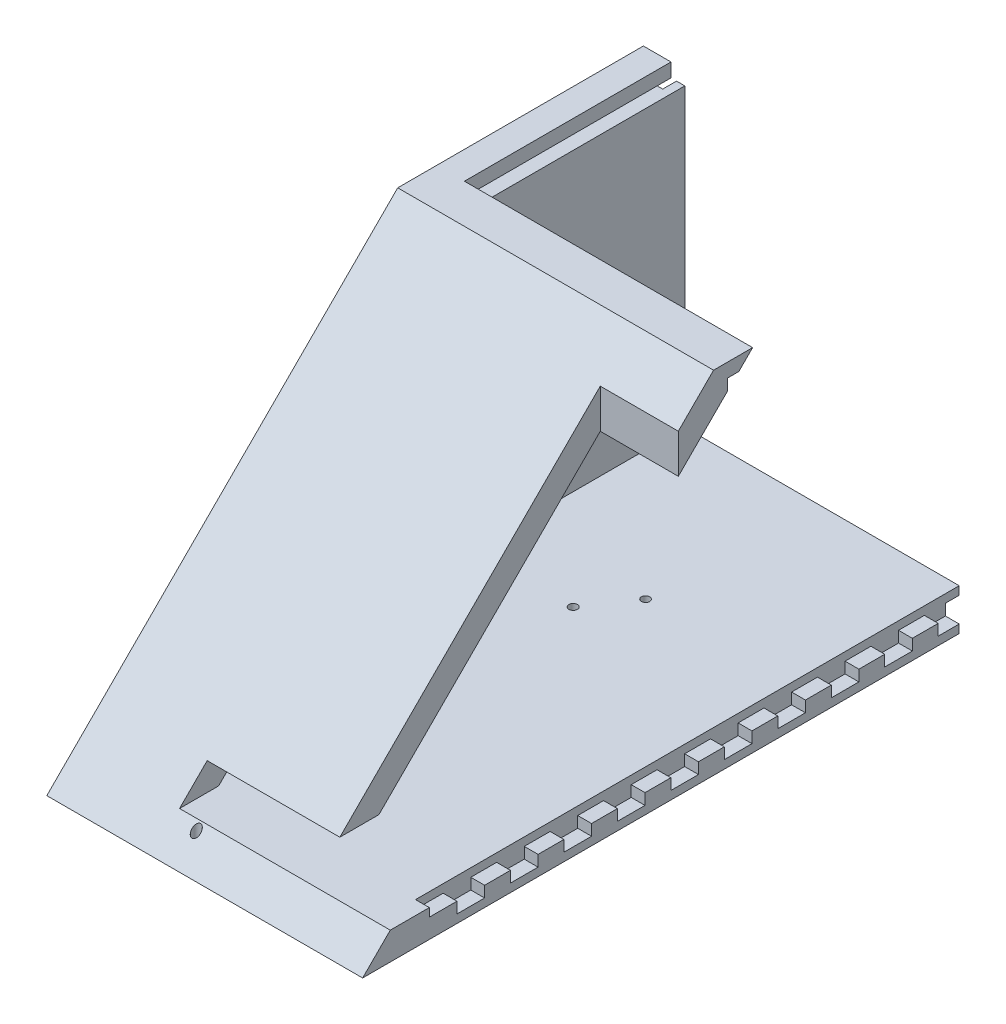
ISO-10303-21;
HEADER;
FILE_DESCRIPTION(('STEP AP214'),'2;1');
FILE_NAME('part.step','',(''),(''),'','','');
FILE_SCHEMA(('AUTOMOTIVE_DESIGN { 1 0 10303 214 1 1 1 1 }'));
ENDSEC;
DATA;
#1=APPLICATION_CONTEXT('core data for automotive mechanical design processes');
#2=APPLICATION_PROTOCOL_DEFINITION('international standard','automotive_design',2000,#1);
#3=PRODUCT_CONTEXT('',#1,'mechanical');
#4=PRODUCT('Part','Part','',(#3));
#5=PRODUCT_RELATED_PRODUCT_CATEGORY('part','',(#4));
#6=PRODUCT_DEFINITION_FORMATION('','',#4);
#7=PRODUCT_DEFINITION_CONTEXT('part definition',#1,'design');
#8=PRODUCT_DEFINITION('design','',#6,#7);
#9=PRODUCT_DEFINITION_SHAPE('','',#8);
#10=(LENGTH_UNIT() NAMED_UNIT(*) SI_UNIT(.MILLI.,.METRE.));
#11=(NAMED_UNIT(*) PLANE_ANGLE_UNIT() SI_UNIT($,.RADIAN.));
#12=(NAMED_UNIT(*) SI_UNIT($,.STERADIAN.) SOLID_ANGLE_UNIT());
#13=UNCERTAINTY_MEASURE_WITH_UNIT(LENGTH_MEASURE(1.E-05),#10,'distance_accuracy_value','');
#14=(GEOMETRIC_REPRESENTATION_CONTEXT(3) GLOBAL_UNCERTAINTY_ASSIGNED_CONTEXT((#13)) GLOBAL_UNIT_ASSIGNED_CONTEXT((#10,
#11,#12)) REPRESENTATION_CONTEXT('',''));
#15=CARTESIAN_POINT('',(0.,0.,0.));
#16=DIRECTION('',(0.,0.,1.));
#17=DIRECTION('',(1.,0.,0.));
#18=AXIS2_PLACEMENT_3D('',#15,#16,#17);
#19=CARTESIAN_POINT('',(0.,0.,-215.9));
#20=DIRECTION('',(0.,0.,1.));
#21=DIRECTION('',(1.,0.,0.));
#22=AXIS2_PLACEMENT_3D('',#19,#20,#21);
#23=PLANE('',#22);
#24=DIRECTION('',(-1.,0.,0.));
#25=VECTOR('',#24,1.);
#26=CARTESIAN_POINT('',(-107.3,97.,-215.9));
#27=LINE('',#26,#25);
#28=CARTESIAN_POINT('',(-107.3,97.,-215.9));
#29=VERTEX_POINT('',#28);
#30=CARTESIAN_POINT('',(-111.3,97.,-215.9));
#31=VERTEX_POINT('',#30);
#32=EDGE_CURVE('E703',#29,#31,#27,.T.);
#33=ORIENTED_EDGE('',*,*,#32,.F.);
#34=DIRECTION('',(0.,1.,0.));
#35=VECTOR('',#34,1.);
#36=CARTESIAN_POINT('',(-107.3,117.,-215.9));
#37=LINE('',#36,#35);
#38=CARTESIAN_POINT('',(-107.3,87.75,-215.9));
#39=VERTEX_POINT('',#38);
#40=EDGE_CURVE('E717',#39,#29,#37,.T.);
#41=ORIENTED_EDGE('',*,*,#40,.F.);
#42=DIRECTION('',(1.,0.,0.));
#43=VECTOR('',#42,1.);
#44=CARTESIAN_POINT('',(-107.3,87.75,-215.9));
#45=LINE('',#44,#43);
#46=CARTESIAN_POINT('',(-111.3,87.75,-215.9));
#47=VERTEX_POINT('',#46);
#48=EDGE_CURVE('E2020',#47,#39,#45,.T.);
#49=ORIENTED_EDGE('',*,*,#48,.F.);
#50=DIRECTION('',(0.,1.,0.));
#51=VECTOR('',#50,1.);
#52=CARTESIAN_POINT('',(-111.3,77.75,-215.9));
#53=LINE('',#52,#51);
#54=CARTESIAN_POINT('',(-111.3,77.75,-215.9));
#55=VERTEX_POINT('',#54);
#56=EDGE_CURVE('E1983',#55,#47,#53,.T.);
#57=ORIENTED_EDGE('',*,*,#56,.F.);
#58=DIRECTION('',(-1.,0.,0.));
#59=VECTOR('',#58,1.);
#60=CARTESIAN_POINT('',(-107.3,77.75,-215.9));
#61=LINE('',#60,#59);
#62=CARTESIAN_POINT('',(-107.3,77.75,-215.9));
#63=VERTEX_POINT('',#62);
#64=EDGE_CURVE('E1975',#63,#55,#61,.T.);
#65=ORIENTED_EDGE('',*,*,#64,.F.);
#66=CARTESIAN_POINT('',(-107.3,68.5,-215.9));
#67=VERTEX_POINT('',#66);
#68=EDGE_CURVE('E725',#67,#63,#37,.T.);
#69=ORIENTED_EDGE('',*,*,#68,.F.);
#70=DIRECTION('',(1.,0.,0.));
#71=VECTOR('',#70,1.);
#72=CARTESIAN_POINT('',(-107.3,68.5,-215.9));
#73=LINE('',#72,#71);
#74=CARTESIAN_POINT('',(-111.3,68.5,-215.9));
#75=VERTEX_POINT('',#74);
#76=EDGE_CURVE('E1660',#75,#67,#73,.T.);
#77=ORIENTED_EDGE('',*,*,#76,.F.);
#78=DIRECTION('',(0.,1.,0.));
#79=VECTOR('',#78,1.);
#80=CARTESIAN_POINT('',(-111.3,58.5,-215.9));
#81=LINE('',#80,#79);
#82=CARTESIAN_POINT('',(-111.3,58.5,-215.9));
#83=VERTEX_POINT('',#82);
#84=EDGE_CURVE('E1650',#83,#75,#81,.T.);
#85=ORIENTED_EDGE('',*,*,#84,.F.);
#86=DIRECTION('',(-1.,0.,0.));
#87=VECTOR('',#86,1.);
#88=CARTESIAN_POINT('',(-107.3,58.5,-215.9));
#89=LINE('',#88,#87);
#90=CARTESIAN_POINT('',(-107.3,58.5,-215.9));
#91=VERTEX_POINT('',#90);
#92=EDGE_CURVE('E1648',#91,#83,#89,.T.);
#93=ORIENTED_EDGE('',*,*,#92,.F.);
#94=CARTESIAN_POINT('',(-107.3,49.25,-215.9));
#95=VERTEX_POINT('',#94);
#96=EDGE_CURVE('E731',#95,#91,#37,.T.);
#97=ORIENTED_EDGE('',*,*,#96,.F.);
#98=DIRECTION('',(1.,0.,0.));
#99=VECTOR('',#98,1.);
#100=CARTESIAN_POINT('',(-107.3,49.25,-215.9));
#101=LINE('',#100,#99);
#102=CARTESIAN_POINT('',(-111.3,49.25,-215.9));
#103=VERTEX_POINT('',#102);
#104=EDGE_CURVE('E1645',#103,#95,#101,.T.);
#105=ORIENTED_EDGE('',*,*,#104,.F.);
#106=DIRECTION('',(0.,1.,0.));
#107=VECTOR('',#106,1.);
#108=CARTESIAN_POINT('',(-111.3,39.25,-215.9));
#109=LINE('',#108,#107);
#110=CARTESIAN_POINT('',(-111.3,39.25,-215.9));
#111=VERTEX_POINT('',#110);
#112=EDGE_CURVE('E1686',#111,#103,#109,.T.);
#113=ORIENTED_EDGE('',*,*,#112,.F.);
#114=DIRECTION('',(-1.,0.,0.));
#115=VECTOR('',#114,1.);
#116=CARTESIAN_POINT('',(-107.3,39.25,-215.9));
#117=LINE('',#116,#115);
#118=CARTESIAN_POINT('',(-107.3,39.25,-215.9));
#119=VERTEX_POINT('',#118);
#120=EDGE_CURVE('E1690',#119,#111,#117,.T.);
#121=ORIENTED_EDGE('',*,*,#120,.F.);
#122=CARTESIAN_POINT('',(-107.3,30.,-215.9));
#123=VERTEX_POINT('',#122);
#124=EDGE_CURVE('E739',#123,#119,#37,.T.);
#125=ORIENTED_EDGE('',*,*,#124,.F.);
#126=DIRECTION('',(1.,0.,0.));
#127=VECTOR('',#126,1.);
#128=CARTESIAN_POINT('',(-107.3,30.,-215.9));
#129=LINE('',#128,#127);
#130=CARTESIAN_POINT('',(-111.3,30.,-215.9));
#131=VERTEX_POINT('',#130);
#132=EDGE_CURVE('E1823',#131,#123,#129,.T.);
#133=ORIENTED_EDGE('',*,*,#132,.F.);
#134=DIRECTION('',(0.,1.,0.));
#135=VECTOR('',#134,1.);
#136=CARTESIAN_POINT('',(-111.3,20.,-215.9));
#137=LINE('',#136,#135);
#138=CARTESIAN_POINT('',(-111.3,20.,-215.9));
#139=VERTEX_POINT('',#138);
#140=EDGE_CURVE('E1826',#139,#131,#137,.T.);
#141=ORIENTED_EDGE('',*,*,#140,.F.);
#142=DIRECTION('',(-1.,0.,0.));
#143=VECTOR('',#142,1.);
#144=CARTESIAN_POINT('',(-107.3,20.,-215.9));
#145=LINE('',#144,#143);
#146=CARTESIAN_POINT('',(-107.3,20.,-215.9));
#147=VERTEX_POINT('',#146);
#148=EDGE_CURVE('E1830',#147,#139,#145,.T.);
#149=ORIENTED_EDGE('',*,*,#148,.F.);
#150=CARTESIAN_POINT('',(-107.3,7.,-215.9));
#151=VERTEX_POINT('',#150);
#152=EDGE_CURVE('E733',#151,#147,#37,.T.);
#153=ORIENTED_EDGE('',*,*,#152,.F.);
#154=DIRECTION('',(-1.,0.,0.));
#155=VECTOR('',#154,1.);
#156=CARTESIAN_POINT('',(-5.,7.,-215.9));
#157=LINE('',#156,#155);
#158=CARTESIAN_POINT('',(-94.3,7.,-215.9));
#159=VERTEX_POINT('',#158);
#160=EDGE_CURVE('E1875',#159,#151,#157,.T.);
#161=ORIENTED_EDGE('',*,*,#160,.F.);
#162=DIRECTION('',(0.,1.,0.));
#163=VECTOR('',#162,1.);
#164=CARTESIAN_POINT('',(-94.3,7.,-215.9));
#165=LINE('',#164,#163);
#166=CARTESIAN_POINT('',(-94.3,3.,-215.9));
#167=VERTEX_POINT('',#166);
#168=EDGE_CURVE('E1833',#167,#159,#165,.T.);
#169=ORIENTED_EDGE('',*,*,#168,.F.);
#170=DIRECTION('',(-1.,0.,0.));
#171=VECTOR('',#170,1.);
#172=CARTESIAN_POINT('',(-94.3,3.,-215.9));
#173=LINE('',#172,#171);
#174=CARTESIAN_POINT('',(-84.3,3.,-215.9));
#175=VERTEX_POINT('',#174);
#176=EDGE_CURVE('E1847',#175,#167,#173,.T.);
#177=ORIENTED_EDGE('',*,*,#176,.F.);
#178=DIRECTION('',(0.,-1.,0.));
#179=VECTOR('',#178,1.);
#180=CARTESIAN_POINT('',(-84.3,7.,-215.9));
#181=LINE('',#180,#179);
#182=CARTESIAN_POINT('',(-84.3,7.,-215.9));
#183=VERTEX_POINT('',#182);
#184=EDGE_CURVE('E1856',#183,#175,#181,.T.);
#185=ORIENTED_EDGE('',*,*,#184,.F.);
#186=CARTESIAN_POINT('',(-71.2,6.99999999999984,-215.9));
#187=VERTEX_POINT('',#186);
#188=EDGE_CURVE('E1880',#187,#183,#157,.T.);
#189=ORIENTED_EDGE('',*,*,#188,.F.);
#190=DIRECTION('',(0.,1.,0.));
#191=VECTOR('',#190,1.);
#192=CARTESIAN_POINT('',(-71.2,6.99999999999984,-215.9));
#193=LINE('',#192,#191);
#194=CARTESIAN_POINT('',(-71.2,2.99999999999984,-215.9));
#195=VERTEX_POINT('',#194);
#196=EDGE_CURVE('E1789',#195,#187,#193,.T.);
#197=ORIENTED_EDGE('',*,*,#196,.F.);
#198=DIRECTION('',(-1.,0.,0.));
#199=VECTOR('',#198,1.);
#200=CARTESIAN_POINT('',(-71.2,2.99999999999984,-215.9));
#201=LINE('',#200,#199);
#202=CARTESIAN_POINT('',(-61.2,2.99999999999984,-215.9));
#203=VERTEX_POINT('',#202);
#204=EDGE_CURVE('E1792',#203,#195,#201,.T.);
#205=ORIENTED_EDGE('',*,*,#204,.F.);
#206=DIRECTION('',(0.,-1.,0.));
#207=VECTOR('',#206,1.);
#208=CARTESIAN_POINT('',(-61.2,6.99999999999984,-215.9));
#209=LINE('',#208,#207);
#210=CARTESIAN_POINT('',(-61.2,6.99999999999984,-215.9));
#211=VERTEX_POINT('',#210);
#212=EDGE_CURVE('E1796',#211,#203,#209,.T.);
#213=ORIENTED_EDGE('',*,*,#212,.F.);
#214=CARTESIAN_POINT('',(-48.1,6.99999999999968,-215.9));
#215=VERTEX_POINT('',#214);
#216=EDGE_CURVE('E1884',#215,#211,#157,.T.);
#217=ORIENTED_EDGE('',*,*,#216,.F.);
#218=DIRECTION('',(0.,1.,0.));
#219=VECTOR('',#218,1.);
#220=CARTESIAN_POINT('',(-48.1,6.99999999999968,-215.9));
#221=LINE('',#220,#219);
#222=CARTESIAN_POINT('',(-48.1,2.99999999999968,-215.9));
#223=VERTEX_POINT('',#222);
#224=EDGE_CURVE('E1754',#223,#215,#221,.T.);
#225=ORIENTED_EDGE('',*,*,#224,.F.);
#226=DIRECTION('',(-1.,0.,0.));
#227=VECTOR('',#226,1.);
#228=CARTESIAN_POINT('',(-48.1,2.99999999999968,-215.9));
#229=LINE('',#228,#227);
#230=CARTESIAN_POINT('',(-38.1,2.99999999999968,-215.9));
#231=VERTEX_POINT('',#230);
#232=EDGE_CURVE('E1757',#231,#223,#229,.T.);
#233=ORIENTED_EDGE('',*,*,#232,.F.);
#234=DIRECTION('',(0.,-1.,0.));
#235=VECTOR('',#234,1.);
#236=CARTESIAN_POINT('',(-38.1,6.99999999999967,-215.9));
#237=LINE('',#236,#235);
#238=CARTESIAN_POINT('',(-38.1,6.99999999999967,-215.9));
#239=VERTEX_POINT('',#238);
#240=EDGE_CURVE('E1761',#239,#231,#237,.T.);
#241=ORIENTED_EDGE('',*,*,#240,.F.);
#242=CARTESIAN_POINT('',(-25.,6.99999999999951,-215.9));
#243=VERTEX_POINT('',#242);
#244=EDGE_CURVE('E1887',#243,#239,#157,.T.);
#245=ORIENTED_EDGE('',*,*,#244,.F.);
#246=DIRECTION('',(0.,1.,0.));
#247=VECTOR('',#246,1.);
#248=CARTESIAN_POINT('',(-25.,6.99999999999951,-215.9));
#249=LINE('',#248,#247);
#250=CARTESIAN_POINT('',(-25.,2.99999999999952,-215.9));
#251=VERTEX_POINT('',#250);
#252=EDGE_CURVE('E1719',#251,#243,#249,.T.);
#253=ORIENTED_EDGE('',*,*,#252,.F.);
#254=DIRECTION('',(-1.,0.,0.));
#255=VECTOR('',#254,1.);
#256=CARTESIAN_POINT('',(-25.,2.99999999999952,-215.9));
#257=LINE('',#256,#255);
#258=CARTESIAN_POINT('',(-15.,2.99999999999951,-215.9));
#259=VERTEX_POINT('',#258);
#260=EDGE_CURVE('E1722',#259,#251,#257,.T.);
#261=ORIENTED_EDGE('',*,*,#260,.F.);
#262=DIRECTION('',(0.,-1.,0.));
#263=VECTOR('',#262,1.);
#264=CARTESIAN_POINT('',(-15.,6.99999999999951,-215.9));
#265=LINE('',#264,#263);
#266=CARTESIAN_POINT('',(-15.,6.99999999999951,-215.9));
#267=VERTEX_POINT('',#266);
#268=EDGE_CURVE('E1726',#267,#259,#265,.T.);
#269=ORIENTED_EDGE('',*,*,#268,.F.);
#270=CARTESIAN_POINT('',(-5.,7.,-215.9));
#271=VERTEX_POINT('',#270);
#272=EDGE_CURVE('E732',#271,#267,#157,.T.);
#273=ORIENTED_EDGE('',*,*,#272,.F.);
#274=DIRECTION('',(0.,-1.,0.));
#275=VECTOR('',#274,1.);
#276=CARTESIAN_POINT('',(-5.,0.,-215.9));
#277=LINE('',#276,#275);
#278=CARTESIAN_POINT('',(-5.,2.99999999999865,-215.9));
#279=VERTEX_POINT('',#278);
#280=EDGE_CURVE('E766',#271,#279,#277,.T.);
#281=ORIENTED_EDGE('',*,*,#280,.T.);
#282=DIRECTION('',(-1.,0.,0.));
#283=VECTOR('',#282,1.);
#284=CARTESIAN_POINT('',(-5.,2.99999999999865,-215.9));
#285=LINE('',#284,#283);
#286=CARTESIAN_POINT('',(0.,2.99999999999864,-215.9));
#287=VERTEX_POINT('',#286);
#288=EDGE_CURVE('E11',#287,#279,#285,.T.);
#289=ORIENTED_EDGE('',*,*,#288,.F.);
#290=DIRECTION('',(0.,1.,0.));
#291=VECTOR('',#290,1.);
#292=CARTESIAN_POINT('',(0.,127.,-215.9));
#293=LINE('',#292,#291);
#294=CARTESIAN_POINT('',(0.,0.,-215.9));
#295=VERTEX_POINT('',#294);
#296=EDGE_CURVE('E758',#295,#287,#293,.T.);
#297=ORIENTED_EDGE('',*,*,#296,.F.);
#298=DIRECTION('',(1.,0.,0.));
#299=VECTOR('',#298,1.);
#300=CARTESIAN_POINT('',(114.3,0.,-215.9));
#301=LINE('',#300,#299);
#302=CARTESIAN_POINT('',(-114.3,0.,-215.9));
#303=VERTEX_POINT('',#302);
#304=EDGE_CURVE('E782',#303,#295,#301,.T.);
#305=ORIENTED_EDGE('',*,*,#304,.F.);
#306=DIRECTION('',(0.,-1.,0.));
#307=VECTOR('',#306,1.);
#308=CARTESIAN_POINT('',(-114.3,127.,-215.9));
#309=LINE('',#308,#307);
#310=CARTESIAN_POINT('',(-114.3,127.,-215.9));
#311=VERTEX_POINT('',#310);
#312=EDGE_CURVE('E754',#311,#303,#309,.T.);
#313=ORIENTED_EDGE('',*,*,#312,.F.);
#314=DIRECTION('',(-1.,0.,0.));
#315=VECTOR('',#314,1.);
#316=CARTESIAN_POINT('',(-114.3,127.,-215.9));
#317=LINE('',#316,#315);
#318=CARTESIAN_POINT('',(-104.3,127.,-215.9));
#319=VERTEX_POINT('',#318);
#320=EDGE_CURVE('E762',#319,#311,#317,.T.);
#321=ORIENTED_EDGE('',*,*,#320,.F.);
#322=DIRECTION('',(0.,-1.,0.));
#323=VECTOR('',#322,1.);
#324=CARTESIAN_POINT('',(-104.3,0.,-215.9));
#325=LINE('',#324,#323);
#326=CARTESIAN_POINT('',(-104.3,122.,-215.9));
#327=VERTEX_POINT('',#326);
#328=EDGE_CURVE('E779',#319,#327,#325,.T.);
#329=ORIENTED_EDGE('',*,*,#328,.T.);
#330=DIRECTION('',(-1.,0.,0.));
#331=VECTOR('',#330,1.);
#332=CARTESIAN_POINT('',(-104.3,122.,-215.9));
#333=LINE('',#332,#331);
#334=CARTESIAN_POINT('',(-109.3,122.,-215.9));
#335=VERTEX_POINT('',#334);
#336=EDGE_CURVE('E776',#327,#335,#333,.T.);
#337=ORIENTED_EDGE('',*,*,#336,.T.);
#338=DIRECTION('',(0.,-1.,0.));
#339=VECTOR('',#338,1.);
#340=CARTESIAN_POINT('',(-109.3,122.,-215.9));
#341=LINE('',#340,#339);
#342=CARTESIAN_POINT('',(-109.3,117.,-215.9));
#343=VERTEX_POINT('',#342);
#344=EDGE_CURVE('E772',#335,#343,#341,.T.);
#345=ORIENTED_EDGE('',*,*,#344,.T.);
#346=DIRECTION('',(-1.,0.,0.));
#347=VECTOR('',#346,1.);
#348=CARTESIAN_POINT('',(109.3,117.,-215.9));
#349=LINE('',#348,#347);
#350=CARTESIAN_POINT('',(-107.3,117.,-215.9));
#351=VERTEX_POINT('',#350);
#352=EDGE_CURVE('E769',#351,#343,#349,.T.);
#353=ORIENTED_EDGE('',*,*,#352,.F.);
#354=CARTESIAN_POINT('',(-107.3,107.,-215.9));
#355=VERTEX_POINT('',#354);
#356=EDGE_CURVE('E726',#355,#351,#37,.T.);
#357=ORIENTED_EDGE('',*,*,#356,.F.);
#358=DIRECTION('',(1.,0.,0.));
#359=VECTOR('',#358,1.);
#360=CARTESIAN_POINT('',(-107.3,107.,-215.9));
#361=LINE('',#360,#359);
#362=CARTESIAN_POINT('',(-111.3,107.,-215.9));
#363=VERTEX_POINT('',#362);
#364=EDGE_CURVE('E2283',#363,#355,#361,.T.);
#365=ORIENTED_EDGE('',*,*,#364,.F.);
#366=DIRECTION('',(0.,1.,0.));
#367=VECTOR('',#366,1.);
#368=CARTESIAN_POINT('',(-111.3,97.,-215.9));
#369=LINE('',#368,#367);
#370=EDGE_CURVE('E719',#31,#363,#369,.T.);
#371=ORIENTED_EDGE('',*,*,#370,.F.);
#372=EDGE_LOOP('',(#33,#41,#49,#57,#65,#69,#77,#85,#93,#97,#105,#113,#121,#125,#133,#141,#149,
#153,#161,#169,#177,#185,#189,#197,#205,#213,#217,#225,#233,#241,#245,#253,#261,#269,#273,#281,
#289,#297,#305,#313,#321,#329,#337,#345,#353,#357,#365,#371));
#373=FACE_BOUND('',#372,.T.);
#374=ADVANCED_FACE('F46',(#373),#23,.F.);
#375=CARTESIAN_POINT('',(-107.3,117.,-220.9));
#376=DIRECTION('',(1.,0.,0.));
#377=DIRECTION('',(0.,1.,0.));
#378=AXIS2_PLACEMENT_3D('',#375,#376,#377);
#379=PLANE('',#378);
#380=DIRECTION('',(0.,0.,1.));
#381=VECTOR('',#380,1.);
#382=CARTESIAN_POINT('',(-107.3,97.,-220.9));
#383=LINE('',#382,#381);
#384=CARTESIAN_POINT('',(-107.3,97.,-220.9));
#385=VERTEX_POINT('',#384);
#386=EDGE_CURVE('E699',#385,#29,#383,.T.);
#387=ORIENTED_EDGE('',*,*,#386,.F.);
#388=DIRECTION('',(0.,1.,0.));
#389=VECTOR('',#388,1.);
#390=CARTESIAN_POINT('',(-107.3,117.,-220.9));
#391=LINE('',#390,#389);
#392=CARTESIAN_POINT('',(-107.3,87.75,-220.9));
#393=VERTEX_POINT('',#392);
#394=EDGE_CURVE('E1613',#393,#385,#391,.T.);
#395=ORIENTED_EDGE('',*,*,#394,.F.);
#396=DIRECTION('',(0.,0.,1.));
#397=VECTOR('',#396,1.);
#398=CARTESIAN_POINT('',(-107.3,87.75,-220.9));
#399=LINE('',#398,#397);
#400=EDGE_CURVE('E70',#393,#39,#399,.T.);
#401=ORIENTED_EDGE('',*,*,#400,.T.);
#402=ORIENTED_EDGE('',*,*,#40,.T.);
#403=EDGE_LOOP('',(#387,#395,#401,#402));
#404=FACE_BOUND('',#403,.T.);
#405=ADVANCED_FACE('F723',(#404),#379,.F.);
#406=DIRECTION('',(0.,0.,1.));
#407=VECTOR('',#406,1.);
#408=CARTESIAN_POINT('',(-107.3,107.,-220.9));
#409=LINE('',#408,#407);
#410=CARTESIAN_POINT('',(-107.3,107.,-220.9));
#411=VERTEX_POINT('',#410);
#412=EDGE_CURVE('E62',#411,#355,#409,.T.);
#413=ORIENTED_EDGE('',*,*,#412,.T.);
#414=ORIENTED_EDGE('',*,*,#356,.T.);
#415=DIRECTION('',(0.,0.,1.));
#416=VECTOR('',#415,1.);
#417=CARTESIAN_POINT('',(-107.3,117.,-220.9));
#418=LINE('',#417,#416);
#419=CARTESIAN_POINT('',(-107.3,117.,-220.9));
#420=VERTEX_POINT('',#419);
#421=EDGE_CURVE('E741',#420,#351,#418,.T.);
#422=ORIENTED_EDGE('',*,*,#421,.F.);
#423=EDGE_CURVE('E1604',#411,#420,#391,.T.);
#424=ORIENTED_EDGE('',*,*,#423,.F.);
#425=EDGE_LOOP('',(#413,#414,#422,#424));
#426=FACE_BOUND('',#425,.T.);
#427=ADVANCED_FACE('F2048',(#426),#379,.F.);
#428=DIRECTION('',(0.,0.,1.));
#429=VECTOR('',#428,1.);
#430=CARTESIAN_POINT('',(-107.3,77.75,-220.9));
#431=LINE('',#430,#429);
#432=CARTESIAN_POINT('',(-107.3,77.75,-220.9));
#433=VERTEX_POINT('',#432);
#434=EDGE_CURVE('E2007',#433,#63,#431,.T.);
#435=ORIENTED_EDGE('',*,*,#434,.F.);
#436=CARTESIAN_POINT('',(-107.3,68.5,-220.9));
#437=VERTEX_POINT('',#436);
#438=EDGE_CURVE('E1610',#437,#433,#391,.T.);
#439=ORIENTED_EDGE('',*,*,#438,.F.);
#440=DIRECTION('',(0.,0.,1.));
#441=VECTOR('',#440,1.);
#442=CARTESIAN_POINT('',(-107.3,68.5,-220.9));
#443=LINE('',#442,#441);
#444=EDGE_CURVE('E1980',#437,#67,#443,.T.);
#445=ORIENTED_EDGE('',*,*,#444,.T.);
#446=ORIENTED_EDGE('',*,*,#68,.T.);
#447=EDGE_LOOP('',(#435,#439,#445,#446));
#448=FACE_BOUND('',#447,.T.);
#449=ADVANCED_FACE('F2001',(#448),#379,.F.);
#450=DIRECTION('',(0.,0.,1.));
#451=VECTOR('',#450,1.);
#452=CARTESIAN_POINT('',(-107.3,58.5,-220.9));
#453=LINE('',#452,#451);
#454=CARTESIAN_POINT('',(-107.3,58.5,-220.9));
#455=VERTEX_POINT('',#454);
#456=EDGE_CURVE('E1640',#455,#91,#453,.T.);
#457=ORIENTED_EDGE('',*,*,#456,.F.);
#458=CARTESIAN_POINT('',(-107.3,49.25,-220.9));
#459=VERTEX_POINT('',#458);
#460=EDGE_CURVE('E1607',#459,#455,#391,.T.);
#461=ORIENTED_EDGE('',*,*,#460,.F.);
#462=DIRECTION('',(0.,0.,1.));
#463=VECTOR('',#462,1.);
#464=CARTESIAN_POINT('',(-107.3,49.25,-220.9));
#465=LINE('',#464,#463);
#466=EDGE_CURVE('E1641',#459,#95,#465,.T.);
#467=ORIENTED_EDGE('',*,*,#466,.T.);
#468=ORIENTED_EDGE('',*,*,#96,.T.);
#469=EDGE_LOOP('',(#457,#461,#467,#468));
#470=FACE_BOUND('',#469,.T.);
#471=ADVANCED_FACE('F1638',(#470),#379,.F.);
#472=DIRECTION('',(0.,0.,1.));
#473=VECTOR('',#472,1.);
#474=CARTESIAN_POINT('',(-107.3,39.25,-220.9));
#475=LINE('',#474,#473);
#476=CARTESIAN_POINT('',(-107.3,39.25,-220.9));
#477=VERTEX_POINT('',#476);
#478=EDGE_CURVE('E1680',#477,#119,#475,.T.);
#479=ORIENTED_EDGE('',*,*,#478,.F.);
#480=CARTESIAN_POINT('',(-107.3,30.,-220.9));
#481=VERTEX_POINT('',#480);
#482=EDGE_CURVE('E1602',#481,#477,#391,.T.);
#483=ORIENTED_EDGE('',*,*,#482,.F.);
#484=DIRECTION('',(0.,0.,1.));
#485=VECTOR('',#484,1.);
#486=CARTESIAN_POINT('',(-107.3,30.,-220.9));
#487=LINE('',#486,#485);
#488=EDGE_CURVE('E1818',#481,#123,#487,.T.);
#489=ORIENTED_EDGE('',*,*,#488,.T.);
#490=ORIENTED_EDGE('',*,*,#124,.T.);
#491=EDGE_LOOP('',(#479,#483,#489,#490));
#492=FACE_BOUND('',#491,.T.);
#493=ADVANCED_FACE('F1957',(#492),#379,.F.);
#494=CARTESIAN_POINT('',(-5.,7.,-220.9));
#495=DIRECTION('',(0.,1.,0.));
#496=DIRECTION('',(0.,0.,1.));
#497=AXIS2_PLACEMENT_3D('',#494,#495,#496);
#498=PLANE('',#497);
#499=DIRECTION('',(0.,0.,1.));
#500=VECTOR('',#499,1.);
#501=CARTESIAN_POINT('',(-15.,6.99999999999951,-220.9));
#502=LINE('',#501,#500);
#503=CARTESIAN_POINT('',(-15.,6.99999999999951,-220.9));
#504=VERTEX_POINT('',#503);
#505=EDGE_CURVE('E1694',#504,#267,#502,.T.);
#506=ORIENTED_EDGE('',*,*,#505,.F.);
#507=DIRECTION('',(-1.,0.,0.));
#508=VECTOR('',#507,1.);
#509=CARTESIAN_POINT('',(-5.,7.,-220.9));
#510=LINE('',#509,#508);
#511=CARTESIAN_POINT('',(-5.,7.,-220.9));
#512=VERTEX_POINT('',#511);
#513=EDGE_CURVE('E1616',#512,#504,#510,.T.);
#514=ORIENTED_EDGE('',*,*,#513,.F.);
#515=DIRECTION('',(0.,0.,1.));
#516=VECTOR('',#515,1.);
#517=CARTESIAN_POINT('',(-5.,7.,-220.9));
#518=LINE('',#517,#516);
#519=EDGE_CURVE('E750',#512,#271,#518,.T.);
#520=ORIENTED_EDGE('',*,*,#519,.T.);
#521=ORIENTED_EDGE('',*,*,#272,.T.);
#522=EDGE_LOOP('',(#506,#514,#520,#521));
#523=FACE_BOUND('',#522,.T.);
#524=ADVANCED_FACE('F2304',(#523),#498,.F.);
#525=DIRECTION('',(0.,0.,1.));
#526=VECTOR('',#525,1.);
#527=CARTESIAN_POINT('',(-25.,6.99999999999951,-220.9));
#528=LINE('',#527,#526);
#529=CARTESIAN_POINT('',(-25.,7.,-220.9));
#530=VERTEX_POINT('',#529);
#531=EDGE_CURVE('E1714',#530,#243,#528,.T.);
#532=ORIENTED_EDGE('',*,*,#531,.T.);
#533=ORIENTED_EDGE('',*,*,#244,.T.);
#534=DIRECTION('',(0.,0.,1.));
#535=VECTOR('',#534,1.);
#536=CARTESIAN_POINT('',(-38.1,6.99999999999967,-220.9));
#537=LINE('',#536,#535);
#538=CARTESIAN_POINT('',(-38.1,6.99999999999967,-220.9));
#539=VERTEX_POINT('',#538);
#540=EDGE_CURVE('E1729',#539,#239,#537,.T.);
#541=ORIENTED_EDGE('',*,*,#540,.F.);
#542=EDGE_CURVE('E1619',#530,#539,#510,.T.);
#543=ORIENTED_EDGE('',*,*,#542,.F.);
#544=EDGE_LOOP('',(#532,#533,#541,#543));
#545=FACE_BOUND('',#544,.T.);
#546=ADVANCED_FACE('F2320',(#545),#498,.F.);
#547=DIRECTION('',(0.,0.,1.));
#548=VECTOR('',#547,1.);
#549=CARTESIAN_POINT('',(-48.1,6.99999999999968,-220.9));
#550=LINE('',#549,#548);
#551=CARTESIAN_POINT('',(-48.1,7.,-220.9));
#552=VERTEX_POINT('',#551);
#553=EDGE_CURVE('E1749',#552,#215,#550,.T.);
#554=ORIENTED_EDGE('',*,*,#553,.T.);
#555=ORIENTED_EDGE('',*,*,#216,.T.);
#556=DIRECTION('',(0.,0.,1.));
#557=VECTOR('',#556,1.);
#558=CARTESIAN_POINT('',(-61.2,6.99999999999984,-220.9));
#559=LINE('',#558,#557);
#560=CARTESIAN_POINT('',(-61.2,6.99999999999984,-220.9));
#561=VERTEX_POINT('',#560);
#562=EDGE_CURVE('E1764',#561,#211,#559,.T.);
#563=ORIENTED_EDGE('',*,*,#562,.F.);
#564=EDGE_CURVE('E1623',#552,#561,#510,.T.);
#565=ORIENTED_EDGE('',*,*,#564,.F.);
#566=EDGE_LOOP('',(#554,#555,#563,#565));
#567=FACE_BOUND('',#566,.T.);
#568=ADVANCED_FACE('F1898',(#567),#498,.F.);
#569=DIRECTION('',(0.,0.,1.));
#570=VECTOR('',#569,1.);
#571=CARTESIAN_POINT('',(-71.2,6.99999999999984,-220.9));
#572=LINE('',#571,#570);
#573=CARTESIAN_POINT('',(-71.2,7.,-220.9));
#574=VERTEX_POINT('',#573);
#575=EDGE_CURVE('E1784',#574,#187,#572,.T.);
#576=ORIENTED_EDGE('',*,*,#575,.T.);
#577=ORIENTED_EDGE('',*,*,#188,.T.);
#578=DIRECTION('',(0.,0.,1.));
#579=VECTOR('',#578,1.);
#580=CARTESIAN_POINT('',(-84.3,7.,-220.9));
#581=LINE('',#580,#579);
#582=CARTESIAN_POINT('',(-84.3,7.,-220.9));
#583=VERTEX_POINT('',#582);
#584=EDGE_CURVE('E1868',#583,#183,#581,.T.);
#585=ORIENTED_EDGE('',*,*,#584,.F.);
#586=EDGE_CURVE('E1625',#574,#583,#510,.T.);
#587=ORIENTED_EDGE('',*,*,#586,.F.);
#588=EDGE_LOOP('',(#576,#577,#585,#587));
#589=FACE_BOUND('',#588,.T.);
#590=ADVANCED_FACE('F1922',(#589),#498,.F.);
#591=DIRECTION('',(0.,0.,1.));
#592=VECTOR('',#591,1.);
#593=CARTESIAN_POINT('',(-107.3,20.,-220.9));
#594=LINE('',#593,#592);
#595=CARTESIAN_POINT('',(-107.3,20.,-220.9));
#596=VERTEX_POINT('',#595);
#597=EDGE_CURVE('E1799',#596,#147,#594,.T.);
#598=ORIENTED_EDGE('',*,*,#597,.F.);
#599=CARTESIAN_POINT('',(-107.3,7.,-220.9));
#600=VERTEX_POINT('',#599);
#601=EDGE_CURVE('E1598',#600,#596,#391,.T.);
#602=ORIENTED_EDGE('',*,*,#601,.F.);
#603=DIRECTION('',(0.,0.,1.));
#604=VECTOR('',#603,1.);
#605=CARTESIAN_POINT('',(-107.3,7.,-220.9));
#606=LINE('',#605,#604);
#607=EDGE_CURVE('E745',#600,#151,#606,.T.);
#608=ORIENTED_EDGE('',*,*,#607,.T.);
#609=ORIENTED_EDGE('',*,*,#152,.T.);
#610=EDGE_LOOP('',(#598,#602,#608,#609));
#611=FACE_BOUND('',#610,.T.);
#612=ADVANCED_FACE('F1940',(#611),#379,.F.);
#613=DIRECTION('',(0.,0.,1.));
#614=VECTOR('',#613,1.);
#615=CARTESIAN_POINT('',(-94.3,7.,-220.9));
#616=LINE('',#615,#614);
#617=CARTESIAN_POINT('',(-94.3,7.,-220.9));
#618=VERTEX_POINT('',#617);
#619=EDGE_CURVE('E1872',#618,#159,#616,.T.);
#620=ORIENTED_EDGE('',*,*,#619,.T.);
#621=ORIENTED_EDGE('',*,*,#160,.T.);
#622=ORIENTED_EDGE('',*,*,#607,.F.);
#623=EDGE_CURVE('E1621',#618,#600,#510,.T.);
#624=ORIENTED_EDGE('',*,*,#623,.F.);
#625=EDGE_LOOP('',(#620,#621,#622,#624));
#626=FACE_BOUND('',#625,.T.);
#627=ADVANCED_FACE('F1936',(#626),#498,.F.);
#628=CARTESIAN_POINT('',(0.,0.,0.));
#629=DIRECTION('',(-1.,0.,0.));
#630=DIRECTION('',(0.,0.,1.));
#631=AXIS2_PLACEMENT_3D('',#628,#629,#630);
#632=PLANE('',#631);
#633=DIRECTION('',(0.,0.,1.));
#634=VECTOR('',#633,1.);
#635=CARTESIAN_POINT('',(0.,0.,0.));
#636=LINE('',#635,#634);
#637=CARTESIAN_POINT('',(0.,0.,0.));
#638=VERTEX_POINT('',#637);
#639=EDGE_CURVE('E1185',#295,#638,#636,.T.);
#640=ORIENTED_EDGE('',*,*,#639,.F.);
#641=ORIENTED_EDGE('',*,*,#296,.T.);
#642=DIRECTION('',(0.,0.,-1.));
#643=VECTOR('',#642,1.);
#644=CARTESIAN_POINT('',(0.,2.99999999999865,-208.295860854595));
#645=LINE('',#644,#643);
#646=CARTESIAN_POINT('',(0.,2.99999999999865,-208.295860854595));
#647=VERTEX_POINT('',#646);
#648=EDGE_CURVE('E1051',#647,#287,#645,.T.);
#649=ORIENTED_EDGE('',*,*,#648,.F.);
#650=DIRECTION('',(0.,-1.,0.));
#651=VECTOR('',#650,1.);
#652=CARTESIAN_POINT('',(0.,6.99999999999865,-208.295860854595));
#653=LINE('',#652,#651);
#654=CARTESIAN_POINT('',(0.,6.99999999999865,-208.295860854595));
#655=VERTEX_POINT('',#654);
#656=EDGE_CURVE('E1047',#655,#647,#653,.T.);
#657=ORIENTED_EDGE('',*,*,#656,.F.);
#658=DIRECTION('',(0.,0.,-1.));
#659=VECTOR('',#658,1.);
#660=CARTESIAN_POINT('',(0.,7.,-24.1421356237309));
#661=LINE('',#660,#659);
#662=CARTESIAN_POINT('',(0.,6.99999999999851,-198.945446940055));
#663=VERTEX_POINT('',#662);
#664=EDGE_CURVE('E1151',#663,#655,#661,.T.);
#665=ORIENTED_EDGE('',*,*,#664,.F.);
#666=DIRECTION('',(0.,-1.,0.));
#667=VECTOR('',#666,1.);
#668=CARTESIAN_POINT('',(0.,6.99999999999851,-198.945446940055));
#669=LINE('',#668,#667);
#670=CARTESIAN_POINT('',(0.,2.99999999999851,-198.945446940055));
#671=VERTEX_POINT('',#670);
#672=EDGE_CURVE('E1043',#663,#671,#669,.T.);
#673=ORIENTED_EDGE('',*,*,#672,.T.);
#674=DIRECTION('',(0.,0.,-1.));
#675=VECTOR('',#674,1.);
#676=CARTESIAN_POINT('',(0.,2.99999999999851,-188.945446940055));
#677=LINE('',#676,#675);
#678=CARTESIAN_POINT('',(0.,2.99999999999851,-188.945446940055));
#679=VERTEX_POINT('',#678);
#680=EDGE_CURVE('E1082',#679,#671,#677,.T.);
#681=ORIENTED_EDGE('',*,*,#680,.F.);
#682=DIRECTION('',(0.,-1.,0.));
#683=VECTOR('',#682,1.);
#684=CARTESIAN_POINT('',(0.,6.99999999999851,-188.945446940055));
#685=LINE('',#684,#683);
#686=CARTESIAN_POINT('',(0.,6.99999999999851,-188.945446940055));
#687=VERTEX_POINT('',#686);
#688=EDGE_CURVE('E1078',#687,#679,#685,.T.);
#689=ORIENTED_EDGE('',*,*,#688,.F.);
#690=CARTESIAN_POINT('',(0.,6.99999999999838,-179.595033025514));
#691=VERTEX_POINT('',#690);
#692=EDGE_CURVE('E1587',#691,#687,#661,.T.);
#693=ORIENTED_EDGE('',*,*,#692,.F.);
#694=DIRECTION('',(0.,-1.,0.));
#695=VECTOR('',#694,1.);
#696=CARTESIAN_POINT('',(0.,6.99999999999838,-179.595033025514));
#697=LINE('',#696,#695);
#698=CARTESIAN_POINT('',(0.,2.99999999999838,-179.595033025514));
#699=VERTEX_POINT('',#698);
#700=EDGE_CURVE('E1068',#691,#699,#697,.T.);
#701=ORIENTED_EDGE('',*,*,#700,.T.);
#702=DIRECTION('',(0.,0.,-1.));
#703=VECTOR('',#702,1.);
#704=CARTESIAN_POINT('',(0.,2.99999999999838,-169.595033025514));
#705=LINE('',#704,#703);
#706=CARTESIAN_POINT('',(0.,2.99999999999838,-169.595033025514));
#707=VERTEX_POINT('',#706);
#708=EDGE_CURVE('E1116',#707,#699,#705,.T.);
#709=ORIENTED_EDGE('',*,*,#708,.F.);
#710=DIRECTION('',(0.,-1.,0.));
#711=VECTOR('',#710,1.);
#712=CARTESIAN_POINT('',(0.,6.99999999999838,-169.595033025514));
#713=LINE('',#712,#711);
#714=CARTESIAN_POINT('',(0.,6.99999999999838,-169.595033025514));
#715=VERTEX_POINT('',#714);
#716=EDGE_CURVE('E1112',#715,#707,#713,.T.);
#717=ORIENTED_EDGE('',*,*,#716,.F.);
#718=CARTESIAN_POINT('',(0.,6.99999999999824,-160.244619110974));
#719=VERTEX_POINT('',#718);
#720=EDGE_CURVE('E1584',#719,#715,#661,.T.);
#721=ORIENTED_EDGE('',*,*,#720,.F.);
#722=DIRECTION('',(0.,-1.,0.));
#723=VECTOR('',#722,1.);
#724=CARTESIAN_POINT('',(0.,6.99999999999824,-160.244619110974));
#725=LINE('',#724,#723);
#726=CARTESIAN_POINT('',(0.,2.99999999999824,-160.244619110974));
#727=VERTEX_POINT('',#726);
#728=EDGE_CURVE('E919',#719,#727,#725,.T.);
#729=ORIENTED_EDGE('',*,*,#728,.T.);
#730=DIRECTION('',(0.,0.,-1.));
#731=VECTOR('',#730,1.);
#732=CARTESIAN_POINT('',(0.,2.99999999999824,-150.244619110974));
#733=LINE('',#732,#731);
#734=CARTESIAN_POINT('',(0.,2.99999999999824,-150.244619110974));
#735=VERTEX_POINT('',#734);
#736=EDGE_CURVE('E914',#735,#727,#733,.T.);
#737=ORIENTED_EDGE('',*,*,#736,.F.);
#738=DIRECTION('',(0.,-1.,0.));
#739=VECTOR('',#738,1.);
#740=CARTESIAN_POINT('',(0.,6.99999999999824,-150.244619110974));
#741=LINE('',#740,#739);
#742=CARTESIAN_POINT('',(0.,6.99999999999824,-150.244619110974));
#743=VERTEX_POINT('',#742);
#744=EDGE_CURVE('E910',#743,#735,#741,.T.);
#745=ORIENTED_EDGE('',*,*,#744,.F.);
#746=CARTESIAN_POINT('',(0.,6.99999999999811,-140.894205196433));
#747=VERTEX_POINT('',#746);
#748=EDGE_CURVE('E1581',#747,#743,#661,.T.);
#749=ORIENTED_EDGE('',*,*,#748,.F.);
#750=DIRECTION('',(0.,-1.,0.));
#751=VECTOR('',#750,1.);
#752=CARTESIAN_POINT('',(0.,6.99999999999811,-140.894205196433));
#753=LINE('',#752,#751);
#754=CARTESIAN_POINT('',(0.,2.99999999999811,-140.894205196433));
#755=VERTEX_POINT('',#754);
#756=EDGE_CURVE('E900',#747,#755,#753,.T.);
#757=ORIENTED_EDGE('',*,*,#756,.T.);
#758=DIRECTION('',(0.,0.,-1.));
#759=VECTOR('',#758,1.);
#760=CARTESIAN_POINT('',(0.,2.99999999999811,-130.894205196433));
#761=LINE('',#760,#759);
#762=CARTESIAN_POINT('',(0.,2.99999999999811,-130.894205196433));
#763=VERTEX_POINT('',#762);
#764=EDGE_CURVE('E952',#763,#755,#761,.T.);
#765=ORIENTED_EDGE('',*,*,#764,.F.);
#766=DIRECTION('',(0.,-1.,0.));
#767=VECTOR('',#766,1.);
#768=CARTESIAN_POINT('',(0.,6.99999999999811,-130.894205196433));
#769=LINE('',#768,#767);
#770=CARTESIAN_POINT('',(0.,6.99999999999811,-130.894205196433));
#771=VERTEX_POINT('',#770);
#772=EDGE_CURVE('E948',#771,#763,#769,.T.);
#773=ORIENTED_EDGE('',*,*,#772,.F.);
#774=CARTESIAN_POINT('',(0.,6.99999999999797,-121.543791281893));
#775=VERTEX_POINT('',#774);
#776=EDGE_CURVE('E1578',#775,#771,#661,.T.);
#777=ORIENTED_EDGE('',*,*,#776,.F.);
#778=DIRECTION('',(0.,-1.,0.));
#779=VECTOR('',#778,1.);
#780=CARTESIAN_POINT('',(0.,6.99999999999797,-121.543791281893));
#781=LINE('',#780,#779);
#782=CARTESIAN_POINT('',(0.,2.99999999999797,-121.543791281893));
#783=VERTEX_POINT('',#782);
#784=EDGE_CURVE('E938',#775,#783,#781,.T.);
#785=ORIENTED_EDGE('',*,*,#784,.T.);
#786=DIRECTION('',(0.,0.,-1.));
#787=VECTOR('',#786,1.);
#788=CARTESIAN_POINT('',(0.,2.99999999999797,-111.543791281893));
#789=LINE('',#788,#787);
#790=CARTESIAN_POINT('',(0.,2.99999999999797,-111.543791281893));
#791=VERTEX_POINT('',#790);
#792=EDGE_CURVE('E988',#791,#783,#789,.T.);
#793=ORIENTED_EDGE('',*,*,#792,.F.);
#794=DIRECTION('',(0.,-1.,0.));
#795=VECTOR('',#794,1.);
#796=CARTESIAN_POINT('',(0.,6.99999999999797,-111.543791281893));
#797=LINE('',#796,#795);
#798=CARTESIAN_POINT('',(0.,6.99999999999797,-111.543791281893));
#799=VERTEX_POINT('',#798);
#800=EDGE_CURVE('E984',#799,#791,#797,.T.);
#801=ORIENTED_EDGE('',*,*,#800,.F.);
#802=CARTESIAN_POINT('',(0.,6.99999999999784,-102.193377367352));
#803=VERTEX_POINT('',#802);
#804=EDGE_CURVE('E1575',#803,#799,#661,.T.);
#805=ORIENTED_EDGE('',*,*,#804,.F.);
#806=DIRECTION('',(0.,-1.,0.));
#807=VECTOR('',#806,1.);
#808=CARTESIAN_POINT('',(0.,6.99999999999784,-102.193377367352));
#809=LINE('',#808,#807);
#810=CARTESIAN_POINT('',(0.,2.99999999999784,-102.193377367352));
#811=VERTEX_POINT('',#810);
#812=EDGE_CURVE('E974',#803,#811,#809,.T.);
#813=ORIENTED_EDGE('',*,*,#812,.T.);
#814=DIRECTION('',(0.,0.,-1.));
#815=VECTOR('',#814,1.);
#816=CARTESIAN_POINT('',(0.,2.99999999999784,-92.1933773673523));
#817=LINE('',#816,#815);
#818=CARTESIAN_POINT('',(0.,2.99999999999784,-92.1933773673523));
#819=VERTEX_POINT('',#818);
#820=EDGE_CURVE('E1022',#819,#811,#817,.T.);
#821=ORIENTED_EDGE('',*,*,#820,.F.);
#822=DIRECTION('',(0.,-1.,0.));
#823=VECTOR('',#822,1.);
#824=CARTESIAN_POINT('',(0.,6.99999999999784,-92.1933773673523));
#825=LINE('',#824,#823);
#826=CARTESIAN_POINT('',(0.,6.99999999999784,-92.1933773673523));
#827=VERTEX_POINT('',#826);
#828=EDGE_CURVE('E1018',#827,#819,#825,.T.);
#829=ORIENTED_EDGE('',*,*,#828,.F.);
#830=CARTESIAN_POINT('',(0.,6.9999999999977,-82.8429634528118));
#831=VERTEX_POINT('',#830);
#832=EDGE_CURVE('E1572',#831,#827,#661,.T.);
#833=ORIENTED_EDGE('',*,*,#832,.F.);
#834=DIRECTION('',(0.,-1.,0.));
#835=VECTOR('',#834,1.);
#836=CARTESIAN_POINT('',(0.,6.9999999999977,-82.8429634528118));
#837=LINE('',#836,#835);
#838=CARTESIAN_POINT('',(0.,2.9999999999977,-82.8429634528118));
#839=VERTEX_POINT('',#838);
#840=EDGE_CURVE('E847',#831,#839,#837,.T.);
#841=ORIENTED_EDGE('',*,*,#840,.T.);
#842=DIRECTION('',(0.,0.,-1.));
#843=VECTOR('',#842,1.);
#844=CARTESIAN_POINT('',(0.,2.9999999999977,-72.8429634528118));
#845=LINE('',#844,#843);
#846=CARTESIAN_POINT('',(0.,2.9999999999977,-72.8429634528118));
#847=VERTEX_POINT('',#846);
#848=EDGE_CURVE('E842',#847,#839,#845,.T.);
#849=ORIENTED_EDGE('',*,*,#848,.F.);
#850=DIRECTION('',(0.,-1.,0.));
#851=VECTOR('',#850,1.);
#852=CARTESIAN_POINT('',(0.,6.9999999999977,-72.8429634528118));
#853=LINE('',#852,#851);
#854=CARTESIAN_POINT('',(0.,6.9999999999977,-72.8429634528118));
#855=VERTEX_POINT('',#854);
#856=EDGE_CURVE('E838',#855,#847,#853,.T.);
#857=ORIENTED_EDGE('',*,*,#856,.F.);
#858=CARTESIAN_POINT('',(0.,6.99999999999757,-63.4925495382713));
#859=VERTEX_POINT('',#858);
#860=EDGE_CURVE('E1569',#859,#855,#661,.T.);
#861=ORIENTED_EDGE('',*,*,#860,.F.);
#862=DIRECTION('',(0.,-1.,0.));
#863=VECTOR('',#862,1.);
#864=CARTESIAN_POINT('',(0.,6.99999999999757,-63.4925495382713));
#865=LINE('',#864,#863);
#866=CARTESIAN_POINT('',(0.,2.99999999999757,-63.4925495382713));
#867=VERTEX_POINT('',#866);
#868=EDGE_CURVE('E828',#859,#867,#865,.T.);
#869=ORIENTED_EDGE('',*,*,#868,.T.);
#870=DIRECTION('',(0.,0.,-1.));
#871=VECTOR('',#870,1.);
#872=CARTESIAN_POINT('',(0.,2.99999999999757,-53.4925495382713));
#873=LINE('',#872,#871);
#874=CARTESIAN_POINT('',(0.,2.99999999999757,-53.4925495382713));
#875=VERTEX_POINT('',#874);
#876=EDGE_CURVE('E878',#875,#867,#873,.T.);
#877=ORIENTED_EDGE('',*,*,#876,.F.);
#878=DIRECTION('',(0.,-1.,0.));
#879=VECTOR('',#878,1.);
#880=CARTESIAN_POINT('',(0.,6.99999999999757,-53.4925495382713));
#881=LINE('',#880,#879);
#882=CARTESIAN_POINT('',(0.,6.99999999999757,-53.4925495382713));
#883=VERTEX_POINT('',#882);
#884=EDGE_CURVE('E874',#883,#875,#881,.T.);
#885=ORIENTED_EDGE('',*,*,#884,.F.);
#886=CARTESIAN_POINT('',(0.,6.99999999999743,-44.1421356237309));
#887=VERTEX_POINT('',#886);
#888=EDGE_CURVE('E1155',#887,#883,#661,.T.);
#889=ORIENTED_EDGE('',*,*,#888,.F.);
#890=DIRECTION('',(0.,-1.,0.));
#891=VECTOR('',#890,1.);
#892=CARTESIAN_POINT('',(0.,6.99999999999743,-44.1421356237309));
#893=LINE('',#892,#891);
#894=CARTESIAN_POINT('',(0.,2.99999999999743,-44.1421356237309));
#895=VERTEX_POINT('',#894);
#896=EDGE_CURVE('E809',#887,#895,#893,.T.);
#897=ORIENTED_EDGE('',*,*,#896,.T.);
#898=DIRECTION('',(0.,0.,-1.));
#899=VECTOR('',#898,1.);
#900=CARTESIAN_POINT('',(0.,2.99999999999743,-34.1421356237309));
#901=LINE('',#900,#899);
#902=CARTESIAN_POINT('',(0.,2.99999999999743,-34.1421356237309));
#903=VERTEX_POINT('',#902);
#904=EDGE_CURVE('E804',#903,#895,#901,.T.);
#905=ORIENTED_EDGE('',*,*,#904,.F.);
#906=DIRECTION('',(0.,-1.,0.));
#907=VECTOR('',#906,1.);
#908=CARTESIAN_POINT('',(0.,6.99999999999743,-34.1421356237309));
#909=LINE('',#908,#907);
#910=CARTESIAN_POINT('',(0.,6.99999999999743,-34.1421356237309));
#911=VERTEX_POINT('',#910);
#912=EDGE_CURVE('E800',#911,#903,#909,.T.);
#913=ORIENTED_EDGE('',*,*,#912,.F.);
#914=CARTESIAN_POINT('',(0.,7.,-24.1421356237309));
#915=VERTEX_POINT('',#914);
#916=EDGE_CURVE('E1137',#915,#911,#661,.T.);
#917=ORIENTED_EDGE('',*,*,#916,.F.);
#918=DIRECTION('',(0.,-1.,0.));
#919=VECTOR('',#918,1.);
#920=CARTESIAN_POINT('',(0.,10.,-24.1421356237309));
#921=LINE('',#920,#919);
#922=CARTESIAN_POINT('',(0.,10.,-24.1421356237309));
#923=VERTEX_POINT('',#922);
#924=EDGE_CURVE('E1056',#923,#915,#921,.T.);
#925=ORIENTED_EDGE('',*,*,#924,.F.);
#926=DIRECTION('',(0.,0.,1.));
#927=VECTOR('',#926,1.);
#928=CARTESIAN_POINT('',(0.,10.,0.));
#929=LINE('',#928,#927);
#930=CARTESIAN_POINT('',(0.,10.,-9.99999999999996));
#931=VERTEX_POINT('',#930);
#932=EDGE_CURVE('E1182',#923,#931,#929,.T.);
#933=ORIENTED_EDGE('',*,*,#932,.T.);
#934=DIRECTION('',(0.,-0.707106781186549,0.707106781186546));
#935=VECTOR('',#934,1.);
#936=CARTESIAN_POINT('',(0.,0.,0.));
#937=LINE('',#936,#935);
#938=EDGE_CURVE('E1172',#931,#638,#937,.T.);
#939=ORIENTED_EDGE('',*,*,#938,.T.);
#940=EDGE_LOOP('',(#640,#641,#649,#657,#665,#673,#681,#689,#693,#701,#709,#717,#721,#729,#737,
#745,#749,#757,#765,#773,#777,#785,#793,#801,#805,#813,#821,#829,#833,#841,#849,#857,#861,#869,
#877,#885,#889,#897,#905,#913,#917,#925,#933,#939));
#941=FACE_BOUND('',#940,.T.);
#942=ADVANCED_FACE('F1536',(#941),#632,.F.);
#943=CARTESIAN_POINT('',(-5.,7.,-24.1421356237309));
#944=DIRECTION('',(0.,-1.,0.));
#945=DIRECTION('',(0.,0.,-1.));
#946=AXIS2_PLACEMENT_3D('',#943,#944,#945);
#947=PLANE('',#946);
#948=ORIENTED_EDGE('',*,*,#664,.T.);
#949=DIRECTION('',(1.,0.,0.));
#950=VECTOR('',#949,1.);
#951=CARTESIAN_POINT('',(-5.,6.99999999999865,-208.295860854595));
#952=LINE('',#951,#950);
#953=CARTESIAN_POINT('',(-5.,6.99999999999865,-208.295860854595));
#954=VERTEX_POINT('',#953);
#955=EDGE_CURVE('E1042',#954,#655,#952,.T.);
#956=ORIENTED_EDGE('',*,*,#955,.F.);
#957=DIRECTION('',(0.,0.,-1.));
#958=VECTOR('',#957,1.);
#959=CARTESIAN_POINT('',(-5.,7.,-24.1421356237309));
#960=LINE('',#959,#958);
#961=CARTESIAN_POINT('',(-5.,7.,-198.945446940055));
#962=VERTEX_POINT('',#961);
#963=EDGE_CURVE('E1141',#962,#954,#960,.T.);
#964=ORIENTED_EDGE('',*,*,#963,.F.);
#965=DIRECTION('',(1.,0.,0.));
#966=VECTOR('',#965,1.);
#967=CARTESIAN_POINT('',(-5.,6.99999999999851,-198.945446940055));
#968=LINE('',#967,#966);
#969=EDGE_CURVE('E1063',#962,#663,#968,.T.);
#970=ORIENTED_EDGE('',*,*,#969,.T.);
#971=EDGE_LOOP('',(#948,#956,#964,#970));
#972=FACE_BOUND('',#971,.T.);
#973=ADVANCED_FACE('F2176',(#972),#947,.F.);
#974=ORIENTED_EDGE('',*,*,#692,.T.);
#975=DIRECTION('',(1.,0.,0.));
#976=VECTOR('',#975,1.);
#977=CARTESIAN_POINT('',(-5.,6.99999999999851,-188.945446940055));
#978=LINE('',#977,#976);
#979=CARTESIAN_POINT('',(-5.,6.99999999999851,-188.945446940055));
#980=VERTEX_POINT('',#979);
#981=EDGE_CURVE('E1074',#980,#687,#978,.T.);
#982=ORIENTED_EDGE('',*,*,#981,.F.);
#983=CARTESIAN_POINT('',(-5.,7.,-179.595033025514));
#984=VERTEX_POINT('',#983);
#985=EDGE_CURVE('E1562',#984,#980,#960,.T.);
#986=ORIENTED_EDGE('',*,*,#985,.F.);
#987=DIRECTION('',(1.,0.,0.));
#988=VECTOR('',#987,1.);
#989=CARTESIAN_POINT('',(-5.,6.99999999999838,-179.595033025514));
#990=LINE('',#989,#988);
#991=EDGE_CURVE('E923',#984,#691,#990,.T.);
#992=ORIENTED_EDGE('',*,*,#991,.T.);
#993=EDGE_LOOP('',(#974,#982,#986,#992));
#994=FACE_BOUND('',#993,.T.);
#995=ADVANCED_FACE('F2793',(#994),#947,.F.);
#996=DIRECTION('',(1.,0.,0.));
#997=VECTOR('',#996,1.);
#998=CARTESIAN_POINT('',(-5.,6.9999999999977,-82.8429634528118));
#999=LINE('',#998,#997);
#1000=CARTESIAN_POINT('',(-5.,7.,-82.8429634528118));
#1001=VERTEX_POINT('',#1000);
#1002=EDGE_CURVE('E823',#1001,#831,#999,.T.);
#1003=ORIENTED_EDGE('',*,*,#1002,.T.);
#1004=ORIENTED_EDGE('',*,*,#832,.T.);
#1005=DIRECTION('',(1.,0.,0.));
#1006=VECTOR('',#1005,1.);
#1007=CARTESIAN_POINT('',(-5.,6.99999999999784,-92.1933773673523));
#1008=LINE('',#1007,#1006);
#1009=CARTESIAN_POINT('',(-5.,6.99999999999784,-92.1933773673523));
#1010=VERTEX_POINT('',#1009);
#1011=EDGE_CURVE('E1014',#1010,#827,#1008,.T.);
#1012=ORIENTED_EDGE('',*,*,#1011,.F.);
#1013=EDGE_CURVE('E1547',#1001,#1010,#960,.T.);
#1014=ORIENTED_EDGE('',*,*,#1013,.F.);
#1015=EDGE_LOOP('',(#1003,#1004,#1012,#1014));
#1016=FACE_BOUND('',#1015,.T.);
#1017=ADVANCED_FACE('F2801',(#1016),#947,.F.);
#1018=ORIENTED_EDGE('',*,*,#860,.T.);
#1019=DIRECTION('',(1.,0.,0.));
#1020=VECTOR('',#1019,1.);
#1021=CARTESIAN_POINT('',(-5.,6.9999999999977,-72.8429634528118));
#1022=LINE('',#1021,#1020);
#1023=CARTESIAN_POINT('',(-5.,6.9999999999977,-72.8429634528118));
#1024=VERTEX_POINT('',#1023);
#1025=EDGE_CURVE('E834',#1024,#855,#1022,.T.);
#1026=ORIENTED_EDGE('',*,*,#1025,.F.);
#1027=CARTESIAN_POINT('',(-5.,7.,-63.4925495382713));
#1028=VERTEX_POINT('',#1027);
#1029=EDGE_CURVE('E1544',#1028,#1024,#960,.T.);
#1030=ORIENTED_EDGE('',*,*,#1029,.F.);
#1031=DIRECTION('',(1.,0.,0.));
#1032=VECTOR('',#1031,1.);
#1033=CARTESIAN_POINT('',(-5.,6.99999999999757,-63.4925495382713));
#1034=LINE('',#1033,#1032);
#1035=EDGE_CURVE('E813',#1028,#859,#1034,.T.);
#1036=ORIENTED_EDGE('',*,*,#1035,.T.);
#1037=EDGE_LOOP('',(#1018,#1026,#1030,#1036));
#1038=FACE_BOUND('',#1037,.T.);
#1039=ADVANCED_FACE('F2809',(#1038),#947,.F.);
#1040=ORIENTED_EDGE('',*,*,#888,.T.);
#1041=DIRECTION('',(1.,0.,0.));
#1042=VECTOR('',#1041,1.);
#1043=CARTESIAN_POINT('',(-5.,6.99999999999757,-53.4925495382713));
#1044=LINE('',#1043,#1042);
#1045=CARTESIAN_POINT('',(-5.,6.99999999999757,-53.4925495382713));
#1046=VERTEX_POINT('',#1045);
#1047=EDGE_CURVE('E870',#1046,#883,#1044,.T.);
#1048=ORIENTED_EDGE('',*,*,#1047,.F.);
#1049=CARTESIAN_POINT('',(-5.,7.,-44.1421356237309));
#1050=VERTEX_POINT('',#1049);
#1051=EDGE_CURVE('E1147',#1050,#1046,#960,.T.);
#1052=ORIENTED_EDGE('',*,*,#1051,.F.);
#1053=DIRECTION('',(1.,0.,0.));
#1054=VECTOR('',#1053,1.);
#1055=CARTESIAN_POINT('',(-5.,6.99999999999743,-44.1421356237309));
#1056=LINE('',#1055,#1054);
#1057=EDGE_CURVE('E786',#1050,#887,#1056,.T.);
#1058=ORIENTED_EDGE('',*,*,#1057,.T.);
#1059=EDGE_LOOP('',(#1040,#1048,#1052,#1058));
#1060=FACE_BOUND('',#1059,.T.);
#1061=ADVANCED_FACE('F2817',(#1060),#947,.F.);
#1062=DIRECTION('',(1.,0.,0.));
#1063=VECTOR('',#1062,1.);
#1064=CARTESIAN_POINT('',(-5.,6.99999999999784,-102.193377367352));
#1065=LINE('',#1064,#1063);
#1066=CARTESIAN_POINT('',(-5.,7.,-102.193377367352));
#1067=VERTEX_POINT('',#1066);
#1068=EDGE_CURVE('E851',#1067,#803,#1065,.T.);
#1069=ORIENTED_EDGE('',*,*,#1068,.T.);
#1070=ORIENTED_EDGE('',*,*,#804,.T.);
#1071=DIRECTION('',(1.,0.,0.));
#1072=VECTOR('',#1071,1.);
#1073=CARTESIAN_POINT('',(-5.,6.99999999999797,-111.543791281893));
#1074=LINE('',#1073,#1072);
#1075=CARTESIAN_POINT('',(-5.,6.99999999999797,-111.543791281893));
#1076=VERTEX_POINT('',#1075);
#1077=EDGE_CURVE('E980',#1076,#799,#1074,.T.);
#1078=ORIENTED_EDGE('',*,*,#1077,.F.);
#1079=EDGE_CURVE('E1550',#1067,#1076,#960,.T.);
#1080=ORIENTED_EDGE('',*,*,#1079,.F.);
#1081=EDGE_LOOP('',(#1069,#1070,#1078,#1080));
#1082=FACE_BOUND('',#1081,.T.);
#1083=ADVANCED_FACE('F2825',(#1082),#947,.F.);
#1084=DIRECTION('',(1.,0.,0.));
#1085=VECTOR('',#1084,1.);
#1086=CARTESIAN_POINT('',(-5.,6.99999999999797,-121.543791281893));
#1087=LINE('',#1086,#1085);
#1088=CARTESIAN_POINT('',(-5.,7.,-121.543791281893));
#1089=VERTEX_POINT('',#1088);
#1090=EDGE_CURVE('E969',#1089,#775,#1087,.T.);
#1091=ORIENTED_EDGE('',*,*,#1090,.T.);
#1092=ORIENTED_EDGE('',*,*,#776,.T.);
#1093=DIRECTION('',(1.,0.,0.));
#1094=VECTOR('',#1093,1.);
#1095=CARTESIAN_POINT('',(-5.,6.99999999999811,-130.894205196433));
#1096=LINE('',#1095,#1094);
#1097=CARTESIAN_POINT('',(-5.,6.99999999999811,-130.894205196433));
#1098=VERTEX_POINT('',#1097);
#1099=EDGE_CURVE('E944',#1098,#771,#1096,.T.);
#1100=ORIENTED_EDGE('',*,*,#1099,.F.);
#1101=EDGE_CURVE('E1553',#1089,#1098,#960,.T.);
#1102=ORIENTED_EDGE('',*,*,#1101,.F.);
#1103=EDGE_LOOP('',(#1091,#1092,#1100,#1102));
#1104=FACE_BOUND('',#1103,.T.);
#1105=ADVANCED_FACE('F2833',(#1104),#947,.F.);
#1106=DIRECTION('',(1.,0.,0.));
#1107=VECTOR('',#1106,1.);
#1108=CARTESIAN_POINT('',(-5.,6.99999999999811,-140.894205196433));
#1109=LINE('',#1108,#1107);
#1110=CARTESIAN_POINT('',(-5.,7.,-140.894205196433));
#1111=VERTEX_POINT('',#1110);
#1112=EDGE_CURVE('E933',#1111,#747,#1109,.T.);
#1113=ORIENTED_EDGE('',*,*,#1112,.T.);
#1114=ORIENTED_EDGE('',*,*,#748,.T.);
#1115=DIRECTION('',(1.,0.,0.));
#1116=VECTOR('',#1115,1.);
#1117=CARTESIAN_POINT('',(-5.,6.99999999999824,-150.244619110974));
#1118=LINE('',#1117,#1116);
#1119=CARTESIAN_POINT('',(-5.,6.99999999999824,-150.244619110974));
#1120=VERTEX_POINT('',#1119);
#1121=EDGE_CURVE('E906',#1120,#743,#1118,.T.);
#1122=ORIENTED_EDGE('',*,*,#1121,.F.);
#1123=EDGE_CURVE('E1556',#1111,#1120,#960,.T.);
#1124=ORIENTED_EDGE('',*,*,#1123,.F.);
#1125=EDGE_LOOP('',(#1113,#1114,#1122,#1124));
#1126=FACE_BOUND('',#1125,.T.);
#1127=ADVANCED_FACE('F2841',(#1126),#947,.F.);
#1128=ORIENTED_EDGE('',*,*,#720,.T.);
#1129=DIRECTION('',(1.,0.,0.));
#1130=VECTOR('',#1129,1.);
#1131=CARTESIAN_POINT('',(-5.,6.99999999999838,-169.595033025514));
#1132=LINE('',#1131,#1130);
#1133=CARTESIAN_POINT('',(-5.,6.99999999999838,-169.595033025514));
#1134=VERTEX_POINT('',#1133);
#1135=EDGE_CURVE('E1108',#1134,#715,#1132,.T.);
#1136=ORIENTED_EDGE('',*,*,#1135,.F.);
#1137=CARTESIAN_POINT('',(-5.,7.,-160.244619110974));
#1138=VERTEX_POINT('',#1137);
#1139=EDGE_CURVE('E1559',#1138,#1134,#960,.T.);
#1140=ORIENTED_EDGE('',*,*,#1139,.F.);
#1141=DIRECTION('',(1.,0.,0.));
#1142=VECTOR('',#1141,1.);
#1143=CARTESIAN_POINT('',(-5.,6.99999999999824,-160.244619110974));
#1144=LINE('',#1143,#1142);
#1145=EDGE_CURVE('E895',#1138,#719,#1144,.T.);
#1146=ORIENTED_EDGE('',*,*,#1145,.T.);
#1147=EDGE_LOOP('',(#1128,#1136,#1140,#1146));
#1148=FACE_BOUND('',#1147,.T.);
#1149=ADVANCED_FACE('F2177',(#1148),#947,.F.);
#1150=CARTESIAN_POINT('',(109.3,117.,-132.));
#1151=DIRECTION('',(0.,-1.,0.));
#1152=DIRECTION('',(0.,0.,-1.));
#1153=AXIS2_PLACEMENT_3D('',#1150,#1151,#1152);
#1154=PLANE('',#1153);
#1155=DIRECTION('',(0.,0.,-1.));
#1156=VECTOR('',#1155,1.);
#1157=CARTESIAN_POINT('',(-104.3,117.,0.));
#1158=LINE('',#1157,#1156);
#1159=CARTESIAN_POINT('',(-104.3,117.,-132.));
#1160=VERTEX_POINT('',#1159);
#1161=CARTESIAN_POINT('',(-104.3,117.,-220.9));
#1162=VERTEX_POINT('',#1161);
#1163=EDGE_CURVE('E1416',#1160,#1162,#1158,.T.);
#1164=ORIENTED_EDGE('',*,*,#1163,.T.);
#1165=DIRECTION('',(1.,0.,0.));
#1166=VECTOR('',#1165,1.);
#1167=CARTESIAN_POINT('',(-104.3,117.,-220.9));
#1168=LINE('',#1167,#1166);
#1169=EDGE_CURVE('E1595',#420,#1162,#1168,.T.);
#1170=ORIENTED_EDGE('',*,*,#1169,.F.);
#1171=ORIENTED_EDGE('',*,*,#421,.T.);
#1172=ORIENTED_EDGE('',*,*,#352,.T.);
#1173=DIRECTION('',(0.,0.,-1.));
#1174=VECTOR('',#1173,1.);
#1175=CARTESIAN_POINT('',(-109.3,117.,-132.));
#1176=LINE('',#1175,#1174);
#1177=CARTESIAN_POINT('',(-109.3,117.,-132.));
#1178=VERTEX_POINT('',#1177);
#1179=EDGE_CURVE('E1361',#1178,#343,#1176,.T.);
#1180=ORIENTED_EDGE('',*,*,#1179,.F.);
#1181=DIRECTION('',(1.,0.,0.));
#1182=VECTOR('',#1181,1.);
#1183=CARTESIAN_POINT('',(-109.3,117.,-132.));
#1184=LINE('',#1183,#1182);
#1185=EDGE_CURVE('E1350',#1178,#1160,#1184,.T.);
#1186=ORIENTED_EDGE('',*,*,#1185,.T.);
#1187=EDGE_LOOP('',(#1164,#1170,#1171,#1172,#1180,#1186));
#1188=FACE_BOUND('',#1187,.T.);
#1189=ADVANCED_FACE('F1489',(#1188),#1154,.F.);
#1190=CARTESIAN_POINT('',(114.3,0.,0.));
#1191=DIRECTION('',(0.,1.,0.));
#1192=DIRECTION('',(0.,0.,1.));
#1193=AXIS2_PLACEMENT_3D('',#1190,#1191,#1192);
#1194=PLANE('',#1193);
#1195=CARTESIAN_POINT('',(-57.54,0.,-159.94));
#1196=DIRECTION('',(0.,-1.,0.));
#1197=DIRECTION('',(0.,0.,-1.));
#1198=AXIS2_PLACEMENT_3D('',#1195,#1196,#1197);
#1199=CIRCLE('',#1198,1.5);
#1200=CARTESIAN_POINT('',(-57.54,0.,-161.44));
#1201=VERTEX_POINT('',#1200);
#1202=EDGE_CURVE('E1189',#1201,#1201,#1199,.T.);
#1203=ORIENTED_EDGE('',*,*,#1202,.F.);
#1204=EDGE_LOOP('',(#1203));
#1205=FACE_BOUND('',#1204,.T.);
#1206=CARTESIAN_POINT('',(-68.2,0.,-8.));
#1207=DIRECTION('',(0.,-1.,0.));
#1208=DIRECTION('',(0.,0.,-1.));
#1209=AXIS2_PLACEMENT_3D('',#1206,#1207,#1208);
#1210=CIRCLE('',#1209,1.54999999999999);
#1211=CARTESIAN_POINT('',(-68.2,0.,-9.54999999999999));
#1212=VERTEX_POINT('',#1211);
#1213=EDGE_CURVE('E1193',#1212,#1212,#1210,.T.);
#1214=ORIENTED_EDGE('',*,*,#1213,.F.);
#1215=EDGE_LOOP('',(#1214));
#1216=FACE_BOUND('',#1215,.T.);
#1217=CARTESIAN_POINT('',(-68.2,0.,-144.4));
#1218=DIRECTION('',(0.,-1.,0.));
#1219=DIRECTION('',(0.,0.,-1.));
#1220=AXIS2_PLACEMENT_3D('',#1217,#1218,#1219);
#1221=CIRCLE('',#1220,1.54999999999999);
#1222=CARTESIAN_POINT('',(-68.2,0.,-145.95));
#1223=VERTEX_POINT('',#1222);
#1224=EDGE_CURVE('E1200',#1223,#1223,#1221,.T.);
#1225=ORIENTED_EDGE('',*,*,#1224,.F.);
#1226=EDGE_LOOP('',(#1225));
#1227=FACE_BOUND('',#1226,.T.);
#1228=DIRECTION('',(0.,0.,-1.));
#1229=VECTOR('',#1228,1.);
#1230=CARTESIAN_POINT('',(-86.8,0.,-128.));
#1231=LINE('',#1230,#1229);
#1232=CARTESIAN_POINT('',(-86.8,0.,-100.));
#1233=VERTEX_POINT('',#1232);
#1234=CARTESIAN_POINT('',(-86.8,0.,-128.));
#1235=VERTEX_POINT('',#1234);
#1236=EDGE_CURVE('E1235',#1233,#1235,#1231,.T.);
#1237=ORIENTED_EDGE('',*,*,#1236,.T.);
#1238=CARTESIAN_POINT('',(-94.3,0.,-128.));
#1239=DIRECTION('',(0.,1.,0.));
#1240=DIRECTION('',(0.,0.,1.));
#1241=AXIS2_PLACEMENT_3D('',#1238,#1239,#1240);
#1242=CIRCLE('',#1241,7.49999999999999);
#1243=CARTESIAN_POINT('',(-101.8,0.,-128.));
#1244=VERTEX_POINT('',#1243);
#1245=EDGE_CURVE('E1222',#1235,#1244,#1242,.T.);
#1246=ORIENTED_EDGE('',*,*,#1245,.T.);
#1247=DIRECTION('',(0.,0.,1.));
#1248=VECTOR('',#1247,1.);
#1249=CARTESIAN_POINT('',(-101.8,0.,-128.));
#1250=LINE('',#1249,#1248);
#1251=CARTESIAN_POINT('',(-101.8,0.,-100.));
#1252=VERTEX_POINT('',#1251);
#1253=EDGE_CURVE('E1226',#1244,#1252,#1250,.T.);
#1254=ORIENTED_EDGE('',*,*,#1253,.T.);
#1255=CARTESIAN_POINT('',(-94.3,0.,-100.));
#1256=DIRECTION('',(0.,1.,0.));
#1257=DIRECTION('',(0.,0.,1.));
#1258=AXIS2_PLACEMENT_3D('',#1255,#1256,#1257);
#1259=CIRCLE('',#1258,7.49999999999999);
#1260=EDGE_CURVE('E1231',#1252,#1233,#1259,.T.);
#1261=ORIENTED_EDGE('',*,*,#1260,.T.);
#1262=EDGE_LOOP('',(#1237,#1246,#1254,#1261));
#1263=FACE_BOUND('',#1262,.T.);
#1264=DIRECTION('',(0.,0.,-1.));
#1265=VECTOR('',#1264,1.);
#1266=CARTESIAN_POINT('',(-114.3,0.,0.));
#1267=LINE('',#1266,#1265);
#1268=CARTESIAN_POINT('',(-114.3,0.,-100.));
#1269=VERTEX_POINT('',#1268);
#1270=EDGE_CURVE('E1394',#1269,#303,#1267,.T.);
#1271=ORIENTED_EDGE('',*,*,#1270,.T.);
#1272=ORIENTED_EDGE('',*,*,#304,.T.);
#1273=ORIENTED_EDGE('',*,*,#639,.T.);
#1274=DIRECTION('',(-1.,0.,0.));
#1275=VECTOR('',#1274,1.);
#1276=CARTESIAN_POINT('',(114.3,0.,0.));
#1277=LINE('',#1276,#1275);
#1278=CARTESIAN_POINT('',(-104.3,0.,0.));
#1279=VERTEX_POINT('',#1278);
#1280=EDGE_CURVE('E1405',#638,#1279,#1277,.T.);
#1281=ORIENTED_EDGE('',*,*,#1280,.T.);
#1282=DIRECTION('',(0.,0.,-1.));
#1283=VECTOR('',#1282,1.);
#1284=CARTESIAN_POINT('',(-104.3,0.,0.));
#1285=LINE('',#1284,#1283);
#1286=CARTESIAN_POINT('',(-104.3,0.,-100.));
#1287=VERTEX_POINT('',#1286);
#1288=EDGE_CURVE('E1268',#1279,#1287,#1285,.T.);
#1289=ORIENTED_EDGE('',*,*,#1288,.T.);
#1290=DIRECTION('',(-1.,0.,0.));
#1291=VECTOR('',#1290,1.);
#1292=CARTESIAN_POINT('',(-104.3,0.,-100.));
#1293=LINE('',#1292,#1291);
#1294=EDGE_CURVE('E1284',#1287,#1269,#1293,.T.);
#1295=ORIENTED_EDGE('',*,*,#1294,.T.);
#1296=EDGE_LOOP('',(#1271,#1272,#1273,#1281,#1289,#1295));
#1297=FACE_BOUND('',#1296,.T.);
#1298=ADVANCED_FACE('F48',(#1205,#1216,#1227,#1263,#1297),#1194,.F.);
#1299=CARTESIAN_POINT('',(114.3,0.,0.));
#1300=DIRECTION('',(0.,0.707106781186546,0.707106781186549));
#1301=DIRECTION('',(0.,-0.707106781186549,0.707106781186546));
#1302=AXIS2_PLACEMENT_3D('',#1299,#1300,#1301);
#1303=PLANE('',#1302);
#1304=CARTESIAN_POINT('',(0.,127.,-126.999999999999));
#1305=VERTEX_POINT('',#1304);
#1306=CARTESIAN_POINT('',(0.,114.25,-114.25));
#1307=VERTEX_POINT('',#1306);
#1308=EDGE_CURVE('E1168',#1305,#1307,#937,.T.);
#1309=ORIENTED_EDGE('',*,*,#1308,.F.);
#1310=DIRECTION('',(-1.,0.,0.));
#1311=VECTOR('',#1310,1.);
#1312=CARTESIAN_POINT('',(114.3,127.,-127.));
#1313=LINE('',#1312,#1311);
#1314=CARTESIAN_POINT('',(-114.3,127.,-127.));
#1315=VERTEX_POINT('',#1314);
#1316=EDGE_CURVE('E1408',#1305,#1315,#1313,.T.);
#1317=ORIENTED_EDGE('',*,*,#1316,.T.);
#1318=DIRECTION('',(0.,0.707106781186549,-0.707106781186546));
#1319=VECTOR('',#1318,1.);
#1320=CARTESIAN_POINT('',(-114.3,0.,0.));
#1321=LINE('',#1320,#1319);
#1322=CARTESIAN_POINT('',(-114.3,0.,0.));
#1323=VERTEX_POINT('',#1322);
#1324=EDGE_CURVE('E1401',#1323,#1315,#1321,.T.);
#1325=ORIENTED_EDGE('',*,*,#1324,.F.);
#1326=DIRECTION('',(-1.,0.,0.));
#1327=VECTOR('',#1326,1.);
#1328=CARTESIAN_POINT('',(-104.3,0.,0.));
#1329=LINE('',#1328,#1327);
#1330=EDGE_CURVE('E1295',#1279,#1323,#1329,.T.);
#1331=ORIENTED_EDGE('',*,*,#1330,.F.);
#1332=ORIENTED_EDGE('',*,*,#1280,.F.);
#1333=ORIENTED_EDGE('',*,*,#938,.F.);
#1334=DIRECTION('',(1.,0.,0.));
#1335=VECTOR('',#1334,1.);
#1336=CARTESIAN_POINT('',(-76.25,10.,-9.99999999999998));
#1337=LINE('',#1336,#1335);
#1338=CARTESIAN_POINT('',(-76.25,10.,-9.99999999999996));
#1339=VERTEX_POINT('',#1338);
#1340=EDGE_CURVE('E1337',#1339,#931,#1337,.T.);
#1341=ORIENTED_EDGE('',*,*,#1340,.F.);
#1342=DIRECTION('',(0.,0.707106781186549,-0.707106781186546));
#1343=VECTOR('',#1342,1.);
#1344=CARTESIAN_POINT('',(-76.25,0.,0.));
#1345=LINE('',#1344,#1343);
#1346=CARTESIAN_POINT('',(-76.25,20.,-19.9999999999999));
#1347=VERTEX_POINT('',#1346);
#1348=EDGE_CURVE('E1346',#1339,#1347,#1345,.T.);
#1349=ORIENTED_EDGE('',*,*,#1348,.T.);
#1350=DIRECTION('',(1.,0.,0.));
#1351=VECTOR('',#1350,1.);
#1352=CARTESIAN_POINT('',(114.3,20.,-19.9999999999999));
#1353=LINE('',#1352,#1351);
#1354=CARTESIAN_POINT('',(-28.25,20.,-19.9999999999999));
#1355=VERTEX_POINT('',#1354);
#1356=EDGE_CURVE('E1336',#1347,#1355,#1353,.T.);
#1357=ORIENTED_EDGE('',*,*,#1356,.T.);
#1358=DIRECTION('',(0.,0.707106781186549,-0.707106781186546));
#1359=VECTOR('',#1358,1.);
#1360=CARTESIAN_POINT('',(-28.25,0.,0.));
#1361=LINE('',#1360,#1359);
#1362=CARTESIAN_POINT('',(-28.25,114.25,-114.25));
#1363=VERTEX_POINT('',#1362);
#1364=EDGE_CURVE('E1319',#1355,#1363,#1361,.T.);
#1365=ORIENTED_EDGE('',*,*,#1364,.T.);
#1366=DIRECTION('',(1.,0.,0.));
#1367=VECTOR('',#1366,1.);
#1368=CARTESIAN_POINT('',(114.3,114.25,-114.25));
#1369=LINE('',#1368,#1367);
#1370=EDGE_CURVE('E1327',#1363,#1307,#1369,.T.);
#1371=ORIENTED_EDGE('',*,*,#1370,.T.);
#1372=EDGE_LOOP('',(#1309,#1317,#1325,#1331,#1332,#1333,#1341,#1349,#1357,#1365,#1371));
#1373=FACE_BOUND('',#1372,.T.);
#1374=CARTESIAN_POINT('',(-68.2,8.00000000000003,-8.));
#1375=DIRECTION('',(0.,0.707106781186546,0.707106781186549));
#1376=DIRECTION('',(0.,-0.707106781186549,0.707106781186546));
#1377=AXIS2_PLACEMENT_3D('',#1374,#1375,#1376);
#1378=ELLIPSE('',#1377,2.19203102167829,1.54999999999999);
#1379=CARTESIAN_POINT('',(-68.2,6.45000000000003,-6.45000000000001));
#1380=VERTEX_POINT('',#1379);
#1381=EDGE_CURVE('E1205',#1380,#1380,#1378,.T.);
#1382=ORIENTED_EDGE('',*,*,#1381,.F.);
#1383=EDGE_LOOP('',(#1382));
#1384=FACE_BOUND('',#1383,.T.);
#1385=ADVANCED_FACE('F1459',(#1373,#1384),#1303,.T.);
#1386=CARTESIAN_POINT('',(114.3,-7.07106781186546,-7.07106781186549));
#1387=DIRECTION('',(0.,0.707106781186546,0.707106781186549));
#1388=DIRECTION('',(0.,-0.707106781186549,0.707106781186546));
#1389=AXIS2_PLACEMENT_3D('',#1386,#1387,#1388);
#1390=PLANE('',#1389);
#1391=DIRECTION('',(-1.,0.,0.));
#1392=VECTOR('',#1391,1.);
#1393=CARTESIAN_POINT('',(114.3,117.85786437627,-132.));
#1394=LINE('',#1393,#1392);
#1395=CARTESIAN_POINT('',(0.,117.85786437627,-132.));
#1396=VERTEX_POINT('',#1395);
#1397=CARTESIAN_POINT('',(-104.3,117.85786437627,-132.));
#1398=VERTEX_POINT('',#1397);
#1399=EDGE_CURVE('E1369',#1396,#1398,#1394,.T.);
#1400=ORIENTED_EDGE('',*,*,#1399,.F.);
#1401=DIRECTION('',(0.,-0.707106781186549,0.707106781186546));
#1402=VECTOR('',#1401,1.);
#1403=CARTESIAN_POINT('',(0.,-7.07106781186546,-7.07106781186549));
#1404=LINE('',#1403,#1402);
#1405=CARTESIAN_POINT('',(0.,100.107864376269,-114.25));
#1406=VERTEX_POINT('',#1405);
#1407=EDGE_CURVE('E1164',#1396,#1406,#1404,.T.);
#1408=ORIENTED_EDGE('',*,*,#1407,.T.);
#1409=DIRECTION('',(1.,0.,0.));
#1410=VECTOR('',#1409,1.);
#1411=CARTESIAN_POINT('',(114.3,100.107864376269,-114.25));
#1412=LINE('',#1411,#1410);
#1413=CARTESIAN_POINT('',(-28.25,100.107864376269,-114.25));
#1414=VERTEX_POINT('',#1413);
#1415=EDGE_CURVE('E1323',#1414,#1406,#1412,.T.);
#1416=ORIENTED_EDGE('',*,*,#1415,.F.);
#1417=DIRECTION('',(0.,0.707106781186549,-0.707106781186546));
#1418=VECTOR('',#1417,1.);
#1419=CARTESIAN_POINT('',(-28.25,-7.07106781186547,-7.07106781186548));
#1420=LINE('',#1419,#1418);
#1421=CARTESIAN_POINT('',(-28.25,20.,-34.1421356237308));
#1422=VERTEX_POINT('',#1421);
#1423=EDGE_CURVE('E1316',#1422,#1414,#1420,.T.);
#1424=ORIENTED_EDGE('',*,*,#1423,.F.);
#1425=DIRECTION('',(1.,0.,0.));
#1426=VECTOR('',#1425,1.);
#1427=CARTESIAN_POINT('',(114.3,20.,-34.1421356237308));
#1428=LINE('',#1427,#1426);
#1429=CARTESIAN_POINT('',(-76.25,20.,-34.1421356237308));
#1430=VERTEX_POINT('',#1429);
#1431=EDGE_CURVE('E1423',#1430,#1422,#1428,.T.);
#1432=ORIENTED_EDGE('',*,*,#1431,.F.);
#1433=DIRECTION('',(0.,0.707106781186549,-0.707106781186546));
#1434=VECTOR('',#1433,1.);
#1435=CARTESIAN_POINT('',(-76.25,-7.07106781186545,-7.0710678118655));
#1436=LINE('',#1435,#1434);
#1437=CARTESIAN_POINT('',(-76.25,10.,-24.1421356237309));
#1438=VERTEX_POINT('',#1437);
#1439=EDGE_CURVE('E1427',#1438,#1430,#1436,.T.);
#1440=ORIENTED_EDGE('',*,*,#1439,.F.);
#1441=DIRECTION('',(-1.,0.,0.));
#1442=VECTOR('',#1441,1.);
#1443=CARTESIAN_POINT('',(114.3,10.,-24.1421356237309));
#1444=LINE('',#1443,#1442);
#1445=CARTESIAN_POINT('',(-104.3,10.,-24.1421356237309));
#1446=VERTEX_POINT('',#1445);
#1447=EDGE_CURVE('E1380',#1438,#1446,#1444,.T.);
#1448=ORIENTED_EDGE('',*,*,#1447,.T.);
#1449=DIRECTION('',(0.,0.707106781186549,-0.707106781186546));
#1450=VECTOR('',#1449,1.);
#1451=CARTESIAN_POINT('',(-104.3,-7.07106781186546,-7.07106781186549));
#1452=LINE('',#1451,#1450);
#1453=EDGE_CURVE('E1384',#1446,#1398,#1452,.T.);
#1454=ORIENTED_EDGE('',*,*,#1453,.T.);
#1455=EDGE_LOOP('',(#1400,#1408,#1416,#1424,#1432,#1440,#1448,#1454));
#1456=FACE_BOUND('',#1455,.T.);
#1457=ADVANCED_FACE('F1452',(#1456),#1390,.F.);
#1458=CARTESIAN_POINT('',(0.,20.,0.));
#1459=DIRECTION('',(0.,-1.,0.));
#1460=DIRECTION('',(0.,0.,-1.));
#1461=AXIS2_PLACEMENT_3D('',#1458,#1459,#1460);
#1462=PLANE('',#1461);
#1463=ORIENTED_EDGE('',*,*,#1431,.T.);
#1464=DIRECTION('',(0.,0.,1.));
#1465=VECTOR('',#1464,1.);
#1466=CARTESIAN_POINT('',(-28.25,20.,0.));
#1467=LINE('',#1466,#1465);
#1468=EDGE_CURVE('E1299',#1422,#1355,#1467,.T.);
#1469=ORIENTED_EDGE('',*,*,#1468,.T.);
#1470=ORIENTED_EDGE('',*,*,#1356,.F.);
#1471=DIRECTION('',(0.,0.,1.));
#1472=VECTOR('',#1471,1.);
#1473=CARTESIAN_POINT('',(-76.25,20.,-9.99999999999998));
#1474=LINE('',#1473,#1472);
#1475=EDGE_CURVE('E1332',#1430,#1347,#1474,.T.);
#1476=ORIENTED_EDGE('',*,*,#1475,.F.);
#1477=EDGE_LOOP('',(#1463,#1469,#1470,#1476));
#1478=FACE_BOUND('',#1477,.T.);
#1479=ADVANCED_FACE('F1465',(#1478),#1462,.T.);
#1480=DIRECTION('',(-1.,0.,0.));
#1481=VECTOR('',#1480,1.);
#1482=CARTESIAN_POINT('',(114.3,127.,-141.14213562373));
#1483=LINE('',#1482,#1481);
#1484=CARTESIAN_POINT('',(0.,127.,-141.14213562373));
#1485=VERTEX_POINT('',#1484);
#1486=CARTESIAN_POINT('',(-104.3,127.,-141.14213562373));
#1487=VERTEX_POINT('',#1486);
#1488=EDGE_CURVE('E1383',#1485,#1487,#1483,.T.);
#1489=ORIENTED_EDGE('',*,*,#1488,.F.);
#1490=DIRECTION('',(0.,-0.707106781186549,0.707106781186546));
#1491=VECTOR('',#1490,1.);
#1492=CARTESIAN_POINT('',(0.,-7.07106781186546,-7.07106781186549));
#1493=LINE('',#1492,#1491);
#1494=CARTESIAN_POINT('',(0.,122.,-136.14213562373));
#1495=VERTEX_POINT('',#1494);
#1496=EDGE_CURVE('E1178',#1485,#1495,#1493,.T.);
#1497=ORIENTED_EDGE('',*,*,#1496,.T.);
#1498=DIRECTION('',(1.,0.,0.));
#1499=VECTOR('',#1498,1.);
#1500=CARTESIAN_POINT('',(114.3,122.,-136.14213562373));
#1501=LINE('',#1500,#1499);
#1502=CARTESIAN_POINT('',(-104.3,122.,-136.14213562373));
#1503=VERTEX_POINT('',#1502);
#1504=EDGE_CURVE('E1372',#1503,#1495,#1501,.T.);
#1505=ORIENTED_EDGE('',*,*,#1504,.F.);
#1506=EDGE_CURVE('E1388',#1503,#1487,#1452,.T.);
#1507=ORIENTED_EDGE('',*,*,#1506,.T.);
#1508=EDGE_LOOP('',(#1489,#1497,#1505,#1507));
#1509=FACE_BOUND('',#1508,.T.);
#1510=ADVANCED_FACE('F1505',(#1509),#1390,.F.);
#1511=CARTESIAN_POINT('',(-104.3,0.,0.));
#1512=DIRECTION('',(1.,0.,0.));
#1513=DIRECTION('',(0.,0.,-1.));
#1514=AXIS2_PLACEMENT_3D('',#1511,#1512,#1513);
#1515=PLANE('',#1514);
#1516=ORIENTED_EDGE('',*,*,#328,.F.);
#1517=DIRECTION('',(0.,0.,1.));
#1518=VECTOR('',#1517,1.);
#1519=CARTESIAN_POINT('',(-104.3,127.,-431.8));
#1520=LINE('',#1519,#1518);
#1521=EDGE_CURVE('E1379',#319,#1487,#1520,.T.);
#1522=ORIENTED_EDGE('',*,*,#1521,.T.);
#1523=ORIENTED_EDGE('',*,*,#1506,.F.);
#1524=DIRECTION('',(0.,0.,-1.));
#1525=VECTOR('',#1524,1.);
#1526=CARTESIAN_POINT('',(-104.3,122.,0.));
#1527=LINE('',#1526,#1525);
#1528=EDGE_CURVE('E1419',#1503,#327,#1527,.T.);
#1529=ORIENTED_EDGE('',*,*,#1528,.T.);
#1530=EDGE_LOOP('',(#1516,#1522,#1523,#1529));
#1531=FACE_BOUND('',#1530,.T.);
#1532=ADVANCED_FACE('F2254',(#1531),#1515,.T.);
#1533=CARTESIAN_POINT('',(114.3,127.,-431.8));
#1534=DIRECTION('',(0.,-1.,0.));
#1535=DIRECTION('',(0.,0.,-1.));
#1536=AXIS2_PLACEMENT_3D('',#1533,#1534,#1535);
#1537=PLANE('',#1536);
#1538=ORIENTED_EDGE('',*,*,#1521,.F.);
#1539=ORIENTED_EDGE('',*,*,#320,.T.);
#1540=DIRECTION('',(0.,0.,1.));
#1541=VECTOR('',#1540,1.);
#1542=CARTESIAN_POINT('',(-114.3,127.,-431.8));
#1543=LINE('',#1542,#1541);
#1544=EDGE_CURVE('E1398',#311,#1315,#1543,.T.);
#1545=ORIENTED_EDGE('',*,*,#1544,.T.);
#1546=ORIENTED_EDGE('',*,*,#1316,.F.);
#1547=DIRECTION('',(0.,0.,1.));
#1548=VECTOR('',#1547,1.);
#1549=CARTESIAN_POINT('',(0.,127.,-431.8));
#1550=LINE('',#1549,#1548);
#1551=EDGE_CURVE('E1159',#1485,#1305,#1550,.T.);
#1552=ORIENTED_EDGE('',*,*,#1551,.F.);
#1553=ORIENTED_EDGE('',*,*,#1488,.T.);
#1554=EDGE_LOOP('',(#1538,#1539,#1545,#1546,#1552,#1553));
#1555=FACE_BOUND('',#1554,.T.);
#1556=ADVANCED_FACE('F1510',(#1555),#1537,.F.);
#1557=CARTESIAN_POINT('',(-114.3,0.,0.));
#1558=DIRECTION('',(1.,0.,0.));
#1559=DIRECTION('',(0.,0.,-1.));
#1560=AXIS2_PLACEMENT_3D('',#1557,#1558,#1559);
#1561=PLANE('',#1560);
#1562=CARTESIAN_POINT('',(-114.3,-23.75,-66.7));
#1563=DIRECTION('',(-1.,0.,0.));
#1564=DIRECTION('',(0.,0.,-1.));
#1565=AXIS2_PLACEMENT_3D('',#1562,#1563,#1564);
#1566=CIRCLE('',#1565,1.54999999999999);
#1567=CARTESIAN_POINT('',(-114.3,-23.75,-68.25));
#1568=VERTEX_POINT('',#1567);
#1569=EDGE_CURVE('E1209',#1568,#1568,#1566,.T.);
#1570=ORIENTED_EDGE('',*,*,#1569,.F.);
#1571=EDGE_LOOP('',(#1570));
#1572=FACE_BOUND('',#1571,.T.);
#1573=CARTESIAN_POINT('',(-114.3,-6.25,-66.7));
#1574=DIRECTION('',(-1.,0.,0.));
#1575=DIRECTION('',(0.,0.,-1.));
#1576=AXIS2_PLACEMENT_3D('',#1573,#1574,#1575);
#1577=CIRCLE('',#1576,1.54999999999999);
#1578=CARTESIAN_POINT('',(-114.3,-6.25,-68.25));
#1579=VERTEX_POINT('',#1578);
#1580=EDGE_CURVE('E1214',#1579,#1579,#1577,.T.);
#1581=ORIENTED_EDGE('',*,*,#1580,.F.);
#1582=EDGE_LOOP('',(#1581));
#1583=FACE_BOUND('',#1582,.T.);
#1584=CARTESIAN_POINT('',(-114.3,-15.,-46.6));
#1585=DIRECTION('',(-1.,0.,0.));
#1586=DIRECTION('',(0.,0.,-1.));
#1587=AXIS2_PLACEMENT_3D('',#1584,#1585,#1586);
#1588=CIRCLE('',#1587,2.99999999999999);
#1589=CARTESIAN_POINT('',(-114.3,-15.,-49.6));
#1590=VERTEX_POINT('',#1589);
#1591=EDGE_CURVE('E1218',#1590,#1590,#1588,.T.);
#1592=ORIENTED_EDGE('',*,*,#1591,.F.);
#1593=EDGE_LOOP('',(#1592));
#1594=FACE_BOUND('',#1593,.T.);
#1595=ORIENTED_EDGE('',*,*,#1544,.F.);
#1596=ORIENTED_EDGE('',*,*,#312,.T.);
#1597=ORIENTED_EDGE('',*,*,#1270,.F.);
#1598=DIRECTION('',(0.,-1.,0.));
#1599=VECTOR('',#1598,1.);
#1600=CARTESIAN_POINT('',(-114.3,0.,-100.));
#1601=LINE('',#1600,#1599);
#1602=CARTESIAN_POINT('',(-114.3,-30.,-100.));
#1603=VERTEX_POINT('',#1602);
#1604=EDGE_CURVE('E1258',#1269,#1603,#1601,.T.);
#1605=ORIENTED_EDGE('',*,*,#1604,.T.);
#1606=DIRECTION('',(0.,0.,1.));
#1607=VECTOR('',#1606,1.);
#1608=CARTESIAN_POINT('',(-114.3,-30.,-29.9999999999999));
#1609=LINE('',#1608,#1607);
#1610=CARTESIAN_POINT('',(-114.3,-30.,-29.9999999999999));
#1611=VERTEX_POINT('',#1610);
#1612=EDGE_CURVE('E1288',#1603,#1611,#1609,.T.);
#1613=ORIENTED_EDGE('',*,*,#1612,.T.);
#1614=DIRECTION('',(0.,0.707106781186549,0.707106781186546));
#1615=VECTOR('',#1614,1.);
#1616=CARTESIAN_POINT('',(-114.3,0.,0.));
#1617=LINE('',#1616,#1615);
#1618=EDGE_CURVE('E1272',#1611,#1323,#1617,.T.);
#1619=ORIENTED_EDGE('',*,*,#1618,.T.);
#1620=ORIENTED_EDGE('',*,*,#1324,.T.);
#1621=EDGE_LOOP('',(#1595,#1596,#1597,#1605,#1613,#1619,#1620));
#1622=FACE_BOUND('',#1621,.T.);
#1623=ADVANCED_FACE('F1515',(#1572,#1583,#1594,#1622),#1561,.F.);
#1624=CARTESIAN_POINT('',(-104.3,122.,-132.));
#1625=DIRECTION('',(0.,-1.,0.));
#1626=DIRECTION('',(0.,0.,-1.));
#1627=AXIS2_PLACEMENT_3D('',#1624,#1625,#1626);
#1628=PLANE('',#1627);
#1629=ORIENTED_EDGE('',*,*,#336,.F.);
#1630=ORIENTED_EDGE('',*,*,#1528,.F.);
#1631=ORIENTED_EDGE('',*,*,#1504,.T.);
#1632=DIRECTION('',(0.,0.,-1.));
#1633=VECTOR('',#1632,1.);
#1634=CARTESIAN_POINT('',(0.,122.,-132.));
#1635=LINE('',#1634,#1633);
#1636=CARTESIAN_POINT('',(0.,122.,-132.));
#1637=VERTEX_POINT('',#1636);
#1638=EDGE_CURVE('E1175',#1637,#1495,#1635,.T.);
#1639=ORIENTED_EDGE('',*,*,#1638,.F.);
#1640=DIRECTION('',(1.,0.,0.));
#1641=VECTOR('',#1640,1.);
#1642=CARTESIAN_POINT('',(104.3,122.,-132.));
#1643=LINE('',#1642,#1641);
#1644=CARTESIAN_POINT('',(-109.3,122.,-132.));
#1645=VERTEX_POINT('',#1644);
#1646=EDGE_CURVE('E1354',#1645,#1637,#1643,.T.);
#1647=ORIENTED_EDGE('',*,*,#1646,.F.);
#1648=DIRECTION('',(0.,0.,-1.));
#1649=VECTOR('',#1648,1.);
#1650=CARTESIAN_POINT('',(-109.3,122.,-132.));
#1651=LINE('',#1650,#1649);
#1652=EDGE_CURVE('E1365',#1645,#335,#1651,.T.);
#1653=ORIENTED_EDGE('',*,*,#1652,.T.);
#1654=EDGE_LOOP('',(#1629,#1630,#1631,#1639,#1647,#1653));
#1655=FACE_BOUND('',#1654,.T.);
#1656=ADVANCED_FACE('F1500',(#1655),#1628,.T.);
#1657=CARTESIAN_POINT('',(0.,0.,-132.));
#1658=DIRECTION('',(0.,0.,-1.));
#1659=DIRECTION('',(-1.,0.,0.));
#1660=AXIS2_PLACEMENT_3D('',#1657,#1658,#1659);
#1661=PLANE('',#1660);
#1662=DIRECTION('',(0.,1.,0.));
#1663=VECTOR('',#1662,1.);
#1664=CARTESIAN_POINT('',(0.,0.,-132.));
#1665=LINE('',#1664,#1663);
#1666=EDGE_CURVE('E1171',#1396,#1637,#1665,.T.);
#1667=ORIENTED_EDGE('',*,*,#1666,.F.);
#1668=ORIENTED_EDGE('',*,*,#1399,.T.);
#1669=DIRECTION('',(0.,1.,0.));
#1670=VECTOR('',#1669,1.);
#1671=CARTESIAN_POINT('',(-104.3,0.,-132.));
#1672=LINE('',#1671,#1670);
#1673=EDGE_CURVE('E1412',#1160,#1398,#1672,.T.);
#1674=ORIENTED_EDGE('',*,*,#1673,.F.);
#1675=ORIENTED_EDGE('',*,*,#1185,.F.);
#1676=DIRECTION('',(0.,-1.,0.));
#1677=VECTOR('',#1676,1.);
#1678=CARTESIAN_POINT('',(-109.3,122.,-132.));
#1679=LINE('',#1678,#1677);
#1680=EDGE_CURVE('E1358',#1645,#1178,#1679,.T.);
#1681=ORIENTED_EDGE('',*,*,#1680,.F.);
#1682=ORIENTED_EDGE('',*,*,#1646,.T.);
#1683=EDGE_LOOP('',(#1667,#1668,#1674,#1675,#1681,#1682));
#1684=FACE_BOUND('',#1683,.T.);
#1685=ADVANCED_FACE('F1485',(#1684),#1661,.T.);
#1686=CARTESIAN_POINT('',(-109.3,122.,-132.));
#1687=DIRECTION('',(1.,0.,0.));
#1688=DIRECTION('',(0.,0.,-1.));
#1689=AXIS2_PLACEMENT_3D('',#1686,#1687,#1688);
#1690=PLANE('',#1689);
#1691=ORIENTED_EDGE('',*,*,#344,.F.);
#1692=ORIENTED_EDGE('',*,*,#1652,.F.);
#1693=ORIENTED_EDGE('',*,*,#1680,.T.);
#1694=ORIENTED_EDGE('',*,*,#1179,.T.);
#1695=EDGE_LOOP('',(#1691,#1692,#1693,#1694));
#1696=FACE_BOUND('',#1695,.T.);
#1697=ADVANCED_FACE('F1495',(#1696),#1690,.T.);
#1698=CARTESIAN_POINT('',(114.3,10.,0.));
#1699=DIRECTION('',(0.,1.,0.));
#1700=DIRECTION('',(0.,0.,1.));
#1701=AXIS2_PLACEMENT_3D('',#1698,#1699,#1700);
#1702=PLANE('',#1701);
#1703=DIRECTION('',(0.,0.,-1.));
#1704=VECTOR('',#1703,1.);
#1705=CARTESIAN_POINT('',(-5.,10.,-24.1421356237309));
#1706=LINE('',#1705,#1704);
#1707=CARTESIAN_POINT('',(-5.,10.,-24.1421356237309));
#1708=VERTEX_POINT('',#1707);
#1709=CARTESIAN_POINT('',(-5.,10.,-220.9));
#1710=VERTEX_POINT('',#1709);
#1711=EDGE_CURVE('E1133',#1708,#1710,#1706,.T.);
#1712=ORIENTED_EDGE('',*,*,#1711,.T.);
#1713=DIRECTION('',(1.,0.,0.));
#1714=VECTOR('',#1713,1.);
#1715=CARTESIAN_POINT('',(-5.,10.,-220.9));
#1716=LINE('',#1715,#1714);
#1717=CARTESIAN_POINT('',(-104.3,9.99999999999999,-220.9));
#1718=VERTEX_POINT('',#1717);
#1719=EDGE_CURVE('E746',#1718,#1710,#1716,.T.);
#1720=ORIENTED_EDGE('',*,*,#1719,.F.);
#1721=DIRECTION('',(0.,0.,-1.));
#1722=VECTOR('',#1721,1.);
#1723=CARTESIAN_POINT('',(-104.3,10.,0.));
#1724=LINE('',#1723,#1722);
#1725=EDGE_CURVE('E1376',#1446,#1718,#1724,.T.);
#1726=ORIENTED_EDGE('',*,*,#1725,.F.);
#1727=ORIENTED_EDGE('',*,*,#1447,.F.);
#1728=DIRECTION('',(0.,0.,1.));
#1729=VECTOR('',#1728,1.);
#1730=CARTESIAN_POINT('',(-76.25,10.,-9.99999999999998));
#1731=LINE('',#1730,#1729);
#1732=EDGE_CURVE('E1331',#1438,#1339,#1731,.T.);
#1733=ORIENTED_EDGE('',*,*,#1732,.T.);
#1734=ORIENTED_EDGE('',*,*,#1340,.T.);
#1735=ORIENTED_EDGE('',*,*,#932,.F.);
#1736=DIRECTION('',(1.,0.,0.));
#1737=VECTOR('',#1736,1.);
#1738=CARTESIAN_POINT('',(-5.,10.,-24.1421356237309));
#1739=LINE('',#1738,#1737);
#1740=EDGE_CURVE('E1146',#1708,#923,#1739,.T.);
#1741=ORIENTED_EDGE('',*,*,#1740,.F.);
#1742=EDGE_LOOP('',(#1712,#1720,#1726,#1727,#1733,#1734,#1735,#1741));
#1743=FACE_BOUND('',#1742,.T.);
#1744=CARTESIAN_POINT('',(-57.54,10.,-159.94));
#1745=DIRECTION('',(0.,-1.,0.));
#1746=DIRECTION('',(0.,0.,-1.));
#1747=AXIS2_PLACEMENT_3D('',#1744,#1745,#1746);
#1748=CIRCLE('',#1747,1.5);
#1749=CARTESIAN_POINT('',(-57.54,10.,-161.44));
#1750=VERTEX_POINT('',#1749);
#1751=EDGE_CURVE('E1188',#1750,#1750,#1748,.T.);
#1752=ORIENTED_EDGE('',*,*,#1751,.T.);
#1753=EDGE_LOOP('',(#1752));
#1754=FACE_BOUND('',#1753,.T.);
#1755=CARTESIAN_POINT('',(-68.2,10.,-144.4));
#1756=DIRECTION('',(0.,-1.,0.));
#1757=DIRECTION('',(0.,0.,-1.));
#1758=AXIS2_PLACEMENT_3D('',#1755,#1756,#1757);
#1759=CIRCLE('',#1758,1.54999999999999);
#1760=CARTESIAN_POINT('',(-68.2,10.,-145.95));
#1761=VERTEX_POINT('',#1760);
#1762=EDGE_CURVE('E1201',#1761,#1761,#1759,.T.);
#1763=ORIENTED_EDGE('',*,*,#1762,.T.);
#1764=EDGE_LOOP('',(#1763));
#1765=FACE_BOUND('',#1764,.T.);
#1766=CARTESIAN_POINT('',(-94.3,10.,-128.));
#1767=DIRECTION('',(0.,1.,0.));
#1768=DIRECTION('',(0.,0.,1.));
#1769=AXIS2_PLACEMENT_3D('',#1766,#1767,#1768);
#1770=CIRCLE('',#1769,7.49999999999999);
#1771=CARTESIAN_POINT('',(-86.8,10.,-128.));
#1772=VERTEX_POINT('',#1771);
#1773=CARTESIAN_POINT('',(-101.8,10.,-128.));
#1774=VERTEX_POINT('',#1773);
#1775=EDGE_CURVE('E1240',#1772,#1774,#1770,.T.);
#1776=ORIENTED_EDGE('',*,*,#1775,.F.);
#1777=DIRECTION('',(0.,0.,-1.));
#1778=VECTOR('',#1777,1.);
#1779=CARTESIAN_POINT('',(-86.8,10.,-128.));
#1780=LINE('',#1779,#1778);
#1781=CARTESIAN_POINT('',(-86.8,10.,-100.));
#1782=VERTEX_POINT('',#1781);
#1783=EDGE_CURVE('E1227',#1782,#1772,#1780,.T.);
#1784=ORIENTED_EDGE('',*,*,#1783,.F.);
#1785=CARTESIAN_POINT('',(-94.3,10.,-100.));
#1786=DIRECTION('',(0.,1.,0.));
#1787=DIRECTION('',(0.,0.,1.));
#1788=AXIS2_PLACEMENT_3D('',#1785,#1786,#1787);
#1789=CIRCLE('',#1788,7.49999999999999);
#1790=CARTESIAN_POINT('',(-101.8,10.,-100.));
#1791=VERTEX_POINT('',#1790);
#1792=EDGE_CURVE('E1248',#1791,#1782,#1789,.T.);
#1793=ORIENTED_EDGE('',*,*,#1792,.F.);
#1794=DIRECTION('',(0.,0.,1.));
#1795=VECTOR('',#1794,1.);
#1796=CARTESIAN_POINT('',(-101.8,10.,-128.));
#1797=LINE('',#1796,#1795);
#1798=EDGE_CURVE('E1243',#1774,#1791,#1797,.T.);
#1799=ORIENTED_EDGE('',*,*,#1798,.F.);
#1800=EDGE_LOOP('',(#1776,#1784,#1793,#1799));
#1801=FACE_BOUND('',#1800,.T.);
#1802=ADVANCED_FACE('F1473',(#1743,#1754,#1765,#1801),#1702,.T.);
#1803=ORIENTED_EDGE('',*,*,#1725,.T.);
#1804=DIRECTION('',(0.,-1.,0.));
#1805=VECTOR('',#1804,1.);
#1806=CARTESIAN_POINT('',(-104.3,117.,-220.9));
#1807=LINE('',#1806,#1805);
#1808=EDGE_CURVE('E1593',#1162,#1718,#1807,.T.);
#1809=ORIENTED_EDGE('',*,*,#1808,.F.);
#1810=ORIENTED_EDGE('',*,*,#1163,.F.);
#1811=ORIENTED_EDGE('',*,*,#1673,.T.);
#1812=ORIENTED_EDGE('',*,*,#1453,.F.);
#1813=EDGE_LOOP('',(#1803,#1809,#1810,#1811,#1812));
#1814=FACE_BOUND('',#1813,.T.);
#1815=ADVANCED_FACE('F1481',(#1814),#1515,.T.);
#1816=CARTESIAN_POINT('',(-76.25,20.,-9.99999999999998));
#1817=DIRECTION('',(1.,0.,0.));
#1818=DIRECTION('',(0.,0.,-1.));
#1819=AXIS2_PLACEMENT_3D('',#1816,#1817,#1818);
#1820=PLANE('',#1819);
#1821=ORIENTED_EDGE('',*,*,#1732,.F.);
#1822=ORIENTED_EDGE('',*,*,#1439,.T.);
#1823=ORIENTED_EDGE('',*,*,#1475,.T.);
#1824=ORIENTED_EDGE('',*,*,#1348,.F.);
#1825=EDGE_LOOP('',(#1821,#1822,#1823,#1824));
#1826=FACE_BOUND('',#1825,.T.);
#1827=ADVANCED_FACE('F1468',(#1826),#1820,.T.);
#1828=CARTESIAN_POINT('',(-28.25,130.,-114.25));
#1829=DIRECTION('',(0.,0.,1.));
#1830=DIRECTION('',(1.,0.,0.));
#1831=AXIS2_PLACEMENT_3D('',#1828,#1829,#1830);
#1832=PLANE('',#1831);
#1833=DIRECTION('',(0.,-1.,0.));
#1834=VECTOR('',#1833,1.);
#1835=CARTESIAN_POINT('',(0.,130.,-114.25));
#1836=LINE('',#1835,#1834);
#1837=EDGE_CURVE('E55',#1307,#1406,#1836,.T.);
#1838=ORIENTED_EDGE('',*,*,#1837,.F.);
#1839=ORIENTED_EDGE('',*,*,#1370,.F.);
#1840=DIRECTION('',(0.,-1.,0.));
#1841=VECTOR('',#1840,1.);
#1842=CARTESIAN_POINT('',(-28.25,130.,-114.25));
#1843=LINE('',#1842,#1841);
#1844=EDGE_CURVE('E1312',#1363,#1414,#1843,.T.);
#1845=ORIENTED_EDGE('',*,*,#1844,.T.);
#1846=ORIENTED_EDGE('',*,*,#1415,.T.);
#1847=EDGE_LOOP('',(#1838,#1839,#1845,#1846));
#1848=FACE_BOUND('',#1847,.T.);
#1849=ADVANCED_FACE('F1453',(#1848),#1832,.T.);
#1850=CARTESIAN_POINT('',(-28.25,130.,-114.25));
#1851=DIRECTION('',(1.,0.,0.));
#1852=DIRECTION('',(0.,0.,-1.));
#1853=AXIS2_PLACEMENT_3D('',#1850,#1851,#1852);
#1854=PLANE('',#1853);
#1855=ORIENTED_EDGE('',*,*,#1364,.F.);
#1856=ORIENTED_EDGE('',*,*,#1468,.F.);
#1857=ORIENTED_EDGE('',*,*,#1423,.T.);
#1858=ORIENTED_EDGE('',*,*,#1844,.F.);
#1859=EDGE_LOOP('',(#1855,#1856,#1857,#1858));
#1860=FACE_BOUND('',#1859,.T.);
#1861=ADVANCED_FACE('F1456',(#1860),#1854,.T.);
#1862=CARTESIAN_POINT('',(-104.3,0.,0.));
#1863=DIRECTION('',(0.,-0.707106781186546,0.707106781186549));
#1864=DIRECTION('',(0.,-0.707106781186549,-0.707106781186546));
#1865=AXIS2_PLACEMENT_3D('',#1862,#1863,#1864);
#1866=PLANE('',#1865);
#1867=ORIENTED_EDGE('',*,*,#1618,.F.);
#1868=DIRECTION('',(-1.,0.,0.));
#1869=VECTOR('',#1868,1.);
#1870=CARTESIAN_POINT('',(-104.3,-30.,-29.9999999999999));
#1871=LINE('',#1870,#1869);
#1872=CARTESIAN_POINT('',(-104.3,-30.,-29.9999999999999));
#1873=VERTEX_POINT('',#1872);
#1874=EDGE_CURVE('E1300',#1873,#1611,#1871,.T.);
#1875=ORIENTED_EDGE('',*,*,#1874,.F.);
#1876=DIRECTION('',(0.,0.707106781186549,0.707106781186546));
#1877=VECTOR('',#1876,1.);
#1878=CARTESIAN_POINT('',(-104.3,0.,0.));
#1879=LINE('',#1878,#1877);
#1880=EDGE_CURVE('E1280',#1873,#1279,#1879,.T.);
#1881=ORIENTED_EDGE('',*,*,#1880,.T.);
#1882=ORIENTED_EDGE('',*,*,#1330,.T.);
#1883=EDGE_LOOP('',(#1867,#1875,#1881,#1882));
#1884=FACE_BOUND('',#1883,.T.);
#1885=ADVANCED_FACE('F1519',(#1884),#1866,.T.);
#1886=CARTESIAN_POINT('',(-104.3,-30.,-29.9999999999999));
#1887=DIRECTION('',(0.,-1.,0.));
#1888=DIRECTION('',(0.,0.,-1.));
#1889=AXIS2_PLACEMENT_3D('',#1886,#1887,#1888);
#1890=PLANE('',#1889);
#1891=ORIENTED_EDGE('',*,*,#1612,.F.);
#1892=DIRECTION('',(-1.,0.,0.));
#1893=VECTOR('',#1892,1.);
#1894=CARTESIAN_POINT('',(-104.3,-30.,-100.));
#1895=LINE('',#1894,#1893);
#1896=CARTESIAN_POINT('',(-104.3,-30.,-100.));
#1897=VERTEX_POINT('',#1896);
#1898=EDGE_CURVE('E1303',#1897,#1603,#1895,.T.);
#1899=ORIENTED_EDGE('',*,*,#1898,.F.);
#1900=DIRECTION('',(0.,0.,1.));
#1901=VECTOR('',#1900,1.);
#1902=CARTESIAN_POINT('',(-104.3,-30.,-29.9999999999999));
#1903=LINE('',#1902,#1901);
#1904=EDGE_CURVE('E1276',#1897,#1873,#1903,.T.);
#1905=ORIENTED_EDGE('',*,*,#1904,.T.);
#1906=ORIENTED_EDGE('',*,*,#1874,.T.);
#1907=EDGE_LOOP('',(#1891,#1899,#1905,#1906));
#1908=FACE_BOUND('',#1907,.T.);
#1909=ADVANCED_FACE('F2228',(#1908),#1890,.T.);
#1910=CARTESIAN_POINT('',(-104.3,0.,-100.));
#1911=DIRECTION('',(0.,0.,-1.));
#1912=DIRECTION('',(-1.,0.,0.));
#1913=AXIS2_PLACEMENT_3D('',#1910,#1911,#1912);
#1914=PLANE('',#1913);
#1915=ORIENTED_EDGE('',*,*,#1604,.F.);
#1916=ORIENTED_EDGE('',*,*,#1294,.F.);
#1917=DIRECTION('',(0.,-1.,0.));
#1918=VECTOR('',#1917,1.);
#1919=CARTESIAN_POINT('',(-104.3,0.,-100.));
#1920=LINE('',#1919,#1918);
#1921=EDGE_CURVE('E1271',#1287,#1897,#1920,.T.);
#1922=ORIENTED_EDGE('',*,*,#1921,.T.);
#1923=ORIENTED_EDGE('',*,*,#1898,.T.);
#1924=EDGE_LOOP('',(#1915,#1916,#1922,#1923));
#1925=FACE_BOUND('',#1924,.T.);
#1926=ADVANCED_FACE('F1532',(#1925),#1914,.T.);
#1927=CARTESIAN_POINT('',(-104.3,0.,0.));
#1928=DIRECTION('',(-1.,0.,0.));
#1929=DIRECTION('',(0.,0.,1.));
#1930=AXIS2_PLACEMENT_3D('',#1927,#1928,#1929);
#1931=PLANE('',#1930);
#1932=CARTESIAN_POINT('',(-104.3,-23.75,-66.7));
#1933=DIRECTION('',(-1.,0.,0.));
#1934=DIRECTION('',(0.,0.,1.));
#1935=AXIS2_PLACEMENT_3D('',#1932,#1933,#1934);
#1936=CIRCLE('',#1935,1.54999999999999);
#1937=CARTESIAN_POINT('',(-104.3,-23.75,-65.15));
#1938=VERTEX_POINT('',#1937);
#1939=EDGE_CURVE('E1244',#1938,#1938,#1936,.T.);
#1940=ORIENTED_EDGE('',*,*,#1939,.T.);
#1941=EDGE_LOOP('',(#1940));
#1942=FACE_BOUND('',#1941,.T.);
#1943=CARTESIAN_POINT('',(-104.3,-6.25,-66.7));
#1944=DIRECTION('',(-1.,0.,0.));
#1945=DIRECTION('',(0.,0.,1.));
#1946=AXIS2_PLACEMENT_3D('',#1943,#1944,#1945);
#1947=CIRCLE('',#1946,1.54999999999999);
#1948=CARTESIAN_POINT('',(-104.3,-6.25,-65.15));
#1949=VERTEX_POINT('',#1948);
#1950=EDGE_CURVE('E1433',#1949,#1949,#1947,.T.);
#1951=ORIENTED_EDGE('',*,*,#1950,.T.);
#1952=EDGE_LOOP('',(#1951));
#1953=FACE_BOUND('',#1952,.T.);
#1954=CARTESIAN_POINT('',(-104.3,-15.,-46.6));
#1955=DIRECTION('',(-1.,0.,0.));
#1956=DIRECTION('',(0.,0.,1.));
#1957=AXIS2_PLACEMENT_3D('',#1954,#1955,#1956);
#1958=CIRCLE('',#1957,2.99999999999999);
#1959=CARTESIAN_POINT('',(-104.3,-15.,-43.6));
#1960=VERTEX_POINT('',#1959);
#1961=EDGE_CURVE('E1213',#1960,#1960,#1958,.T.);
#1962=ORIENTED_EDGE('',*,*,#1961,.T.);
#1963=EDGE_LOOP('',(#1962));
#1964=FACE_BOUND('',#1963,.T.);
#1965=ORIENTED_EDGE('',*,*,#1288,.F.);
#1966=ORIENTED_EDGE('',*,*,#1880,.F.);
#1967=ORIENTED_EDGE('',*,*,#1904,.F.);
#1968=ORIENTED_EDGE('',*,*,#1921,.F.);
#1969=EDGE_LOOP('',(#1965,#1966,#1967,#1968));
#1970=FACE_BOUND('',#1969,.T.);
#1971=ADVANCED_FACE('F1526',(#1942,#1953,#1964,#1970),#1931,.F.);
#1972=CARTESIAN_POINT('',(-94.3,0.,-128.));
#1973=DIRECTION('',(0.,1.,0.));
#1974=DIRECTION('',(0.,0.,1.));
#1975=AXIS2_PLACEMENT_3D('',#1972,#1973,#1974);
#1976=CYLINDRICAL_SURFACE('',#1975,7.49999999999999);
#1977=ORIENTED_EDGE('',*,*,#1775,.T.);
#1978=DIRECTION('',(0.,1.,0.));
#1979=VECTOR('',#1978,1.);
#1980=CARTESIAN_POINT('',(-101.8,0.,-128.));
#1981=LINE('',#1980,#1979);
#1982=EDGE_CURVE('E1239',#1244,#1774,#1981,.T.);
#1983=ORIENTED_EDGE('',*,*,#1982,.F.);
#1984=ORIENTED_EDGE('',*,*,#1245,.F.);
#1985=DIRECTION('',(0.,1.,0.));
#1986=VECTOR('',#1985,1.);
#1987=CARTESIAN_POINT('',(-86.8,0.,-128.));
#1988=LINE('',#1987,#1986);
#1989=EDGE_CURVE('E1255',#1235,#1772,#1988,.T.);
#1990=ORIENTED_EDGE('',*,*,#1989,.T.);
#1991=EDGE_LOOP('',(#1977,#1983,#1984,#1990));
#1992=FACE_BOUND('',#1991,.T.);
#1993=ADVANCED_FACE('F2212',(#1992),#1976,.F.);
#1994=CARTESIAN_POINT('',(-86.8,0.,-128.));
#1995=DIRECTION('',(1.,0.,0.));
#1996=DIRECTION('',(0.,0.,-1.));
#1997=AXIS2_PLACEMENT_3D('',#1994,#1995,#1996);
#1998=PLANE('',#1997);
#1999=ORIENTED_EDGE('',*,*,#1783,.T.);
#2000=ORIENTED_EDGE('',*,*,#1989,.F.);
#2001=ORIENTED_EDGE('',*,*,#1236,.F.);
#2002=DIRECTION('',(0.,1.,0.));
#2003=VECTOR('',#2002,1.);
#2004=CARTESIAN_POINT('',(-86.8,0.,-100.));
#2005=LINE('',#2004,#2003);
#2006=EDGE_CURVE('E1259',#1233,#1782,#2005,.T.);
#2007=ORIENTED_EDGE('',*,*,#2006,.T.);
#2008=EDGE_LOOP('',(#1999,#2000,#2001,#2007));
#2009=FACE_BOUND('',#2008,.T.);
#2010=ADVANCED_FACE('F2208',(#2009),#1998,.F.);
#2011=CARTESIAN_POINT('',(-94.3,0.,-100.));
#2012=DIRECTION('',(0.,1.,0.));
#2013=DIRECTION('',(0.,0.,1.));
#2014=AXIS2_PLACEMENT_3D('',#2011,#2012,#2013);
#2015=CYLINDRICAL_SURFACE('',#2014,7.49999999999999);
#2016=ORIENTED_EDGE('',*,*,#1792,.T.);
#2017=ORIENTED_EDGE('',*,*,#2006,.F.);
#2018=ORIENTED_EDGE('',*,*,#1260,.F.);
#2019=DIRECTION('',(0.,1.,0.));
#2020=VECTOR('',#2019,1.);
#2021=CARTESIAN_POINT('',(-101.8,0.,-100.));
#2022=LINE('',#2021,#2020);
#2023=EDGE_CURVE('E1262',#1252,#1791,#2022,.T.);
#2024=ORIENTED_EDGE('',*,*,#2023,.T.);
#2025=EDGE_LOOP('',(#2016,#2017,#2018,#2024));
#2026=FACE_BOUND('',#2025,.T.);
#2027=ADVANCED_FACE('F2211',(#2026),#2015,.F.);
#2028=CARTESIAN_POINT('',(-101.8,0.,-128.));
#2029=DIRECTION('',(-1.,0.,0.));
#2030=DIRECTION('',(0.,0.,1.));
#2031=AXIS2_PLACEMENT_3D('',#2028,#2029,#2030);
#2032=PLANE('',#2031);
#2033=ORIENTED_EDGE('',*,*,#1798,.T.);
#2034=ORIENTED_EDGE('',*,*,#2023,.F.);
#2035=ORIENTED_EDGE('',*,*,#1253,.F.);
#2036=ORIENTED_EDGE('',*,*,#1982,.T.);
#2037=EDGE_LOOP('',(#2033,#2034,#2035,#2036));
#2038=FACE_BOUND('',#2037,.T.);
#2039=ADVANCED_FACE('F2206',(#2038),#2032,.F.);
#2040=CARTESIAN_POINT('',(114.3,-15.,-46.6));
#2041=DIRECTION('',(-1.,0.,0.));
#2042=DIRECTION('',(0.,0.,1.));
#2043=AXIS2_PLACEMENT_3D('',#2040,#2041,#2042);
#2044=CYLINDRICAL_SURFACE('',#2043,2.99999999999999);
#2045=ORIENTED_EDGE('',*,*,#1591,.T.);
#2046=EDGE_LOOP('',(#2045));
#2047=FACE_BOUND('',#2046,.T.);
#2048=ORIENTED_EDGE('',*,*,#1961,.F.);
#2049=EDGE_LOOP('',(#2048));
#2050=FACE_BOUND('',#2049,.T.);
#2051=ADVANCED_FACE('F2202',(#2047,#2050),#2044,.F.);
#2052=CARTESIAN_POINT('',(114.3,-6.25,-66.7));
#2053=DIRECTION('',(-1.,0.,0.));
#2054=DIRECTION('',(0.,0.,1.));
#2055=AXIS2_PLACEMENT_3D('',#2052,#2053,#2054);
#2056=CYLINDRICAL_SURFACE('',#2055,1.54999999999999);
#2057=ORIENTED_EDGE('',*,*,#1580,.T.);
#2058=EDGE_LOOP('',(#2057));
#2059=FACE_BOUND('',#2058,.T.);
#2060=ORIENTED_EDGE('',*,*,#1950,.F.);
#2061=EDGE_LOOP('',(#2060));
#2062=FACE_BOUND('',#2061,.T.);
#2063=ADVANCED_FACE('F2198',(#2059,#2062),#2056,.F.);
#2064=CARTESIAN_POINT('',(114.3,-23.75,-66.7));
#2065=DIRECTION('',(-1.,0.,0.));
#2066=DIRECTION('',(0.,0.,1.));
#2067=AXIS2_PLACEMENT_3D('',#2064,#2065,#2066);
#2068=CYLINDRICAL_SURFACE('',#2067,1.54999999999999);
#2069=ORIENTED_EDGE('',*,*,#1569,.T.);
#2070=EDGE_LOOP('',(#2069));
#2071=FACE_BOUND('',#2070,.T.);
#2072=ORIENTED_EDGE('',*,*,#1939,.F.);
#2073=EDGE_LOOP('',(#2072));
#2074=FACE_BOUND('',#2073,.T.);
#2075=ADVANCED_FACE('F2194',(#2071,#2074),#2068,.F.);
#2076=CARTESIAN_POINT('',(-68.2,10.,-144.4));
#2077=DIRECTION('',(0.,-1.,0.));
#2078=DIRECTION('',(0.,0.,-1.));
#2079=AXIS2_PLACEMENT_3D('',#2076,#2077,#2078);
#2080=CYLINDRICAL_SURFACE('',#2079,1.54999999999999);
#2081=ORIENTED_EDGE('',*,*,#1762,.F.);
#2082=EDGE_LOOP('',(#2081));
#2083=FACE_BOUND('',#2082,.T.);
#2084=ORIENTED_EDGE('',*,*,#1224,.T.);
#2085=EDGE_LOOP('',(#2084));
#2086=FACE_BOUND('',#2085,.T.);
#2087=ADVANCED_FACE('F2190',(#2083,#2086),#2080,.F.);
#2088=CARTESIAN_POINT('',(-68.2,10.,-8.));
#2089=DIRECTION('',(0.,-1.,0.));
#2090=DIRECTION('',(0.,0.,-1.));
#2091=AXIS2_PLACEMENT_3D('',#2088,#2089,#2090);
#2092=CYLINDRICAL_SURFACE('',#2091,1.54999999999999);
#2093=ORIENTED_EDGE('',*,*,#1381,.T.);
#2094=EDGE_LOOP('',(#2093));
#2095=FACE_BOUND('',#2094,.T.);
#2096=ORIENTED_EDGE('',*,*,#1213,.T.);
#2097=EDGE_LOOP('',(#2096));
#2098=FACE_BOUND('',#2097,.T.);
#2099=ADVANCED_FACE('F2186',(#2095,#2098),#2092,.F.);
#2100=CARTESIAN_POINT('',(-57.54,10.,-159.94));
#2101=DIRECTION('',(0.,-1.,0.));
#2102=DIRECTION('',(0.,0.,-1.));
#2103=AXIS2_PLACEMENT_3D('',#2100,#2101,#2102);
#2104=CYLINDRICAL_SURFACE('',#2103,1.5);
#2105=ORIENTED_EDGE('',*,*,#1751,.F.);
#2106=EDGE_LOOP('',(#2105));
#2107=FACE_BOUND('',#2106,.T.);
#2108=ORIENTED_EDGE('',*,*,#1202,.T.);
#2109=EDGE_LOOP('',(#2108));
#2110=FACE_BOUND('',#2109,.T.);
#2111=ADVANCED_FACE('F2183',(#2107,#2110),#2104,.F.);
#2112=ORIENTED_EDGE('',*,*,#1551,.T.);
#2113=ORIENTED_EDGE('',*,*,#1308,.T.);
#2114=ORIENTED_EDGE('',*,*,#1837,.T.);
#2115=ORIENTED_EDGE('',*,*,#1407,.F.);
#2116=ORIENTED_EDGE('',*,*,#1666,.T.);
#2117=ORIENTED_EDGE('',*,*,#1638,.T.);
#2118=ORIENTED_EDGE('',*,*,#1496,.F.);
#2119=EDGE_LOOP('',(#2112,#2113,#2114,#2115,#2116,#2117,#2118));
#2120=FACE_BOUND('',#2119,.T.);
#2121=ADVANCED_FACE('F1445',(#2120),#632,.F.);
#2122=ORIENTED_EDGE('',*,*,#916,.T.);
#2123=DIRECTION('',(1.,0.,0.));
#2124=VECTOR('',#2123,1.);
#2125=CARTESIAN_POINT('',(-5.,6.99999999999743,-34.1421356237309));
#2126=LINE('',#2125,#2124);
#2127=CARTESIAN_POINT('',(-5.,6.99999999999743,-34.1421356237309));
#2128=VERTEX_POINT('',#2127);
#2129=EDGE_CURVE('E796',#2128,#911,#2126,.T.);
#2130=ORIENTED_EDGE('',*,*,#2129,.F.);
#2131=CARTESIAN_POINT('',(-5.,7.,-24.1421356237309));
#2132=VERTEX_POINT('',#2131);
#2133=EDGE_CURVE('E1142',#2132,#2128,#960,.T.);
#2134=ORIENTED_EDGE('',*,*,#2133,.F.);
#2135=DIRECTION('',(1.,0.,0.));
#2136=VECTOR('',#2135,1.);
#2137=CARTESIAN_POINT('',(-5.,7.,-24.1421356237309));
#2138=LINE('',#2137,#2136);
#2139=EDGE_CURVE('E1156',#2132,#915,#2138,.T.);
#2140=ORIENTED_EDGE('',*,*,#2139,.T.);
#2141=EDGE_LOOP('',(#2122,#2130,#2134,#2140));
#2142=FACE_BOUND('',#2141,.T.);
#2143=ADVANCED_FACE('F2172',(#2142),#947,.F.);
#2144=CARTESIAN_POINT('',(-5.,10.,-24.1421356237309));
#2145=DIRECTION('',(0.,0.,1.));
#2146=DIRECTION('',(0.,-1.,0.));
#2147=AXIS2_PLACEMENT_3D('',#2144,#2145,#2146);
#2148=PLANE('',#2147);
#2149=ORIENTED_EDGE('',*,*,#924,.T.);
#2150=ORIENTED_EDGE('',*,*,#2139,.F.);
#2151=DIRECTION('',(0.,-1.,0.));
#2152=VECTOR('',#2151,1.);
#2153=CARTESIAN_POINT('',(-5.,10.,-24.1421356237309));
#2154=LINE('',#2153,#2152);
#2155=EDGE_CURVE('E1136',#1708,#2132,#2154,.T.);
#2156=ORIENTED_EDGE('',*,*,#2155,.F.);
#2157=ORIENTED_EDGE('',*,*,#1740,.T.);
#2158=EDGE_LOOP('',(#2149,#2150,#2156,#2157));
#2159=FACE_BOUND('',#2158,.T.);
#2160=ADVANCED_FACE('F2170',(#2159),#2148,.F.);
#2161=CARTESIAN_POINT('',(-5.,0.,0.));
#2162=DIRECTION('',(1.,0.,0.));
#2163=DIRECTION('',(0.,0.,-1.));
#2164=AXIS2_PLACEMENT_3D('',#2161,#2162,#2163);
#2165=PLANE('',#2164);
#2166=ORIENTED_EDGE('',*,*,#280,.F.);
#2167=ORIENTED_EDGE('',*,*,#519,.F.);
#2168=DIRECTION('',(0.,-1.,0.));
#2169=VECTOR('',#2168,1.);
#2170=CARTESIAN_POINT('',(-5.,10.,-220.9));
#2171=LINE('',#2170,#2169);
#2172=EDGE_CURVE('E738',#1710,#512,#2171,.T.);
#2173=ORIENTED_EDGE('',*,*,#2172,.F.);
#2174=ORIENTED_EDGE('',*,*,#1711,.F.);
#2175=ORIENTED_EDGE('',*,*,#2155,.T.);
#2176=ORIENTED_EDGE('',*,*,#2133,.T.);
#2177=DIRECTION('',(0.,-1.,0.));
#2178=VECTOR('',#2177,1.);
#2179=CARTESIAN_POINT('',(-5.,6.99999999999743,-34.1421356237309));
#2180=LINE('',#2179,#2178);
#2181=CARTESIAN_POINT('',(-5.,2.99999999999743,-34.1421356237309));
#2182=VERTEX_POINT('',#2181);
#2183=EDGE_CURVE('E799',#2128,#2182,#2180,.T.);
#2184=ORIENTED_EDGE('',*,*,#2183,.T.);
#2185=DIRECTION('',(0.,0.,-1.));
#2186=VECTOR('',#2185,1.);
#2187=CARTESIAN_POINT('',(-5.,2.99999999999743,-34.1421356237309));
#2188=LINE('',#2187,#2186);
#2189=CARTESIAN_POINT('',(-5.,2.99999999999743,-44.1421356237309));
#2190=VERTEX_POINT('',#2189);
#2191=EDGE_CURVE('E817',#2182,#2190,#2188,.T.);
#2192=ORIENTED_EDGE('',*,*,#2191,.T.);
#2193=DIRECTION('',(0.,-1.,0.));
#2194=VECTOR('',#2193,1.);
#2195=CARTESIAN_POINT('',(-5.,6.99999999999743,-44.1421356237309));
#2196=LINE('',#2195,#2194);
#2197=EDGE_CURVE('E805',#1050,#2190,#2196,.T.);
#2198=ORIENTED_EDGE('',*,*,#2197,.F.);
#2199=ORIENTED_EDGE('',*,*,#1051,.T.);
#2200=DIRECTION('',(0.,-1.,0.));
#2201=VECTOR('',#2200,1.);
#2202=CARTESIAN_POINT('',(-5.,6.99999999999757,-53.4925495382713));
#2203=LINE('',#2202,#2201);
#2204=CARTESIAN_POINT('',(-5.,2.99999999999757,-53.4925495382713));
#2205=VERTEX_POINT('',#2204);
#2206=EDGE_CURVE('E873',#1046,#2205,#2203,.T.);
#2207=ORIENTED_EDGE('',*,*,#2206,.T.);
#2208=DIRECTION('',(0.,0.,-1.));
#2209=VECTOR('',#2208,1.);
#2210=CARTESIAN_POINT('',(-5.,2.99999999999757,-53.4925495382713));
#2211=LINE('',#2210,#2209);
#2212=CARTESIAN_POINT('',(-5.,2.99999999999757,-63.4925495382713));
#2213=VERTEX_POINT('',#2212);
#2214=EDGE_CURVE('E889',#2205,#2213,#2211,.T.);
#2215=ORIENTED_EDGE('',*,*,#2214,.T.);
#2216=DIRECTION('',(0.,-1.,0.));
#2217=VECTOR('',#2216,1.);
#2218=CARTESIAN_POINT('',(-5.,6.99999999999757,-63.4925495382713));
#2219=LINE('',#2218,#2217);
#2220=EDGE_CURVE('E879',#1028,#2213,#2219,.T.);
#2221=ORIENTED_EDGE('',*,*,#2220,.F.);
#2222=ORIENTED_EDGE('',*,*,#1029,.T.);
#2223=DIRECTION('',(0.,-1.,0.));
#2224=VECTOR('',#2223,1.);
#2225=CARTESIAN_POINT('',(-5.,6.9999999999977,-72.8429634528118));
#2226=LINE('',#2225,#2224);
#2227=CARTESIAN_POINT('',(-5.,2.9999999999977,-72.8429634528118));
#2228=VERTEX_POINT('',#2227);
#2229=EDGE_CURVE('E837',#1024,#2228,#2226,.T.);
#2230=ORIENTED_EDGE('',*,*,#2229,.T.);
#2231=DIRECTION('',(0.,0.,-1.));
#2232=VECTOR('',#2231,1.);
#2233=CARTESIAN_POINT('',(-5.,2.9999999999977,-72.8429634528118));
#2234=LINE('',#2233,#2232);
#2235=CARTESIAN_POINT('',(-5.,2.9999999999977,-82.8429634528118));
#2236=VERTEX_POINT('',#2235);
#2237=EDGE_CURVE('E855',#2228,#2236,#2234,.T.);
#2238=ORIENTED_EDGE('',*,*,#2237,.T.);
#2239=DIRECTION('',(0.,-1.,0.));
#2240=VECTOR('',#2239,1.);
#2241=CARTESIAN_POINT('',(-5.,6.9999999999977,-82.8429634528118));
#2242=LINE('',#2241,#2240);
#2243=EDGE_CURVE('E843',#1001,#2236,#2242,.T.);
#2244=ORIENTED_EDGE('',*,*,#2243,.F.);
#2245=ORIENTED_EDGE('',*,*,#1013,.T.);
#2246=DIRECTION('',(0.,-1.,0.));
#2247=VECTOR('',#2246,1.);
#2248=CARTESIAN_POINT('',(-5.,6.99999999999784,-92.1933773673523));
#2249=LINE('',#2248,#2247);
#2250=CARTESIAN_POINT('',(-5.,2.99999999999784,-92.1933773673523));
#2251=VERTEX_POINT('',#2250);
#2252=EDGE_CURVE('E1017',#1010,#2251,#2249,.T.);
#2253=ORIENTED_EDGE('',*,*,#2252,.T.);
#2254=DIRECTION('',(0.,0.,-1.));
#2255=VECTOR('',#2254,1.);
#2256=CARTESIAN_POINT('',(-5.,2.99999999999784,-92.1933773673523));
#2257=LINE('',#2256,#2255);
#2258=CARTESIAN_POINT('',(-5.,2.99999999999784,-102.193377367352));
#2259=VERTEX_POINT('',#2258);
#2260=EDGE_CURVE('E1033',#2251,#2259,#2257,.T.);
#2261=ORIENTED_EDGE('',*,*,#2260,.T.);
#2262=DIRECTION('',(0.,-1.,0.));
#2263=VECTOR('',#2262,1.);
#2264=CARTESIAN_POINT('',(-5.,6.99999999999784,-102.193377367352));
#2265=LINE('',#2264,#2263);
#2266=EDGE_CURVE('E1023',#1067,#2259,#2265,.T.);
#2267=ORIENTED_EDGE('',*,*,#2266,.F.);
#2268=ORIENTED_EDGE('',*,*,#1079,.T.);
#2269=DIRECTION('',(0.,-1.,0.));
#2270=VECTOR('',#2269,1.);
#2271=CARTESIAN_POINT('',(-5.,6.99999999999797,-111.543791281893));
#2272=LINE('',#2271,#2270);
#2273=CARTESIAN_POINT('',(-5.,2.99999999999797,-111.543791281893));
#2274=VERTEX_POINT('',#2273);
#2275=EDGE_CURVE('E983',#1076,#2274,#2272,.T.);
#2276=ORIENTED_EDGE('',*,*,#2275,.T.);
#2277=DIRECTION('',(0.,0.,-1.));
#2278=VECTOR('',#2277,1.);
#2279=CARTESIAN_POINT('',(-5.,2.99999999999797,-111.543791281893));
#2280=LINE('',#2279,#2278);
#2281=CARTESIAN_POINT('',(-5.,2.99999999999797,-121.543791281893));
#2282=VERTEX_POINT('',#2281);
#2283=EDGE_CURVE('E999',#2274,#2282,#2280,.T.);
#2284=ORIENTED_EDGE('',*,*,#2283,.T.);
#2285=DIRECTION('',(0.,-1.,0.));
#2286=VECTOR('',#2285,1.);
#2287=CARTESIAN_POINT('',(-5.,6.99999999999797,-121.543791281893));
#2288=LINE('',#2287,#2286);
#2289=EDGE_CURVE('E989',#1089,#2282,#2288,.T.);
#2290=ORIENTED_EDGE('',*,*,#2289,.F.);
#2291=ORIENTED_EDGE('',*,*,#1101,.T.);
#2292=DIRECTION('',(0.,-1.,0.));
#2293=VECTOR('',#2292,1.);
#2294=CARTESIAN_POINT('',(-5.,6.99999999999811,-130.894205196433));
#2295=LINE('',#2294,#2293);
#2296=CARTESIAN_POINT('',(-5.,2.99999999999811,-130.894205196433));
#2297=VERTEX_POINT('',#2296);
#2298=EDGE_CURVE('E947',#1098,#2297,#2295,.T.);
#2299=ORIENTED_EDGE('',*,*,#2298,.T.);
#2300=DIRECTION('',(0.,0.,-1.));
#2301=VECTOR('',#2300,1.);
#2302=CARTESIAN_POINT('',(-5.,2.99999999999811,-130.894205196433));
#2303=LINE('',#2302,#2301);
#2304=CARTESIAN_POINT('',(-5.,2.99999999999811,-140.894205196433));
#2305=VERTEX_POINT('',#2304);
#2306=EDGE_CURVE('E963',#2297,#2305,#2303,.T.);
#2307=ORIENTED_EDGE('',*,*,#2306,.T.);
#2308=DIRECTION('',(0.,-1.,0.));
#2309=VECTOR('',#2308,1.);
#2310=CARTESIAN_POINT('',(-5.,6.99999999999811,-140.894205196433));
#2311=LINE('',#2310,#2309);
#2312=EDGE_CURVE('E953',#1111,#2305,#2311,.T.);
#2313=ORIENTED_EDGE('',*,*,#2312,.F.);
#2314=ORIENTED_EDGE('',*,*,#1123,.T.);
#2315=DIRECTION('',(0.,-1.,0.));
#2316=VECTOR('',#2315,1.);
#2317=CARTESIAN_POINT('',(-5.,6.99999999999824,-150.244619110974));
#2318=LINE('',#2317,#2316);
#2319=CARTESIAN_POINT('',(-5.,2.99999999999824,-150.244619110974));
#2320=VERTEX_POINT('',#2319);
#2321=EDGE_CURVE('E909',#1120,#2320,#2318,.T.);
#2322=ORIENTED_EDGE('',*,*,#2321,.T.);
#2323=DIRECTION('',(0.,0.,-1.));
#2324=VECTOR('',#2323,1.);
#2325=CARTESIAN_POINT('',(-5.,2.99999999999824,-150.244619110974));
#2326=LINE('',#2325,#2324);
#2327=CARTESIAN_POINT('',(-5.,2.99999999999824,-160.244619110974));
#2328=VERTEX_POINT('',#2327);
#2329=EDGE_CURVE('E927',#2320,#2328,#2326,.T.);
#2330=ORIENTED_EDGE('',*,*,#2329,.T.);
#2331=DIRECTION('',(0.,-1.,0.));
#2332=VECTOR('',#2331,1.);
#2333=CARTESIAN_POINT('',(-5.,6.99999999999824,-160.244619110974));
#2334=LINE('',#2333,#2332);
#2335=EDGE_CURVE('E915',#1138,#2328,#2334,.T.);
#2336=ORIENTED_EDGE('',*,*,#2335,.F.);
#2337=ORIENTED_EDGE('',*,*,#1139,.T.);
#2338=DIRECTION('',(0.,-1.,0.));
#2339=VECTOR('',#2338,1.);
#2340=CARTESIAN_POINT('',(-5.,6.99999999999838,-169.595033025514));
#2341=LINE('',#2340,#2339);
#2342=CARTESIAN_POINT('',(-5.,2.99999999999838,-169.595033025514));
#2343=VERTEX_POINT('',#2342);
#2344=EDGE_CURVE('E1111',#1134,#2343,#2341,.T.);
#2345=ORIENTED_EDGE('',*,*,#2344,.T.);
#2346=DIRECTION('',(0.,0.,-1.));
#2347=VECTOR('',#2346,1.);
#2348=CARTESIAN_POINT('',(-5.,2.99999999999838,-169.595033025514));
#2349=LINE('',#2348,#2347);
#2350=CARTESIAN_POINT('',(-5.,2.99999999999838,-179.595033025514));
#2351=VERTEX_POINT('',#2350);
#2352=EDGE_CURVE('E1127',#2343,#2351,#2349,.T.);
#2353=ORIENTED_EDGE('',*,*,#2352,.T.);
#2354=DIRECTION('',(0.,-1.,0.));
#2355=VECTOR('',#2354,1.);
#2356=CARTESIAN_POINT('',(-5.,6.99999999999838,-179.595033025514));
#2357=LINE('',#2356,#2355);
#2358=EDGE_CURVE('E1117',#984,#2351,#2357,.T.);
#2359=ORIENTED_EDGE('',*,*,#2358,.F.);
#2360=ORIENTED_EDGE('',*,*,#985,.T.);
#2361=DIRECTION('',(0.,-1.,0.));
#2362=VECTOR('',#2361,1.);
#2363=CARTESIAN_POINT('',(-5.,6.99999999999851,-188.945446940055));
#2364=LINE('',#2363,#2362);
#2365=CARTESIAN_POINT('',(-5.,2.99999999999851,-188.945446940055));
#2366=VERTEX_POINT('',#2365);
#2367=EDGE_CURVE('E1077',#980,#2366,#2364,.T.);
#2368=ORIENTED_EDGE('',*,*,#2367,.T.);
#2369=DIRECTION('',(0.,0.,-1.));
#2370=VECTOR('',#2369,1.);
#2371=CARTESIAN_POINT('',(-5.,2.99999999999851,-188.945446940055));
#2372=LINE('',#2371,#2370);
#2373=CARTESIAN_POINT('',(-5.,2.99999999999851,-198.945446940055));
#2374=VERTEX_POINT('',#2373);
#2375=EDGE_CURVE('E1093',#2366,#2374,#2372,.T.);
#2376=ORIENTED_EDGE('',*,*,#2375,.T.);
#2377=DIRECTION('',(0.,-1.,0.));
#2378=VECTOR('',#2377,1.);
#2379=CARTESIAN_POINT('',(-5.,6.99999999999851,-198.945446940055));
#2380=LINE('',#2379,#2378);
#2381=EDGE_CURVE('E1083',#962,#2374,#2380,.T.);
#2382=ORIENTED_EDGE('',*,*,#2381,.F.);
#2383=ORIENTED_EDGE('',*,*,#963,.T.);
#2384=DIRECTION('',(0.,-1.,0.));
#2385=VECTOR('',#2384,1.);
#2386=CARTESIAN_POINT('',(-5.,6.99999999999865,-208.295860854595));
#2387=LINE('',#2386,#2385);
#2388=CARTESIAN_POINT('',(-5.,2.99999999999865,-208.295860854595));
#2389=VERTEX_POINT('',#2388);
#2390=EDGE_CURVE('E1046',#954,#2389,#2387,.T.);
#2391=ORIENTED_EDGE('',*,*,#2390,.T.);
#2392=DIRECTION('',(0.,0.,-1.));
#2393=VECTOR('',#2392,1.);
#2394=CARTESIAN_POINT('',(-5.,2.99999999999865,-208.295860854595));
#2395=LINE('',#2394,#2393);
#2396=EDGE_CURVE('E1052',#2389,#279,#2395,.T.);
#2397=ORIENTED_EDGE('',*,*,#2396,.T.);
#2398=EDGE_LOOP('',(#2166,#2167,#2173,#2174,#2175,#2176,#2184,#2192,#2198,#2199,#2207,#2215,
#2221,#2222,#2230,#2238,#2244,#2245,#2253,#2261,#2267,#2268,#2276,#2284,#2290,#2291,#2299,#2307,
#2313,#2314,#2322,#2330,#2336,#2337,#2345,#2353,#2359,#2360,#2368,#2376,#2382,#2383,#2391,#2397));
#2399=FACE_BOUND('',#2398,.T.);
#2400=ADVANCED_FACE('F2094',(#2399),#2165,.T.);
#2401=CARTESIAN_POINT('',(-5.,6.99999999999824,-160.244619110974));
#2402=DIRECTION('',(0.,0.,1.));
#2403=DIRECTION('',(1.,0.,0.));
#2404=AXIS2_PLACEMENT_3D('',#2401,#2402,#2403);
#2405=PLANE('',#2404);
#2406=ORIENTED_EDGE('',*,*,#728,.F.);
#2407=ORIENTED_EDGE('',*,*,#1145,.F.);
#2408=ORIENTED_EDGE('',*,*,#2335,.T.);
#2409=DIRECTION('',(1.,0.,0.));
#2410=VECTOR('',#2409,1.);
#2411=CARTESIAN_POINT('',(-5.,2.99999999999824,-160.244619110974));
#2412=LINE('',#2411,#2410);
#2413=EDGE_CURVE('E899',#2328,#727,#2412,.T.);
#2414=ORIENTED_EDGE('',*,*,#2413,.T.);
#2415=EDGE_LOOP('',(#2406,#2407,#2408,#2414));
#2416=FACE_BOUND('',#2415,.T.);
#2417=ADVANCED_FACE('F2090',(#2416),#2405,.T.);
#2418=CARTESIAN_POINT('',(-5.,2.99999999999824,-150.244619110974));
#2419=DIRECTION('',(0.,-1.,0.));
#2420=DIRECTION('',(0.,0.,-1.));
#2421=AXIS2_PLACEMENT_3D('',#2418,#2419,#2420);
#2422=PLANE('',#2421);
#2423=ORIENTED_EDGE('',*,*,#736,.T.);
#2424=ORIENTED_EDGE('',*,*,#2413,.F.);
#2425=ORIENTED_EDGE('',*,*,#2329,.F.);
#2426=DIRECTION('',(1.,0.,0.));
#2427=VECTOR('',#2426,1.);
#2428=CARTESIAN_POINT('',(-5.,2.99999999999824,-150.244619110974));
#2429=LINE('',#2428,#2427);
#2430=EDGE_CURVE('E903',#2320,#735,#2429,.T.);
#2431=ORIENTED_EDGE('',*,*,#2430,.T.);
#2432=EDGE_LOOP('',(#2423,#2424,#2425,#2431));
#2433=FACE_BOUND('',#2432,.T.);
#2434=ADVANCED_FACE('F2093',(#2433),#2422,.F.);
#2435=CARTESIAN_POINT('',(-5.,6.99999999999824,-150.244619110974));
#2436=DIRECTION('',(0.,0.,1.));
#2437=DIRECTION('',(1.,0.,0.));
#2438=AXIS2_PLACEMENT_3D('',#2435,#2436,#2437);
#2439=PLANE('',#2438);
#2440=ORIENTED_EDGE('',*,*,#744,.T.);
#2441=ORIENTED_EDGE('',*,*,#2430,.F.);
#2442=ORIENTED_EDGE('',*,*,#2321,.F.);
#2443=ORIENTED_EDGE('',*,*,#1121,.T.);
#2444=EDGE_LOOP('',(#2440,#2441,#2442,#2443));
#2445=FACE_BOUND('',#2444,.T.);
#2446=ADVANCED_FACE('F2098',(#2445),#2439,.F.);
#2447=CARTESIAN_POINT('',(-5.,6.99999999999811,-140.894205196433));
#2448=DIRECTION('',(0.,0.,1.));
#2449=DIRECTION('',(1.,0.,0.));
#2450=AXIS2_PLACEMENT_3D('',#2447,#2448,#2449);
#2451=PLANE('',#2450);
#2452=ORIENTED_EDGE('',*,*,#756,.F.);
#2453=ORIENTED_EDGE('',*,*,#1112,.F.);
#2454=ORIENTED_EDGE('',*,*,#2312,.T.);
#2455=DIRECTION('',(1.,0.,0.));
#2456=VECTOR('',#2455,1.);
#2457=CARTESIAN_POINT('',(-5.,2.99999999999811,-140.894205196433));
#2458=LINE('',#2457,#2456);
#2459=EDGE_CURVE('E937',#2305,#755,#2458,.T.);
#2460=ORIENTED_EDGE('',*,*,#2459,.T.);
#2461=EDGE_LOOP('',(#2452,#2453,#2454,#2460));
#2462=FACE_BOUND('',#2461,.T.);
#2463=ADVANCED_FACE('F2102',(#2462),#2451,.T.);
#2464=CARTESIAN_POINT('',(-5.,2.99999999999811,-130.894205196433));
#2465=DIRECTION('',(0.,-1.,0.));
#2466=DIRECTION('',(0.,0.,-1.));
#2467=AXIS2_PLACEMENT_3D('',#2464,#2465,#2466);
#2468=PLANE('',#2467);
#2469=ORIENTED_EDGE('',*,*,#764,.T.);
#2470=ORIENTED_EDGE('',*,*,#2459,.F.);
#2471=ORIENTED_EDGE('',*,*,#2306,.F.);
#2472=DIRECTION('',(1.,0.,0.));
#2473=VECTOR('',#2472,1.);
#2474=CARTESIAN_POINT('',(-5.,2.99999999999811,-130.894205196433));
#2475=LINE('',#2474,#2473);
#2476=EDGE_CURVE('E941',#2297,#763,#2475,.T.);
#2477=ORIENTED_EDGE('',*,*,#2476,.T.);
#2478=EDGE_LOOP('',(#2469,#2470,#2471,#2477));
#2479=FACE_BOUND('',#2478,.T.);
#2480=ADVANCED_FACE('F2106',(#2479),#2468,.F.);
#2481=CARTESIAN_POINT('',(-5.,6.99999999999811,-130.894205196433));
#2482=DIRECTION('',(0.,0.,1.));
#2483=DIRECTION('',(1.,0.,0.));
#2484=AXIS2_PLACEMENT_3D('',#2481,#2482,#2483);
#2485=PLANE('',#2484);
#2486=ORIENTED_EDGE('',*,*,#772,.T.);
#2487=ORIENTED_EDGE('',*,*,#2476,.F.);
#2488=ORIENTED_EDGE('',*,*,#2298,.F.);
#2489=ORIENTED_EDGE('',*,*,#1099,.T.);
#2490=EDGE_LOOP('',(#2486,#2487,#2488,#2489));
#2491=FACE_BOUND('',#2490,.T.);
#2492=ADVANCED_FACE('F2110',(#2491),#2485,.F.);
#2493=CARTESIAN_POINT('',(-5.,6.99999999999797,-121.543791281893));
#2494=DIRECTION('',(0.,0.,1.));
#2495=DIRECTION('',(1.,0.,0.));
#2496=AXIS2_PLACEMENT_3D('',#2493,#2494,#2495);
#2497=PLANE('',#2496);
#2498=ORIENTED_EDGE('',*,*,#784,.F.);
#2499=ORIENTED_EDGE('',*,*,#1090,.F.);
#2500=ORIENTED_EDGE('',*,*,#2289,.T.);
#2501=DIRECTION('',(1.,0.,0.));
#2502=VECTOR('',#2501,1.);
#2503=CARTESIAN_POINT('',(-5.,2.99999999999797,-121.543791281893));
#2504=LINE('',#2503,#2502);
#2505=EDGE_CURVE('E973',#2282,#783,#2504,.T.);
#2506=ORIENTED_EDGE('',*,*,#2505,.T.);
#2507=EDGE_LOOP('',(#2498,#2499,#2500,#2506));
#2508=FACE_BOUND('',#2507,.T.);
#2509=ADVANCED_FACE('F2114',(#2508),#2497,.T.);
#2510=CARTESIAN_POINT('',(-5.,2.99999999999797,-111.543791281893));
#2511=DIRECTION('',(0.,-1.,0.));
#2512=DIRECTION('',(0.,0.,-1.));
#2513=AXIS2_PLACEMENT_3D('',#2510,#2511,#2512);
#2514=PLANE('',#2513);
#2515=ORIENTED_EDGE('',*,*,#792,.T.);
#2516=ORIENTED_EDGE('',*,*,#2505,.F.);
#2517=ORIENTED_EDGE('',*,*,#2283,.F.);
#2518=DIRECTION('',(1.,0.,0.));
#2519=VECTOR('',#2518,1.);
#2520=CARTESIAN_POINT('',(-5.,2.99999999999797,-111.543791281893));
#2521=LINE('',#2520,#2519);
#2522=EDGE_CURVE('E977',#2274,#791,#2521,.T.);
#2523=ORIENTED_EDGE('',*,*,#2522,.T.);
#2524=EDGE_LOOP('',(#2515,#2516,#2517,#2523));
#2525=FACE_BOUND('',#2524,.T.);
#2526=ADVANCED_FACE('F2118',(#2525),#2514,.F.);
#2527=CARTESIAN_POINT('',(-5.,6.99999999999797,-111.543791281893));
#2528=DIRECTION('',(0.,0.,1.));
#2529=DIRECTION('',(1.,0.,0.));
#2530=AXIS2_PLACEMENT_3D('',#2527,#2528,#2529);
#2531=PLANE('',#2530);
#2532=ORIENTED_EDGE('',*,*,#800,.T.);
#2533=ORIENTED_EDGE('',*,*,#2522,.F.);
#2534=ORIENTED_EDGE('',*,*,#2275,.F.);
#2535=ORIENTED_EDGE('',*,*,#1077,.T.);
#2536=EDGE_LOOP('',(#2532,#2533,#2534,#2535));
#2537=FACE_BOUND('',#2536,.T.);
#2538=ADVANCED_FACE('F2122',(#2537),#2531,.F.);
#2539=CARTESIAN_POINT('',(-5.,6.99999999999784,-102.193377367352));
#2540=DIRECTION('',(0.,0.,1.));
#2541=DIRECTION('',(1.,0.,0.));
#2542=AXIS2_PLACEMENT_3D('',#2539,#2540,#2541);
#2543=PLANE('',#2542);
#2544=ORIENTED_EDGE('',*,*,#812,.F.);
#2545=ORIENTED_EDGE('',*,*,#1068,.F.);
#2546=ORIENTED_EDGE('',*,*,#2266,.T.);
#2547=DIRECTION('',(1.,0.,0.));
#2548=VECTOR('',#2547,1.);
#2549=CARTESIAN_POINT('',(-5.,2.99999999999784,-102.193377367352));
#2550=LINE('',#2549,#2548);
#2551=EDGE_CURVE('E1008',#2259,#811,#2550,.T.);
#2552=ORIENTED_EDGE('',*,*,#2551,.T.);
#2553=EDGE_LOOP('',(#2544,#2545,#2546,#2552));
#2554=FACE_BOUND('',#2553,.T.);
#2555=ADVANCED_FACE('F2126',(#2554),#2543,.T.);
#2556=CARTESIAN_POINT('',(-5.,2.99999999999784,-92.1933773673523));
#2557=DIRECTION('',(0.,-1.,0.));
#2558=DIRECTION('',(0.,0.,-1.));
#2559=AXIS2_PLACEMENT_3D('',#2556,#2557,#2558);
#2560=PLANE('',#2559);
#2561=ORIENTED_EDGE('',*,*,#820,.T.);
#2562=ORIENTED_EDGE('',*,*,#2551,.F.);
#2563=ORIENTED_EDGE('',*,*,#2260,.F.);
#2564=DIRECTION('',(1.,0.,0.));
#2565=VECTOR('',#2564,1.);
#2566=CARTESIAN_POINT('',(-5.,2.99999999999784,-92.1933773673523));
#2567=LINE('',#2566,#2565);
#2568=EDGE_CURVE('E1011',#2251,#819,#2567,.T.);
#2569=ORIENTED_EDGE('',*,*,#2568,.T.);
#2570=EDGE_LOOP('',(#2561,#2562,#2563,#2569));
#2571=FACE_BOUND('',#2570,.T.);
#2572=ADVANCED_FACE('F2130',(#2571),#2560,.F.);
#2573=CARTESIAN_POINT('',(-5.,6.99999999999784,-92.1933773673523));
#2574=DIRECTION('',(0.,0.,1.));
#2575=DIRECTION('',(1.,0.,0.));
#2576=AXIS2_PLACEMENT_3D('',#2573,#2574,#2575);
#2577=PLANE('',#2576);
#2578=ORIENTED_EDGE('',*,*,#828,.T.);
#2579=ORIENTED_EDGE('',*,*,#2568,.F.);
#2580=ORIENTED_EDGE('',*,*,#2252,.F.);
#2581=ORIENTED_EDGE('',*,*,#1011,.T.);
#2582=EDGE_LOOP('',(#2578,#2579,#2580,#2581));
#2583=FACE_BOUND('',#2582,.T.);
#2584=ADVANCED_FACE('F2056',(#2583),#2577,.F.);
#2585=CARTESIAN_POINT('',(-5.,6.99999999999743,-44.1421356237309));
#2586=DIRECTION('',(0.,0.,1.));
#2587=DIRECTION('',(1.,0.,0.));
#2588=AXIS2_PLACEMENT_3D('',#2585,#2586,#2587);
#2589=PLANE('',#2588);
#2590=ORIENTED_EDGE('',*,*,#896,.F.);
#2591=ORIENTED_EDGE('',*,*,#1057,.F.);
#2592=ORIENTED_EDGE('',*,*,#2197,.T.);
#2593=DIRECTION('',(1.,0.,0.));
#2594=VECTOR('',#2593,1.);
#2595=CARTESIAN_POINT('',(-5.,2.99999999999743,-44.1421356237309));
#2596=LINE('',#2595,#2594);
#2597=EDGE_CURVE('E790',#2190,#895,#2596,.T.);
#2598=ORIENTED_EDGE('',*,*,#2597,.T.);
#2599=EDGE_LOOP('',(#2590,#2591,#2592,#2598));
#2600=FACE_BOUND('',#2599,.T.);
#2601=ADVANCED_FACE('F2052',(#2600),#2589,.T.);
#2602=CARTESIAN_POINT('',(-5.,2.99999999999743,-34.1421356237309));
#2603=DIRECTION('',(0.,-1.,0.));
#2604=DIRECTION('',(0.,0.,-1.));
#2605=AXIS2_PLACEMENT_3D('',#2602,#2603,#2604);
#2606=PLANE('',#2605);
#2607=ORIENTED_EDGE('',*,*,#904,.T.);
#2608=ORIENTED_EDGE('',*,*,#2597,.F.);
#2609=ORIENTED_EDGE('',*,*,#2191,.F.);
#2610=DIRECTION('',(1.,0.,0.));
#2611=VECTOR('',#2610,1.);
#2612=CARTESIAN_POINT('',(-5.,2.99999999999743,-34.1421356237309));
#2613=LINE('',#2612,#2611);
#2614=EDGE_CURVE('E793',#2182,#903,#2613,.T.);
#2615=ORIENTED_EDGE('',*,*,#2614,.T.);
#2616=EDGE_LOOP('',(#2607,#2608,#2609,#2615));
#2617=FACE_BOUND('',#2616,.T.);
#2618=ADVANCED_FACE('F2055',(#2617),#2606,.F.);
#2619=CARTESIAN_POINT('',(-5.,6.99999999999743,-34.1421356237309));
#2620=DIRECTION('',(0.,0.,1.));
#2621=DIRECTION('',(1.,0.,0.));
#2622=AXIS2_PLACEMENT_3D('',#2619,#2620,#2621);
#2623=PLANE('',#2622);
#2624=ORIENTED_EDGE('',*,*,#912,.T.);
#2625=ORIENTED_EDGE('',*,*,#2614,.F.);
#2626=ORIENTED_EDGE('',*,*,#2183,.F.);
#2627=ORIENTED_EDGE('',*,*,#2129,.T.);
#2628=EDGE_LOOP('',(#2624,#2625,#2626,#2627));
#2629=FACE_BOUND('',#2628,.T.);
#2630=ADVANCED_FACE('F2060',(#2629),#2623,.F.);
#2631=CARTESIAN_POINT('',(-5.,6.99999999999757,-63.4925495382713));
#2632=DIRECTION('',(0.,0.,1.));
#2633=DIRECTION('',(1.,0.,0.));
#2634=AXIS2_PLACEMENT_3D('',#2631,#2632,#2633);
#2635=PLANE('',#2634);
#2636=ORIENTED_EDGE('',*,*,#868,.F.);
#2637=ORIENTED_EDGE('',*,*,#1035,.F.);
#2638=ORIENTED_EDGE('',*,*,#2220,.T.);
#2639=DIRECTION('',(1.,0.,0.));
#2640=VECTOR('',#2639,1.);
#2641=CARTESIAN_POINT('',(-5.,2.99999999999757,-63.4925495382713));
#2642=LINE('',#2641,#2640);
#2643=EDGE_CURVE('E864',#2213,#867,#2642,.T.);
#2644=ORIENTED_EDGE('',*,*,#2643,.T.);
#2645=EDGE_LOOP('',(#2636,#2637,#2638,#2644));
#2646=FACE_BOUND('',#2645,.T.);
#2647=ADVANCED_FACE('F2064',(#2646),#2635,.T.);
#2648=CARTESIAN_POINT('',(-5.,2.99999999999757,-53.4925495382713));
#2649=DIRECTION('',(0.,-1.,0.));
#2650=DIRECTION('',(0.,0.,-1.));
#2651=AXIS2_PLACEMENT_3D('',#2648,#2649,#2650);
#2652=PLANE('',#2651);
#2653=ORIENTED_EDGE('',*,*,#876,.T.);
#2654=ORIENTED_EDGE('',*,*,#2643,.F.);
#2655=ORIENTED_EDGE('',*,*,#2214,.F.);
#2656=DIRECTION('',(1.,0.,0.));
#2657=VECTOR('',#2656,1.);
#2658=CARTESIAN_POINT('',(-5.,2.99999999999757,-53.4925495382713));
#2659=LINE('',#2658,#2657);
#2660=EDGE_CURVE('E867',#2205,#875,#2659,.T.);
#2661=ORIENTED_EDGE('',*,*,#2660,.T.);
#2662=EDGE_LOOP('',(#2653,#2654,#2655,#2661));
#2663=FACE_BOUND('',#2662,.T.);
#2664=ADVANCED_FACE('F2082',(#2663),#2652,.F.);
#2665=CARTESIAN_POINT('',(-5.,6.99999999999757,-53.4925495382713));
#2666=DIRECTION('',(0.,0.,1.));
#2667=DIRECTION('',(1.,0.,0.));
#2668=AXIS2_PLACEMENT_3D('',#2665,#2666,#2667);
#2669=PLANE('',#2668);
#2670=ORIENTED_EDGE('',*,*,#884,.T.);
#2671=ORIENTED_EDGE('',*,*,#2660,.F.);
#2672=ORIENTED_EDGE('',*,*,#2206,.F.);
#2673=ORIENTED_EDGE('',*,*,#1047,.T.);
#2674=EDGE_LOOP('',(#2670,#2671,#2672,#2673));
#2675=FACE_BOUND('',#2674,.T.);
#2676=ADVANCED_FACE('F2070',(#2675),#2669,.F.);
#2677=CARTESIAN_POINT('',(-5.,6.9999999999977,-82.8429634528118));
#2678=DIRECTION('',(0.,0.,1.));
#2679=DIRECTION('',(1.,0.,0.));
#2680=AXIS2_PLACEMENT_3D('',#2677,#2678,#2679);
#2681=PLANE('',#2680);
#2682=ORIENTED_EDGE('',*,*,#840,.F.);
#2683=ORIENTED_EDGE('',*,*,#1002,.F.);
#2684=ORIENTED_EDGE('',*,*,#2243,.T.);
#2685=DIRECTION('',(1.,0.,0.));
#2686=VECTOR('',#2685,1.);
#2687=CARTESIAN_POINT('',(-5.,2.9999999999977,-82.8429634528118));
#2688=LINE('',#2687,#2686);
#2689=EDGE_CURVE('E827',#2236,#839,#2688,.T.);
#2690=ORIENTED_EDGE('',*,*,#2689,.T.);
#2691=EDGE_LOOP('',(#2682,#2683,#2684,#2690));
#2692=FACE_BOUND('',#2691,.T.);
#2693=ADVANCED_FACE('F2066',(#2692),#2681,.T.);
#2694=CARTESIAN_POINT('',(-5.,2.9999999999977,-72.8429634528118));
#2695=DIRECTION('',(0.,-1.,0.));
#2696=DIRECTION('',(0.,0.,-1.));
#2697=AXIS2_PLACEMENT_3D('',#2694,#2695,#2696);
#2698=PLANE('',#2697);
#2699=ORIENTED_EDGE('',*,*,#848,.T.);
#2700=ORIENTED_EDGE('',*,*,#2689,.F.);
#2701=ORIENTED_EDGE('',*,*,#2237,.F.);
#2702=DIRECTION('',(1.,0.,0.));
#2703=VECTOR('',#2702,1.);
#2704=CARTESIAN_POINT('',(-5.,2.9999999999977,-72.8429634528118));
#2705=LINE('',#2704,#2703);
#2706=EDGE_CURVE('E831',#2228,#847,#2705,.T.);
#2707=ORIENTED_EDGE('',*,*,#2706,.T.);
#2708=EDGE_LOOP('',(#2699,#2700,#2701,#2707));
#2709=FACE_BOUND('',#2708,.T.);
#2710=ADVANCED_FACE('F2069',(#2709),#2698,.F.);
#2711=CARTESIAN_POINT('',(-5.,6.9999999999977,-72.8429634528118));
#2712=DIRECTION('',(0.,0.,1.));
#2713=DIRECTION('',(1.,0.,0.));
#2714=AXIS2_PLACEMENT_3D('',#2711,#2712,#2713);
#2715=PLANE('',#2714);
#2716=ORIENTED_EDGE('',*,*,#856,.T.);
#2717=ORIENTED_EDGE('',*,*,#2706,.F.);
#2718=ORIENTED_EDGE('',*,*,#2229,.F.);
#2719=ORIENTED_EDGE('',*,*,#1025,.T.);
#2720=EDGE_LOOP('',(#2716,#2717,#2718,#2719));
#2721=FACE_BOUND('',#2720,.T.);
#2722=ADVANCED_FACE('F2074',(#2721),#2715,.F.);
#2723=CARTESIAN_POINT('',(-5.,6.99999999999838,-179.595033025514));
#2724=DIRECTION('',(0.,0.,1.));
#2725=DIRECTION('',(1.,0.,0.));
#2726=AXIS2_PLACEMENT_3D('',#2723,#2724,#2725);
#2727=PLANE('',#2726);
#2728=ORIENTED_EDGE('',*,*,#700,.F.);
#2729=ORIENTED_EDGE('',*,*,#991,.F.);
#2730=ORIENTED_EDGE('',*,*,#2358,.T.);
#2731=DIRECTION('',(1.,0.,0.));
#2732=VECTOR('',#2731,1.);
#2733=CARTESIAN_POINT('',(-5.,2.99999999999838,-179.595033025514));
#2734=LINE('',#2733,#2732);
#2735=EDGE_CURVE('E1102',#2351,#699,#2734,.T.);
#2736=ORIENTED_EDGE('',*,*,#2735,.T.);
#2737=EDGE_LOOP('',(#2728,#2729,#2730,#2736));
#2738=FACE_BOUND('',#2737,.T.);
#2739=ADVANCED_FACE('F2078',(#2738),#2727,.T.);
#2740=CARTESIAN_POINT('',(-5.,2.99999999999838,-169.595033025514));
#2741=DIRECTION('',(0.,-1.,0.));
#2742=DIRECTION('',(0.,0.,-1.));
#2743=AXIS2_PLACEMENT_3D('',#2740,#2741,#2742);
#2744=PLANE('',#2743);
#2745=ORIENTED_EDGE('',*,*,#708,.T.);
#2746=ORIENTED_EDGE('',*,*,#2735,.F.);
#2747=ORIENTED_EDGE('',*,*,#2352,.F.);
#2748=DIRECTION('',(1.,0.,0.));
#2749=VECTOR('',#2748,1.);
#2750=CARTESIAN_POINT('',(-5.,2.99999999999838,-169.595033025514));
#2751=LINE('',#2750,#2749);
#2752=EDGE_CURVE('E1105',#2343,#707,#2751,.T.);
#2753=ORIENTED_EDGE('',*,*,#2752,.T.);
#2754=EDGE_LOOP('',(#2745,#2746,#2747,#2753));
#2755=FACE_BOUND('',#2754,.T.);
#2756=ADVANCED_FACE('F2161',(#2755),#2744,.F.);
#2757=CARTESIAN_POINT('',(-5.,6.99999999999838,-169.595033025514));
#2758=DIRECTION('',(0.,0.,1.));
#2759=DIRECTION('',(1.,0.,0.));
#2760=AXIS2_PLACEMENT_3D('',#2757,#2758,#2759);
#2761=PLANE('',#2760);
#2762=ORIENTED_EDGE('',*,*,#716,.T.);
#2763=ORIENTED_EDGE('',*,*,#2752,.F.);
#2764=ORIENTED_EDGE('',*,*,#2344,.F.);
#2765=ORIENTED_EDGE('',*,*,#1135,.T.);
#2766=EDGE_LOOP('',(#2762,#2763,#2764,#2765));
#2767=FACE_BOUND('',#2766,.T.);
#2768=ADVANCED_FACE('F2151',(#2767),#2761,.F.);
#2769=CARTESIAN_POINT('',(-5.,6.99999999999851,-198.945446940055));
#2770=DIRECTION('',(0.,0.,1.));
#2771=DIRECTION('',(1.,0.,0.));
#2772=AXIS2_PLACEMENT_3D('',#2769,#2770,#2771);
#2773=PLANE('',#2772);
#2774=ORIENTED_EDGE('',*,*,#672,.F.);
#2775=ORIENTED_EDGE('',*,*,#969,.F.);
#2776=ORIENTED_EDGE('',*,*,#2381,.T.);
#2777=DIRECTION('',(1.,0.,0.));
#2778=VECTOR('',#2777,1.);
#2779=CARTESIAN_POINT('',(-5.,2.99999999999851,-198.945446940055));
#2780=LINE('',#2779,#2778);
#2781=EDGE_CURVE('E1067',#2374,#671,#2780,.T.);
#2782=ORIENTED_EDGE('',*,*,#2781,.T.);
#2783=EDGE_LOOP('',(#2774,#2775,#2776,#2782));
#2784=FACE_BOUND('',#2783,.T.);
#2785=ADVANCED_FACE('F2147',(#2784),#2773,.T.);
#2786=CARTESIAN_POINT('',(-5.,2.99999999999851,-188.945446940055));
#2787=DIRECTION('',(0.,-1.,0.));
#2788=DIRECTION('',(0.,0.,-1.));
#2789=AXIS2_PLACEMENT_3D('',#2786,#2787,#2788);
#2790=PLANE('',#2789);
#2791=ORIENTED_EDGE('',*,*,#680,.T.);
#2792=ORIENTED_EDGE('',*,*,#2781,.F.);
#2793=ORIENTED_EDGE('',*,*,#2375,.F.);
#2794=DIRECTION('',(1.,0.,0.));
#2795=VECTOR('',#2794,1.);
#2796=CARTESIAN_POINT('',(-5.,2.99999999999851,-188.945446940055));
#2797=LINE('',#2796,#2795);
#2798=EDGE_CURVE('E1071',#2366,#679,#2797,.T.);
#2799=ORIENTED_EDGE('',*,*,#2798,.T.);
#2800=EDGE_LOOP('',(#2791,#2792,#2793,#2799));
#2801=FACE_BOUND('',#2800,.T.);
#2802=ADVANCED_FACE('F2150',(#2801),#2790,.F.);
#2803=CARTESIAN_POINT('',(-5.,6.99999999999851,-188.945446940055));
#2804=DIRECTION('',(0.,0.,1.));
#2805=DIRECTION('',(1.,0.,0.));
#2806=AXIS2_PLACEMENT_3D('',#2803,#2804,#2805);
#2807=PLANE('',#2806);
#2808=ORIENTED_EDGE('',*,*,#688,.T.);
#2809=ORIENTED_EDGE('',*,*,#2798,.F.);
#2810=ORIENTED_EDGE('',*,*,#2367,.F.);
#2811=ORIENTED_EDGE('',*,*,#981,.T.);
#2812=EDGE_LOOP('',(#2808,#2809,#2810,#2811));
#2813=FACE_BOUND('',#2812,.T.);
#2814=ADVANCED_FACE('F2142',(#2813),#2807,.F.);
#2815=CARTESIAN_POINT('',(-5.,2.99999999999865,-208.295860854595));
#2816=DIRECTION('',(0.,-1.,0.));
#2817=DIRECTION('',(0.,0.,-1.));
#2818=AXIS2_PLACEMENT_3D('',#2815,#2816,#2817);
#2819=PLANE('',#2818);
#2820=ORIENTED_EDGE('',*,*,#648,.T.);
#2821=ORIENTED_EDGE('',*,*,#288,.T.);
#2822=ORIENTED_EDGE('',*,*,#2396,.F.);
#2823=DIRECTION('',(1.,0.,0.));
#2824=VECTOR('',#2823,1.);
#2825=CARTESIAN_POINT('',(-5.,2.99999999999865,-208.295860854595));
#2826=LINE('',#2825,#2824);
#2827=EDGE_CURVE('E1039',#2389,#647,#2826,.T.);
#2828=ORIENTED_EDGE('',*,*,#2827,.T.);
#2829=EDGE_LOOP('',(#2820,#2821,#2822,#2828));
#2830=FACE_BOUND('',#2829,.T.);
#2831=ADVANCED_FACE('F2138',(#2830),#2819,.F.);
#2832=CARTESIAN_POINT('',(-5.,6.99999999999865,-208.295860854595));
#2833=DIRECTION('',(0.,0.,1.));
#2834=DIRECTION('',(1.,0.,0.));
#2835=AXIS2_PLACEMENT_3D('',#2832,#2833,#2834);
#2836=PLANE('',#2835);
#2837=ORIENTED_EDGE('',*,*,#656,.T.);
#2838=ORIENTED_EDGE('',*,*,#2827,.F.);
#2839=ORIENTED_EDGE('',*,*,#2390,.F.);
#2840=ORIENTED_EDGE('',*,*,#955,.T.);
#2841=EDGE_LOOP('',(#2837,#2838,#2839,#2840));
#2842=FACE_BOUND('',#2841,.T.);
#2843=ADVANCED_FACE('F2141',(#2842),#2836,.F.);
#2844=CARTESIAN_POINT('',(0.,0.,-220.9));
#2845=DIRECTION('',(0.,0.,-1.));
#2846=DIRECTION('',(-1.,0.,0.));
#2847=AXIS2_PLACEMENT_3D('',#2844,#2845,#2846);
#2848=PLANE('',#2847);
#2849=ORIENTED_EDGE('',*,*,#2172,.T.);
#2850=ORIENTED_EDGE('',*,*,#513,.T.);
#2851=DIRECTION('',(0.,-1.,0.));
#2852=VECTOR('',#2851,1.);
#2853=CARTESIAN_POINT('',(-15.,6.99999999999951,-220.9));
#2854=LINE('',#2853,#2852);
#2855=CARTESIAN_POINT('',(-15.,2.99999999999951,-220.9));
#2856=VERTEX_POINT('',#2855);
#2857=EDGE_CURVE('E1723',#504,#2856,#2854,.T.);
#2858=ORIENTED_EDGE('',*,*,#2857,.T.);
#2859=DIRECTION('',(-1.,0.,0.));
#2860=VECTOR('',#2859,1.);
#2861=CARTESIAN_POINT('',(-25.,2.99999999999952,-220.9));
#2862=LINE('',#2861,#2860);
#2863=CARTESIAN_POINT('',(-25.,2.99999999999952,-220.9));
#2864=VERTEX_POINT('',#2863);
#2865=EDGE_CURVE('E1733',#2856,#2864,#2862,.T.);
#2866=ORIENTED_EDGE('',*,*,#2865,.T.);
#2867=DIRECTION('',(0.,1.,0.));
#2868=VECTOR('',#2867,1.);
#2869=CARTESIAN_POINT('',(-25.,6.99999999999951,-220.9));
#2870=LINE('',#2869,#2868);
#2871=EDGE_CURVE('E1718',#2864,#530,#2870,.T.);
#2872=ORIENTED_EDGE('',*,*,#2871,.T.);
#2873=ORIENTED_EDGE('',*,*,#542,.T.);
#2874=DIRECTION('',(0.,-1.,0.));
#2875=VECTOR('',#2874,1.);
#2876=CARTESIAN_POINT('',(-38.1,6.99999999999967,-220.9));
#2877=LINE('',#2876,#2875);
#2878=CARTESIAN_POINT('',(-38.1,2.99999999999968,-220.9));
#2879=VERTEX_POINT('',#2878);
#2880=EDGE_CURVE('E1758',#539,#2879,#2877,.T.);
#2881=ORIENTED_EDGE('',*,*,#2880,.T.);
#2882=DIRECTION('',(-1.,0.,0.));
#2883=VECTOR('',#2882,1.);
#2884=CARTESIAN_POINT('',(-48.1,2.99999999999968,-220.9));
#2885=LINE('',#2884,#2883);
#2886=CARTESIAN_POINT('',(-48.1,2.99999999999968,-220.9));
#2887=VERTEX_POINT('',#2886);
#2888=EDGE_CURVE('E1768',#2879,#2887,#2885,.T.);
#2889=ORIENTED_EDGE('',*,*,#2888,.T.);
#2890=DIRECTION('',(0.,1.,0.));
#2891=VECTOR('',#2890,1.);
#2892=CARTESIAN_POINT('',(-48.1,6.99999999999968,-220.9));
#2893=LINE('',#2892,#2891);
#2894=EDGE_CURVE('E1753',#2887,#552,#2893,.T.);
#2895=ORIENTED_EDGE('',*,*,#2894,.T.);
#2896=ORIENTED_EDGE('',*,*,#564,.T.);
#2897=DIRECTION('',(0.,-1.,0.));
#2898=VECTOR('',#2897,1.);
#2899=CARTESIAN_POINT('',(-61.2,6.99999999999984,-220.9));
#2900=LINE('',#2899,#2898);
#2901=CARTESIAN_POINT('',(-61.2,2.99999999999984,-220.9));
#2902=VERTEX_POINT('',#2901);
#2903=EDGE_CURVE('E1793',#561,#2902,#2900,.T.);
#2904=ORIENTED_EDGE('',*,*,#2903,.T.);
#2905=DIRECTION('',(-1.,0.,0.));
#2906=VECTOR('',#2905,1.);
#2907=CARTESIAN_POINT('',(-71.2,2.99999999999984,-220.9));
#2908=LINE('',#2907,#2906);
#2909=CARTESIAN_POINT('',(-71.2,2.99999999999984,-220.9));
#2910=VERTEX_POINT('',#2909);
#2911=EDGE_CURVE('E1803',#2902,#2910,#2908,.T.);
#2912=ORIENTED_EDGE('',*,*,#2911,.T.);
#2913=DIRECTION('',(0.,1.,0.));
#2914=VECTOR('',#2913,1.);
#2915=CARTESIAN_POINT('',(-71.2,6.99999999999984,-220.9));
#2916=LINE('',#2915,#2914);
#2917=EDGE_CURVE('E1788',#2910,#574,#2916,.T.);
#2918=ORIENTED_EDGE('',*,*,#2917,.T.);
#2919=ORIENTED_EDGE('',*,*,#586,.T.);
#2920=DIRECTION('',(0.,-1.,0.));
#2921=VECTOR('',#2920,1.);
#2922=CARTESIAN_POINT('',(-84.3,7.,-220.9));
#2923=LINE('',#2922,#2921);
#2924=CARTESIAN_POINT('',(-84.3,3.,-220.9));
#2925=VERTEX_POINT('',#2924);
#2926=EDGE_CURVE('E1846',#583,#2925,#2923,.T.);
#2927=ORIENTED_EDGE('',*,*,#2926,.T.);
#2928=DIRECTION('',(-1.,0.,0.));
#2929=VECTOR('',#2928,1.);
#2930=CARTESIAN_POINT('',(-94.3,3.,-220.9));
#2931=LINE('',#2930,#2929);
#2932=CARTESIAN_POINT('',(-94.3,3.,-220.9));
#2933=VERTEX_POINT('',#2932);
#2934=EDGE_CURVE('E1850',#2925,#2933,#2931,.T.);
#2935=ORIENTED_EDGE('',*,*,#2934,.T.);
#2936=DIRECTION('',(0.,1.,0.));
#2937=VECTOR('',#2936,1.);
#2938=CARTESIAN_POINT('',(-94.3,7.,-220.9));
#2939=LINE('',#2938,#2937);
#2940=EDGE_CURVE('E1842',#2933,#618,#2939,.T.);
#2941=ORIENTED_EDGE('',*,*,#2940,.T.);
#2942=ORIENTED_EDGE('',*,*,#623,.T.);
#2943=ORIENTED_EDGE('',*,*,#601,.T.);
#2944=DIRECTION('',(-1.,0.,0.));
#2945=VECTOR('',#2944,1.);
#2946=CARTESIAN_POINT('',(-107.3,20.,-220.9));
#2947=LINE('',#2946,#2945);
#2948=CARTESIAN_POINT('',(-111.3,20.,-220.9));
#2949=VERTEX_POINT('',#2948);
#2950=EDGE_CURVE('E1827',#596,#2949,#2947,.T.);
#2951=ORIENTED_EDGE('',*,*,#2950,.T.);
#2952=DIRECTION('',(0.,1.,0.));
#2953=VECTOR('',#2952,1.);
#2954=CARTESIAN_POINT('',(-111.3,20.,-220.9));
#2955=LINE('',#2954,#2953);
#2956=CARTESIAN_POINT('',(-111.3,30.,-220.9));
#2957=VERTEX_POINT('',#2956);
#2958=EDGE_CURVE('E1837',#2949,#2957,#2955,.T.);
#2959=ORIENTED_EDGE('',*,*,#2958,.T.);
#2960=DIRECTION('',(1.,0.,0.));
#2961=VECTOR('',#2960,1.);
#2962=CARTESIAN_POINT('',(-107.3,30.,-220.9));
#2963=LINE('',#2962,#2961);
#2964=EDGE_CURVE('E1822',#2957,#481,#2963,.T.);
#2965=ORIENTED_EDGE('',*,*,#2964,.T.);
#2966=ORIENTED_EDGE('',*,*,#482,.T.);
#2967=DIRECTION('',(-1.,0.,0.));
#2968=VECTOR('',#2967,1.);
#2969=CARTESIAN_POINT('',(-107.3,39.25,-220.9));
#2970=LINE('',#2969,#2968);
#2971=CARTESIAN_POINT('',(-111.3,39.25,-220.9));
#2972=VERTEX_POINT('',#2971);
#2973=EDGE_CURVE('E1687',#477,#2972,#2970,.T.);
#2974=ORIENTED_EDGE('',*,*,#2973,.T.);
#2975=DIRECTION('',(0.,1.,0.));
#2976=VECTOR('',#2975,1.);
#2977=CARTESIAN_POINT('',(-111.3,39.25,-220.9));
#2978=LINE('',#2977,#2976);
#2979=CARTESIAN_POINT('',(-111.3,49.25,-220.9));
#2980=VERTEX_POINT('',#2979);
#2981=EDGE_CURVE('E1698',#2972,#2980,#2978,.T.);
#2982=ORIENTED_EDGE('',*,*,#2981,.T.);
#2983=DIRECTION('',(1.,0.,0.));
#2984=VECTOR('',#2983,1.);
#2985=CARTESIAN_POINT('',(-107.3,49.25,-220.9));
#2986=LINE('',#2985,#2984);
#2987=EDGE_CURVE('E1683',#2980,#459,#2986,.T.);
#2988=ORIENTED_EDGE('',*,*,#2987,.T.);
#2989=ORIENTED_EDGE('',*,*,#460,.T.);
#2990=DIRECTION('',(-1.,0.,0.));
#2991=VECTOR('',#2990,1.);
#2992=CARTESIAN_POINT('',(-107.3,58.5,-220.9));
#2993=LINE('',#2992,#2991);
#2994=CARTESIAN_POINT('',(-111.3,58.5,-220.9));
#2995=VERTEX_POINT('',#2994);
#2996=EDGE_CURVE('E1671',#455,#2995,#2993,.T.);
#2997=ORIENTED_EDGE('',*,*,#2996,.T.);
#2998=DIRECTION('',(0.,1.,0.));
#2999=VECTOR('',#2998,1.);
#3000=CARTESIAN_POINT('',(-111.3,58.5,-220.9));
#3001=LINE('',#3000,#2999);
#3002=CARTESIAN_POINT('',(-111.3,68.5,-220.9));
#3003=VERTEX_POINT('',#3002);
#3004=EDGE_CURVE('E1668',#2995,#3003,#3001,.T.);
#3005=ORIENTED_EDGE('',*,*,#3004,.T.);
#3006=DIRECTION('',(1.,0.,0.));
#3007=VECTOR('',#3006,1.);
#3008=CARTESIAN_POINT('',(-107.3,68.5,-220.9));
#3009=LINE('',#3008,#3007);
#3010=EDGE_CURVE('E1664',#3003,#437,#3009,.T.);
#3011=ORIENTED_EDGE('',*,*,#3010,.T.);
#3012=ORIENTED_EDGE('',*,*,#438,.T.);
#3013=DIRECTION('',(-1.,0.,0.));
#3014=VECTOR('',#3013,1.);
#3015=CARTESIAN_POINT('',(-107.3,77.75,-220.9));
#3016=LINE('',#3015,#3014);
#3017=CARTESIAN_POINT('',(-111.3,77.75,-220.9));
#3018=VERTEX_POINT('',#3017);
#3019=EDGE_CURVE('E1986',#433,#3018,#3016,.T.);
#3020=ORIENTED_EDGE('',*,*,#3019,.T.);
#3021=DIRECTION('',(0.,1.,0.));
#3022=VECTOR('',#3021,1.);
#3023=CARTESIAN_POINT('',(-111.3,77.75,-220.9));
#3024=LINE('',#3023,#3022);
#3025=CARTESIAN_POINT('',(-111.3,87.75,-220.9));
#3026=VERTEX_POINT('',#3025);
#3027=EDGE_CURVE('E2014',#3018,#3026,#3024,.T.);
#3028=ORIENTED_EDGE('',*,*,#3027,.T.);
#3029=DIRECTION('',(1.,0.,0.));
#3030=VECTOR('',#3029,1.);
#3031=CARTESIAN_POINT('',(-107.3,87.75,-220.9));
#3032=LINE('',#3031,#3030);
#3033=EDGE_CURVE('E2010',#3026,#393,#3032,.T.);
#3034=ORIENTED_EDGE('',*,*,#3033,.T.);
#3035=ORIENTED_EDGE('',*,*,#394,.T.);
#3036=DIRECTION('',(-1.,0.,0.));
#3037=VECTOR('',#3036,1.);
#3038=CARTESIAN_POINT('',(-107.3,97.,-220.9));
#3039=LINE('',#3038,#3037);
#3040=CARTESIAN_POINT('',(-111.3,97.,-220.9));
#3041=VERTEX_POINT('',#3040);
#3042=EDGE_CURVE('E706',#385,#3041,#3039,.T.);
#3043=ORIENTED_EDGE('',*,*,#3042,.T.);
#3044=DIRECTION('',(0.,1.,0.));
#3045=VECTOR('',#3044,1.);
#3046=CARTESIAN_POINT('',(-111.3,97.,-220.9));
#3047=LINE('',#3046,#3045);
#3048=CARTESIAN_POINT('',(-111.3,107.,-220.9));
#3049=VERTEX_POINT('',#3048);
#3050=EDGE_CURVE('E2290',#3041,#3049,#3047,.T.);
#3051=ORIENTED_EDGE('',*,*,#3050,.T.);
#3052=DIRECTION('',(1.,0.,0.));
#3053=VECTOR('',#3052,1.);
#3054=CARTESIAN_POINT('',(-107.3,107.,-220.9));
#3055=LINE('',#3054,#3053);
#3056=EDGE_CURVE('E712',#3049,#411,#3055,.T.);
#3057=ORIENTED_EDGE('',*,*,#3056,.T.);
#3058=ORIENTED_EDGE('',*,*,#423,.T.);
#3059=ORIENTED_EDGE('',*,*,#1169,.T.);
#3060=ORIENTED_EDGE('',*,*,#1808,.T.);
#3061=ORIENTED_EDGE('',*,*,#1719,.T.);
#3062=EDGE_LOOP('',(#2849,#2850,#2858,#2866,#2872,#2873,#2881,#2889,#2895,#2896,#2904,#2912,
#2918,#2919,#2927,#2935,#2941,#2942,#2943,#2951,#2959,#2965,#2966,#2974,#2982,#2988,#2989,#2997,
#3005,#3011,#3012,#3020,#3028,#3034,#3035,#3043,#3051,#3057,#3058,#3059,#3060,#3061));
#3063=FACE_BOUND('',#3062,.T.);
#3064=ADVANCED_FACE('F1918',(#3063),#2848,.T.);
#3065=CARTESIAN_POINT('',(-94.3,7.,-220.9));
#3066=DIRECTION('',(1.,0.,0.));
#3067=DIRECTION('',(0.,0.,-1.));
#3068=AXIS2_PLACEMENT_3D('',#3065,#3066,#3067);
#3069=PLANE('',#3068);
#3070=ORIENTED_EDGE('',*,*,#168,.T.);
#3071=ORIENTED_EDGE('',*,*,#619,.F.);
#3072=ORIENTED_EDGE('',*,*,#2940,.F.);
#3073=DIRECTION('',(0.,0.,1.));
#3074=VECTOR('',#3073,1.);
#3075=CARTESIAN_POINT('',(-94.3,3.,-220.9));
#3076=LINE('',#3075,#3074);
#3077=EDGE_CURVE('E1853',#2933,#167,#3076,.T.);
#3078=ORIENTED_EDGE('',*,*,#3077,.T.);
#3079=EDGE_LOOP('',(#3070,#3071,#3072,#3078));
#3080=FACE_BOUND('',#3079,.T.);
#3081=ADVANCED_FACE('F1935',(#3080),#3069,.F.);
#3082=CARTESIAN_POINT('',(-84.3,7.,-220.9));
#3083=DIRECTION('',(-1.,0.,0.));
#3084=DIRECTION('',(0.,0.,1.));
#3085=AXIS2_PLACEMENT_3D('',#3082,#3083,#3084);
#3086=PLANE('',#3085);
#3087=ORIENTED_EDGE('',*,*,#184,.T.);
#3088=DIRECTION('',(0.,0.,1.));
#3089=VECTOR('',#3088,1.);
#3090=CARTESIAN_POINT('',(-84.3,3.,-220.9));
#3091=LINE('',#3090,#3089);
#3092=EDGE_CURVE('E1864',#2925,#175,#3091,.T.);
#3093=ORIENTED_EDGE('',*,*,#3092,.F.);
#3094=ORIENTED_EDGE('',*,*,#2926,.F.);
#3095=ORIENTED_EDGE('',*,*,#584,.T.);
#3096=EDGE_LOOP('',(#3087,#3093,#3094,#3095));
#3097=FACE_BOUND('',#3096,.T.);
#3098=ADVANCED_FACE('F1925',(#3097),#3086,.F.);
#3099=CARTESIAN_POINT('',(-94.3,3.,-220.9));
#3100=DIRECTION('',(0.,1.,0.));
#3101=DIRECTION('',(-1.,0.,0.));
#3102=AXIS2_PLACEMENT_3D('',#3099,#3100,#3101);
#3103=PLANE('',#3102);
#3104=ORIENTED_EDGE('',*,*,#176,.T.);
#3105=ORIENTED_EDGE('',*,*,#3077,.F.);
#3106=ORIENTED_EDGE('',*,*,#2934,.F.);
#3107=ORIENTED_EDGE('',*,*,#3092,.T.);
#3108=EDGE_LOOP('',(#3104,#3105,#3106,#3107));
#3109=FACE_BOUND('',#3108,.T.);
#3110=ADVANCED_FACE('F1931',(#3109),#3103,.F.);
#3111=CARTESIAN_POINT('',(-107.3,20.,-220.9));
#3112=DIRECTION('',(0.,1.,0.));
#3113=DIRECTION('',(0.,0.,1.));
#3114=AXIS2_PLACEMENT_3D('',#3111,#3112,#3113);
#3115=PLANE('',#3114);
#3116=ORIENTED_EDGE('',*,*,#148,.T.);
#3117=DIRECTION('',(0.,0.,1.));
#3118=VECTOR('',#3117,1.);
#3119=CARTESIAN_POINT('',(-111.3,20.,-220.9));
#3120=LINE('',#3119,#3118);
#3121=EDGE_CURVE('E1810',#2949,#139,#3120,.T.);
#3122=ORIENTED_EDGE('',*,*,#3121,.F.);
#3123=ORIENTED_EDGE('',*,*,#2950,.F.);
#3124=ORIENTED_EDGE('',*,*,#597,.T.);
#3125=EDGE_LOOP('',(#3116,#3122,#3123,#3124));
#3126=FACE_BOUND('',#3125,.T.);
#3127=ADVANCED_FACE('F1945',(#3126),#3115,.F.);
#3128=CARTESIAN_POINT('',(-111.3,20.,-220.9));
#3129=DIRECTION('',(1.,0.,0.));
#3130=DIRECTION('',(0.,0.,-1.));
#3131=AXIS2_PLACEMENT_3D('',#3128,#3129,#3130);
#3132=PLANE('',#3131);
#3133=ORIENTED_EDGE('',*,*,#140,.T.);
#3134=DIRECTION('',(0.,0.,1.));
#3135=VECTOR('',#3134,1.);
#3136=CARTESIAN_POINT('',(-111.3,30.,-220.9));
#3137=LINE('',#3136,#3135);
#3138=EDGE_CURVE('E1814',#2957,#131,#3137,.T.);
#3139=ORIENTED_EDGE('',*,*,#3138,.F.);
#3140=ORIENTED_EDGE('',*,*,#2958,.F.);
#3141=ORIENTED_EDGE('',*,*,#3121,.T.);
#3142=EDGE_LOOP('',(#3133,#3139,#3140,#3141));
#3143=FACE_BOUND('',#3142,.T.);
#3144=ADVANCED_FACE('F1949',(#3143),#3132,.F.);
#3145=CARTESIAN_POINT('',(-107.3,30.,-220.9));
#3146=DIRECTION('',(0.,-1.,0.));
#3147=DIRECTION('',(0.,0.,-1.));
#3148=AXIS2_PLACEMENT_3D('',#3145,#3146,#3147);
#3149=PLANE('',#3148);
#3150=ORIENTED_EDGE('',*,*,#132,.T.);
#3151=ORIENTED_EDGE('',*,*,#488,.F.);
#3152=ORIENTED_EDGE('',*,*,#2964,.F.);
#3153=ORIENTED_EDGE('',*,*,#3138,.T.);
#3154=EDGE_LOOP('',(#3150,#3151,#3152,#3153));
#3155=FACE_BOUND('',#3154,.T.);
#3156=ADVANCED_FACE('F1953',(#3155),#3149,.F.);
#3157=CARTESIAN_POINT('',(-61.2,6.99999999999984,-220.9));
#3158=DIRECTION('',(-1.,0.,0.));
#3159=DIRECTION('',(0.,0.,1.));
#3160=AXIS2_PLACEMENT_3D('',#3157,#3158,#3159);
#3161=PLANE('',#3160);
#3162=ORIENTED_EDGE('',*,*,#212,.T.);
#3163=DIRECTION('',(0.,0.,1.));
#3164=VECTOR('',#3163,1.);
#3165=CARTESIAN_POINT('',(-61.2,2.99999999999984,-220.9));
#3166=LINE('',#3165,#3164);
#3167=EDGE_CURVE('E1776',#2902,#203,#3166,.T.);
#3168=ORIENTED_EDGE('',*,*,#3167,.F.);
#3169=ORIENTED_EDGE('',*,*,#2903,.F.);
#3170=ORIENTED_EDGE('',*,*,#562,.T.);
#3171=EDGE_LOOP('',(#3162,#3168,#3169,#3170));
#3172=FACE_BOUND('',#3171,.T.);
#3173=ADVANCED_FACE('F1904',(#3172),#3161,.F.);
#3174=CARTESIAN_POINT('',(-71.2,2.99999999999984,-220.9));
#3175=DIRECTION('',(0.,1.,0.));
#3176=DIRECTION('',(-1.,0.,0.));
#3177=AXIS2_PLACEMENT_3D('',#3174,#3175,#3176);
#3178=PLANE('',#3177);
#3179=ORIENTED_EDGE('',*,*,#204,.T.);
#3180=DIRECTION('',(0.,0.,1.));
#3181=VECTOR('',#3180,1.);
#3182=CARTESIAN_POINT('',(-71.2,2.99999999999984,-220.9));
#3183=LINE('',#3182,#3181);
#3184=EDGE_CURVE('E1780',#2910,#195,#3183,.T.);
#3185=ORIENTED_EDGE('',*,*,#3184,.F.);
#3186=ORIENTED_EDGE('',*,*,#2911,.F.);
#3187=ORIENTED_EDGE('',*,*,#3167,.T.);
#3188=EDGE_LOOP('',(#3179,#3185,#3186,#3187));
#3189=FACE_BOUND('',#3188,.T.);
#3190=ADVANCED_FACE('F1911',(#3189),#3178,.F.);
#3191=CARTESIAN_POINT('',(-71.2,6.99999999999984,-220.9));
#3192=DIRECTION('',(1.,0.,0.));
#3193=DIRECTION('',(0.,0.,-1.));
#3194=AXIS2_PLACEMENT_3D('',#3191,#3192,#3193);
#3195=PLANE('',#3194);
#3196=ORIENTED_EDGE('',*,*,#196,.T.);
#3197=ORIENTED_EDGE('',*,*,#575,.F.);
#3198=ORIENTED_EDGE('',*,*,#2917,.F.);
#3199=ORIENTED_EDGE('',*,*,#3184,.T.);
#3200=EDGE_LOOP('',(#3196,#3197,#3198,#3199));
#3201=FACE_BOUND('',#3200,.T.);
#3202=ADVANCED_FACE('F1915',(#3201),#3195,.F.);
#3203=CARTESIAN_POINT('',(-38.1,6.99999999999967,-220.9));
#3204=DIRECTION('',(-1.,0.,0.));
#3205=DIRECTION('',(0.,0.,1.));
#3206=AXIS2_PLACEMENT_3D('',#3203,#3204,#3205);
#3207=PLANE('',#3206);
#3208=ORIENTED_EDGE('',*,*,#240,.T.);
#3209=DIRECTION('',(0.,0.,1.));
#3210=VECTOR('',#3209,1.);
#3211=CARTESIAN_POINT('',(-38.1,2.99999999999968,-220.9));
#3212=LINE('',#3211,#3210);
#3213=EDGE_CURVE('E1741',#2879,#231,#3212,.T.);
#3214=ORIENTED_EDGE('',*,*,#3213,.F.);
#3215=ORIENTED_EDGE('',*,*,#2880,.F.);
#3216=ORIENTED_EDGE('',*,*,#540,.T.);
#3217=EDGE_LOOP('',(#3208,#3214,#3215,#3216));
#3218=FACE_BOUND('',#3217,.T.);
#3219=ADVANCED_FACE('F2323',(#3218),#3207,.F.);
#3220=CARTESIAN_POINT('',(-48.1,2.99999999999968,-220.9));
#3221=DIRECTION('',(0.,1.,0.));
#3222=DIRECTION('',(-1.,0.,0.));
#3223=AXIS2_PLACEMENT_3D('',#3220,#3221,#3222);
#3224=PLANE('',#3223);
#3225=ORIENTED_EDGE('',*,*,#232,.T.);
#3226=DIRECTION('',(0.,0.,1.));
#3227=VECTOR('',#3226,1.);
#3228=CARTESIAN_POINT('',(-48.1,2.99999999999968,-220.9));
#3229=LINE('',#3228,#3227);
#3230=EDGE_CURVE('E1745',#2887,#223,#3229,.T.);
#3231=ORIENTED_EDGE('',*,*,#3230,.F.);
#3232=ORIENTED_EDGE('',*,*,#2888,.F.);
#3233=ORIENTED_EDGE('',*,*,#3213,.T.);
#3234=EDGE_LOOP('',(#3225,#3231,#3232,#3233));
#3235=FACE_BOUND('',#3234,.T.);
#3236=ADVANCED_FACE('F2328',(#3235),#3224,.F.);
#3237=CARTESIAN_POINT('',(-48.1,6.99999999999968,-220.9));
#3238=DIRECTION('',(1.,0.,0.));
#3239=DIRECTION('',(0.,0.,-1.));
#3240=AXIS2_PLACEMENT_3D('',#3237,#3238,#3239);
#3241=PLANE('',#3240);
#3242=ORIENTED_EDGE('',*,*,#224,.T.);
#3243=ORIENTED_EDGE('',*,*,#553,.F.);
#3244=ORIENTED_EDGE('',*,*,#2894,.F.);
#3245=ORIENTED_EDGE('',*,*,#3230,.T.);
#3246=EDGE_LOOP('',(#3242,#3243,#3244,#3245));
#3247=FACE_BOUND('',#3246,.T.);
#3248=ADVANCED_FACE('F2332',(#3247),#3241,.F.);
#3249=CARTESIAN_POINT('',(-15.,6.99999999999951,-220.9));
#3250=DIRECTION('',(-1.,0.,0.));
#3251=DIRECTION('',(0.,0.,1.));
#3252=AXIS2_PLACEMENT_3D('',#3249,#3250,#3251);
#3253=PLANE('',#3252);
#3254=ORIENTED_EDGE('',*,*,#268,.T.);
#3255=DIRECTION('',(0.,0.,1.));
#3256=VECTOR('',#3255,1.);
#3257=CARTESIAN_POINT('',(-15.,2.99999999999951,-220.9));
#3258=LINE('',#3257,#3256);
#3259=EDGE_CURVE('E1706',#2856,#259,#3258,.T.);
#3260=ORIENTED_EDGE('',*,*,#3259,.F.);
#3261=ORIENTED_EDGE('',*,*,#2857,.F.);
#3262=ORIENTED_EDGE('',*,*,#505,.T.);
#3263=EDGE_LOOP('',(#3254,#3260,#3261,#3262));
#3264=FACE_BOUND('',#3263,.T.);
#3265=ADVANCED_FACE('F2309',(#3264),#3253,.F.);
#3266=CARTESIAN_POINT('',(-25.,2.99999999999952,-220.9));
#3267=DIRECTION('',(0.,1.,0.));
#3268=DIRECTION('',(-1.,0.,0.));
#3269=AXIS2_PLACEMENT_3D('',#3266,#3267,#3268);
#3270=PLANE('',#3269);
#3271=ORIENTED_EDGE('',*,*,#260,.T.);
#3272=DIRECTION('',(0.,0.,1.));
#3273=VECTOR('',#3272,1.);
#3274=CARTESIAN_POINT('',(-25.,2.99999999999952,-220.9));
#3275=LINE('',#3274,#3273);
#3276=EDGE_CURVE('E1710',#2864,#251,#3275,.T.);
#3277=ORIENTED_EDGE('',*,*,#3276,.F.);
#3278=ORIENTED_EDGE('',*,*,#2865,.F.);
#3279=ORIENTED_EDGE('',*,*,#3259,.T.);
#3280=EDGE_LOOP('',(#3271,#3277,#3278,#3279));
#3281=FACE_BOUND('',#3280,.T.);
#3282=ADVANCED_FACE('F2313',(#3281),#3270,.F.);
#3283=CARTESIAN_POINT('',(-25.,6.99999999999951,-220.9));
#3284=DIRECTION('',(1.,0.,0.));
#3285=DIRECTION('',(0.,0.,-1.));
#3286=AXIS2_PLACEMENT_3D('',#3283,#3284,#3285);
#3287=PLANE('',#3286);
#3288=ORIENTED_EDGE('',*,*,#252,.T.);
#3289=ORIENTED_EDGE('',*,*,#531,.F.);
#3290=ORIENTED_EDGE('',*,*,#2871,.F.);
#3291=ORIENTED_EDGE('',*,*,#3276,.T.);
#3292=EDGE_LOOP('',(#3288,#3289,#3290,#3291));
#3293=FACE_BOUND('',#3292,.T.);
#3294=ADVANCED_FACE('F2317',(#3293),#3287,.F.);
#3295=CARTESIAN_POINT('',(-107.3,39.25,-220.9));
#3296=DIRECTION('',(0.,1.,0.));
#3297=DIRECTION('',(0.,0.,1.));
#3298=AXIS2_PLACEMENT_3D('',#3295,#3296,#3297);
#3299=PLANE('',#3298);
#3300=ORIENTED_EDGE('',*,*,#120,.T.);
#3301=DIRECTION('',(0.,0.,1.));
#3302=VECTOR('',#3301,1.);
#3303=CARTESIAN_POINT('',(-111.3,39.25,-220.9));
#3304=LINE('',#3303,#3302);
#3305=EDGE_CURVE('E1654',#2972,#111,#3304,.T.);
#3306=ORIENTED_EDGE('',*,*,#3305,.F.);
#3307=ORIENTED_EDGE('',*,*,#2973,.F.);
#3308=ORIENTED_EDGE('',*,*,#478,.T.);
#3309=EDGE_LOOP('',(#3300,#3306,#3307,#3308));
#3310=FACE_BOUND('',#3309,.T.);
#3311=ADVANCED_FACE('F1961',(#3310),#3299,.F.);
#3312=CARTESIAN_POINT('',(-111.3,39.25,-220.9));
#3313=DIRECTION('',(1.,0.,0.));
#3314=DIRECTION('',(0.,0.,-1.));
#3315=AXIS2_PLACEMENT_3D('',#3312,#3313,#3314);
#3316=PLANE('',#3315);
#3317=ORIENTED_EDGE('',*,*,#112,.T.);
#3318=DIRECTION('',(0.,0.,1.));
#3319=VECTOR('',#3318,1.);
#3320=CARTESIAN_POINT('',(-111.3,49.25,-220.9));
#3321=LINE('',#3320,#3319);
#3322=EDGE_CURVE('E1658',#2980,#103,#3321,.T.);
#3323=ORIENTED_EDGE('',*,*,#3322,.F.);
#3324=ORIENTED_EDGE('',*,*,#2981,.F.);
#3325=ORIENTED_EDGE('',*,*,#3305,.T.);
#3326=EDGE_LOOP('',(#3317,#3323,#3324,#3325));
#3327=FACE_BOUND('',#3326,.T.);
#3328=ADVANCED_FACE('F1965',(#3327),#3316,.F.);
#3329=CARTESIAN_POINT('',(-107.3,49.25,-220.9));
#3330=DIRECTION('',(0.,-1.,0.));
#3331=DIRECTION('',(0.,0.,-1.));
#3332=AXIS2_PLACEMENT_3D('',#3329,#3330,#3331);
#3333=PLANE('',#3332);
#3334=ORIENTED_EDGE('',*,*,#104,.T.);
#3335=ORIENTED_EDGE('',*,*,#466,.F.);
#3336=ORIENTED_EDGE('',*,*,#2987,.F.);
#3337=ORIENTED_EDGE('',*,*,#3322,.T.);
#3338=EDGE_LOOP('',(#3334,#3335,#3336,#3337));
#3339=FACE_BOUND('',#3338,.T.);
#3340=ADVANCED_FACE('F1968',(#3339),#3333,.F.);
#3341=CARTESIAN_POINT('',(-107.3,58.5,-220.9));
#3342=DIRECTION('',(0.,1.,0.));
#3343=DIRECTION('',(0.,0.,1.));
#3344=AXIS2_PLACEMENT_3D('',#3341,#3342,#3343);
#3345=PLANE('',#3344);
#3346=ORIENTED_EDGE('',*,*,#92,.T.);
#3347=DIRECTION('',(0.,0.,1.));
#3348=VECTOR('',#3347,1.);
#3349=CARTESIAN_POINT('',(-111.3,58.5,-220.9));
#3350=LINE('',#3349,#3348);
#3351=EDGE_CURVE('E1970',#2995,#83,#3350,.T.);
#3352=ORIENTED_EDGE('',*,*,#3351,.F.);
#3353=ORIENTED_EDGE('',*,*,#2996,.F.);
#3354=ORIENTED_EDGE('',*,*,#456,.T.);
#3355=EDGE_LOOP('',(#3346,#3352,#3353,#3354));
#3356=FACE_BOUND('',#3355,.T.);
#3357=ADVANCED_FACE('F1971',(#3356),#3345,.F.);
#3358=CARTESIAN_POINT('',(-111.3,58.5,-220.9));
#3359=DIRECTION('',(1.,0.,0.));
#3360=DIRECTION('',(0.,0.,-1.));
#3361=AXIS2_PLACEMENT_3D('',#3358,#3359,#3360);
#3362=PLANE('',#3361);
#3363=ORIENTED_EDGE('',*,*,#84,.T.);
#3364=DIRECTION('',(0.,0.,1.));
#3365=VECTOR('',#3364,1.);
#3366=CARTESIAN_POINT('',(-111.3,68.5,-220.9));
#3367=LINE('',#3366,#3365);
#3368=EDGE_CURVE('E1974',#3003,#75,#3367,.T.);
#3369=ORIENTED_EDGE('',*,*,#3368,.F.);
#3370=ORIENTED_EDGE('',*,*,#3004,.F.);
#3371=ORIENTED_EDGE('',*,*,#3351,.T.);
#3372=EDGE_LOOP('',(#3363,#3369,#3370,#3371));
#3373=FACE_BOUND('',#3372,.T.);
#3374=ADVANCED_FACE('F2500',(#3373),#3362,.F.);
#3375=CARTESIAN_POINT('',(-107.3,68.5,-220.9));
#3376=DIRECTION('',(0.,-1.,0.));
#3377=DIRECTION('',(0.,0.,-1.));
#3378=AXIS2_PLACEMENT_3D('',#3375,#3376,#3377);
#3379=PLANE('',#3378);
#3380=ORIENTED_EDGE('',*,*,#76,.T.);
#3381=ORIENTED_EDGE('',*,*,#444,.F.);
#3382=ORIENTED_EDGE('',*,*,#3010,.F.);
#3383=ORIENTED_EDGE('',*,*,#3368,.T.);
#3384=EDGE_LOOP('',(#3380,#3381,#3382,#3383));
#3385=FACE_BOUND('',#3384,.T.);
#3386=ADVANCED_FACE('F1995',(#3385),#3379,.F.);
#3387=CARTESIAN_POINT('',(-107.3,77.75,-220.9));
#3388=DIRECTION('',(0.,1.,0.));
#3389=DIRECTION('',(0.,0.,1.));
#3390=AXIS2_PLACEMENT_3D('',#3387,#3388,#3389);
#3391=PLANE('',#3390);
#3392=ORIENTED_EDGE('',*,*,#64,.T.);
#3393=DIRECTION('',(0.,0.,1.));
#3394=VECTOR('',#3393,1.);
#3395=CARTESIAN_POINT('',(-111.3,77.75,-220.9));
#3396=LINE('',#3395,#3394);
#3397=EDGE_CURVE('E721',#3018,#55,#3396,.T.);
#3398=ORIENTED_EDGE('',*,*,#3397,.F.);
#3399=ORIENTED_EDGE('',*,*,#3019,.F.);
#3400=ORIENTED_EDGE('',*,*,#434,.T.);
#3401=EDGE_LOOP('',(#3392,#3398,#3399,#3400));
#3402=FACE_BOUND('',#3401,.T.);
#3403=ADVANCED_FACE('F2006',(#3402),#3391,.F.);
#3404=CARTESIAN_POINT('',(-111.3,77.75,-220.9));
#3405=DIRECTION('',(1.,0.,0.));
#3406=DIRECTION('',(0.,0.,-1.));
#3407=AXIS2_PLACEMENT_3D('',#3404,#3405,#3406);
#3408=PLANE('',#3407);
#3409=ORIENTED_EDGE('',*,*,#56,.T.);
#3410=DIRECTION('',(0.,0.,1.));
#3411=VECTOR('',#3410,1.);
#3412=CARTESIAN_POINT('',(-111.3,87.75,-220.9));
#3413=LINE('',#3412,#3411);
#3414=EDGE_CURVE('E2016',#3026,#47,#3413,.T.);
#3415=ORIENTED_EDGE('',*,*,#3414,.F.);
#3416=ORIENTED_EDGE('',*,*,#3027,.F.);
#3417=ORIENTED_EDGE('',*,*,#3397,.T.);
#3418=EDGE_LOOP('',(#3409,#3415,#3416,#3417));
#3419=FACE_BOUND('',#3418,.T.);
#3420=ADVANCED_FACE('F2029',(#3419),#3408,.F.);
#3421=CARTESIAN_POINT('',(-107.3,87.75,-220.9));
#3422=DIRECTION('',(0.,-1.,0.));
#3423=DIRECTION('',(0.,0.,-1.));
#3424=AXIS2_PLACEMENT_3D('',#3421,#3422,#3423);
#3425=PLANE('',#3424);
#3426=ORIENTED_EDGE('',*,*,#48,.T.);
#3427=ORIENTED_EDGE('',*,*,#400,.F.);
#3428=ORIENTED_EDGE('',*,*,#3033,.F.);
#3429=ORIENTED_EDGE('',*,*,#3414,.T.);
#3430=EDGE_LOOP('',(#3426,#3427,#3428,#3429));
#3431=FACE_BOUND('',#3430,.T.);
#3432=ADVANCED_FACE('F2031',(#3431),#3425,.F.);
#3433=CARTESIAN_POINT('',(-107.3,97.,-220.9));
#3434=DIRECTION('',(0.,1.,0.));
#3435=DIRECTION('',(0.,0.,1.));
#3436=AXIS2_PLACEMENT_3D('',#3433,#3434,#3435);
#3437=PLANE('',#3436);
#3438=ORIENTED_EDGE('',*,*,#32,.T.);
#3439=DIRECTION('',(0.,0.,1.));
#3440=VECTOR('',#3439,1.);
#3441=CARTESIAN_POINT('',(-111.3,97.,-220.9));
#3442=LINE('',#3441,#3440);
#3443=EDGE_CURVE('E2279',#3041,#31,#3442,.T.);
#3444=ORIENTED_EDGE('',*,*,#3443,.F.);
#3445=ORIENTED_EDGE('',*,*,#3042,.F.);
#3446=ORIENTED_EDGE('',*,*,#386,.T.);
#3447=EDGE_LOOP('',(#3438,#3444,#3445,#3446));
#3448=FACE_BOUND('',#3447,.T.);
#3449=ADVANCED_FACE('F701',(#3448),#3437,.F.);
#3450=CARTESIAN_POINT('',(-111.3,97.,-220.9));
#3451=DIRECTION('',(1.,0.,0.));
#3452=DIRECTION('',(0.,0.,-1.));
#3453=AXIS2_PLACEMENT_3D('',#3450,#3451,#3452);
#3454=PLANE('',#3453);
#3455=ORIENTED_EDGE('',*,*,#370,.T.);
#3456=DIRECTION('',(0.,0.,1.));
#3457=VECTOR('',#3456,1.);
#3458=CARTESIAN_POINT('',(-111.3,107.,-220.9));
#3459=LINE('',#3458,#3457);
#3460=EDGE_CURVE('E2275',#3049,#363,#3459,.T.);
#3461=ORIENTED_EDGE('',*,*,#3460,.F.);
#3462=ORIENTED_EDGE('',*,*,#3050,.F.);
#3463=ORIENTED_EDGE('',*,*,#3443,.T.);
#3464=EDGE_LOOP('',(#3455,#3461,#3462,#3463));
#3465=FACE_BOUND('',#3464,.T.);
#3466=ADVANCED_FACE('F2038',(#3465),#3454,.F.);
#3467=CARTESIAN_POINT('',(-107.3,107.,-220.9));
#3468=DIRECTION('',(0.,-1.,0.));
#3469=DIRECTION('',(0.,0.,-1.));
#3470=AXIS2_PLACEMENT_3D('',#3467,#3468,#3469);
#3471=PLANE('',#3470);
#3472=ORIENTED_EDGE('',*,*,#364,.T.);
#3473=ORIENTED_EDGE('',*,*,#412,.F.);
#3474=ORIENTED_EDGE('',*,*,#3056,.F.);
#3475=ORIENTED_EDGE('',*,*,#3460,.T.);
#3476=EDGE_LOOP('',(#3472,#3473,#3474,#3475));
#3477=FACE_BOUND('',#3476,.T.);
#3478=ADVANCED_FACE('F2299',(#3477),#3471,.F.);
#3479=CLOSED_SHELL('',(#374,#405,#427,#449,#471,#493,#524,#546,#568,#590,#612,#627,#942,#973,
#995,#1017,#1039,#1061,#1083,#1105,#1127,#1149,#1189,#1298,#1385,#1457,#1479,#1510,#1532,#1556,
#1623,#1656,#1685,#1697,#1802,#1815,#1827,#1849,#1861,#1885,#1909,#1926,#1971,#1993,#2010,#2027,
#2039,#2051,#2063,#2075,#2087,#2099,#2111,#2121,#2143,#2160,#2400,#2417,#2434,#2446,#2463,#2480,
#2492,#2509,#2526,#2538,#2555,#2572,#2584,#2601,#2618,#2630,#2647,#2664,#2676,#2693,#2710,#2722,
#2739,#2756,#2768,#2785,#2802,#2814,#2831,#2843,#3064,#3081,#3098,#3110,#3127,#3144,#3156,#3173,
#3190,#3202,#3219,#3236,#3248,#3265,#3282,#3294,#3311,#3328,#3340,#3357,#3374,#3386,#3403,#3420,
#3432,#3449,#3466,#3478));
#3480=MANIFOLD_SOLID_BREP('B2',#3479);
#3481=ADVANCED_BREP_SHAPE_REPRESENTATION('',(#18,#3480),#14);
#3482=SHAPE_DEFINITION_REPRESENTATION(#9,#3481);
ENDSEC;
END-ISO-10303-21;
